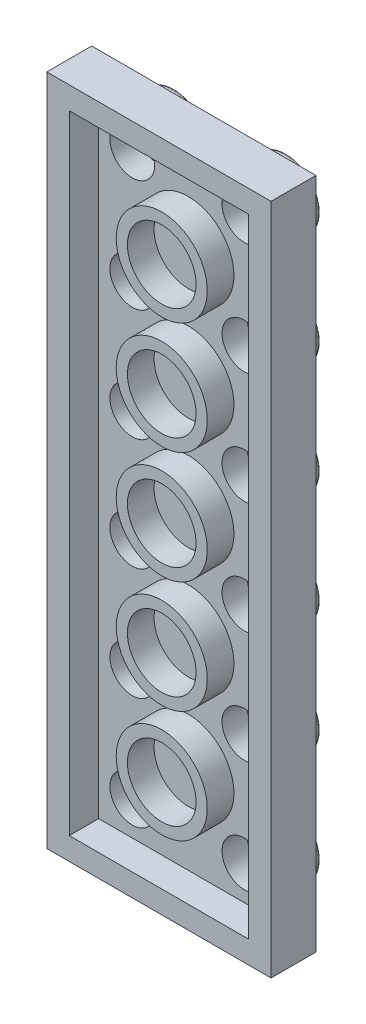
ISO-10303-21;
HEADER;
FILE_DESCRIPTION(('STEP AP214'),'2;1');
FILE_NAME('part.step','',(''),(''),'','','');
FILE_SCHEMA(('AUTOMOTIVE_DESIGN { 1 0 10303 214 1 1 1 1 }'));
ENDSEC;
DATA;
#1=APPLICATION_CONTEXT('core data for automotive mechanical design processes');
#2=APPLICATION_PROTOCOL_DEFINITION('international standard','automotive_design',2000,#1);
#3=PRODUCT_CONTEXT('',#1,'mechanical');
#4=PRODUCT('Part','Part','',(#3));
#5=PRODUCT_RELATED_PRODUCT_CATEGORY('part','',(#4));
#6=PRODUCT_DEFINITION_FORMATION('','',#4);
#7=PRODUCT_DEFINITION_CONTEXT('part definition',#1,'design');
#8=PRODUCT_DEFINITION('design','',#6,#7);
#9=PRODUCT_DEFINITION_SHAPE('','',#8);
#10=(LENGTH_UNIT() NAMED_UNIT(*) SI_UNIT(.MILLI.,.METRE.));
#11=(NAMED_UNIT(*) PLANE_ANGLE_UNIT() SI_UNIT($,.RADIAN.));
#12=(NAMED_UNIT(*) SI_UNIT($,.STERADIAN.) SOLID_ANGLE_UNIT());
#13=UNCERTAINTY_MEASURE_WITH_UNIT(LENGTH_MEASURE(1.E-05),#10,'distance_accuracy_value','');
#14=(GEOMETRIC_REPRESENTATION_CONTEXT(3) GLOBAL_UNCERTAINTY_ASSIGNED_CONTEXT((#13)) GLOBAL_UNIT_ASSIGNED_CONTEXT((#10,
#11,#12)) REPRESENTATION_CONTEXT('',''));
#15=CARTESIAN_POINT('',(0.,0.,0.));
#16=DIRECTION('',(0.,0.,1.));
#17=DIRECTION('',(1.,0.,0.));
#18=AXIS2_PLACEMENT_3D('',#15,#16,#17);
#19=CARTESIAN_POINT('',(0.,0.,0.));
#20=DIRECTION('',(0.,0.,-1.));
#21=DIRECTION('',(-1.,0.,0.));
#22=AXIS2_PLACEMENT_3D('',#19,#20,#21);
#23=PLANE('',#22);
#24=CARTESIAN_POINT('',(-12.,-36.,0.));
#25=DIRECTION('',(0.,0.,-1.));
#26=DIRECTION('',(-1.,0.,0.));
#27=AXIS2_PLACEMENT_3D('',#24,#25,#26);
#28=CIRCLE('',#27,2.45);
#29=CARTESIAN_POINT('',(-9.54999999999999,-36.,0.));
#30=VERTEX_POINT('',#29);
#31=EDGE_CURVE('E329',#30,#30,#28,.T.);
#32=ORIENTED_EDGE('',*,*,#31,.F.);
#33=EDGE_LOOP('',(#32));
#34=FACE_BOUND('',#33,.T.);
#35=CARTESIAN_POINT('',(-12.,-20.,0.));
#36=DIRECTION('',(0.,0.,-1.));
#37=DIRECTION('',(-1.,0.,0.));
#38=AXIS2_PLACEMENT_3D('',#35,#36,#37);
#39=CIRCLE('',#38,2.45);
#40=CARTESIAN_POINT('',(-9.54999999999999,-20.,0.));
#41=VERTEX_POINT('',#40);
#42=EDGE_CURVE('E340',#41,#41,#39,.T.);
#43=ORIENTED_EDGE('',*,*,#42,.F.);
#44=EDGE_LOOP('',(#43));
#45=FACE_BOUND('',#44,.T.);
#46=CARTESIAN_POINT('',(-12.,-4.,0.));
#47=DIRECTION('',(0.,0.,-1.));
#48=DIRECTION('',(-1.,0.,0.));
#49=AXIS2_PLACEMENT_3D('',#46,#47,#48);
#50=CIRCLE('',#49,2.45);
#51=CARTESIAN_POINT('',(-9.54999999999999,-4.,0.));
#52=VERTEX_POINT('',#51);
#53=EDGE_CURVE('E344',#52,#52,#50,.T.);
#54=ORIENTED_EDGE('',*,*,#53,.F.);
#55=EDGE_LOOP('',(#54));
#56=FACE_BOUND('',#55,.T.);
#57=CARTESIAN_POINT('',(-3.99999999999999,-36.,0.));
#58=DIRECTION('',(0.,0.,-1.));
#59=DIRECTION('',(-1.,0.,0.));
#60=AXIS2_PLACEMENT_3D('',#57,#58,#59);
#61=CIRCLE('',#60,2.45);
#62=CARTESIAN_POINT('',(-1.54999999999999,-36.,0.));
#63=VERTEX_POINT('',#62);
#64=EDGE_CURVE('E348',#63,#63,#61,.T.);
#65=ORIENTED_EDGE('',*,*,#64,.F.);
#66=EDGE_LOOP('',(#65));
#67=FACE_BOUND('',#66,.T.);
#68=CARTESIAN_POINT('',(-3.99999999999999,-20.,0.));
#69=DIRECTION('',(0.,0.,-1.));
#70=DIRECTION('',(-1.,0.,0.));
#71=AXIS2_PLACEMENT_3D('',#68,#69,#70);
#72=CIRCLE('',#71,2.45);
#73=CARTESIAN_POINT('',(-1.54999999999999,-20.,0.));
#74=VERTEX_POINT('',#73);
#75=EDGE_CURVE('E352',#74,#74,#72,.T.);
#76=ORIENTED_EDGE('',*,*,#75,.F.);
#77=EDGE_LOOP('',(#76));
#78=FACE_BOUND('',#77,.T.);
#79=CARTESIAN_POINT('',(-3.99999999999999,-4.,0.));
#80=DIRECTION('',(0.,0.,-1.));
#81=DIRECTION('',(-1.,0.,0.));
#82=AXIS2_PLACEMENT_3D('',#79,#80,#81);
#83=CIRCLE('',#82,2.45);
#84=CARTESIAN_POINT('',(-1.54999999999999,-4.,0.));
#85=VERTEX_POINT('',#84);
#86=EDGE_CURVE('E398',#85,#85,#83,.T.);
#87=ORIENTED_EDGE('',*,*,#86,.F.);
#88=EDGE_LOOP('',(#87));
#89=FACE_BOUND('',#88,.T.);
#90=DIRECTION('',(0.,1.,0.));
#91=VECTOR('',#90,1.);
#92=CARTESIAN_POINT('',(0.,0.,0.));
#93=LINE('',#92,#91);
#94=CARTESIAN_POINT('',(0.,-48.,0.));
#95=VERTEX_POINT('',#94);
#96=CARTESIAN_POINT('',(0.,0.,0.));
#97=VERTEX_POINT('',#96);
#98=EDGE_CURVE('E129',#95,#97,#93,.T.);
#99=ORIENTED_EDGE('',*,*,#98,.F.);
#100=DIRECTION('',(1.,0.,0.));
#101=VECTOR('',#100,1.);
#102=CARTESIAN_POINT('',(0.,-48.,0.));
#103=LINE('',#102,#101);
#104=CARTESIAN_POINT('',(-16.,-48.,0.));
#105=VERTEX_POINT('',#104);
#106=EDGE_CURVE('E138',#105,#95,#103,.T.);
#107=ORIENTED_EDGE('',*,*,#106,.F.);
#108=DIRECTION('',(0.,-1.,0.));
#109=VECTOR('',#108,1.);
#110=CARTESIAN_POINT('',(-16.,0.,0.));
#111=LINE('',#110,#109);
#112=CARTESIAN_POINT('',(-16.,0.,0.));
#113=VERTEX_POINT('',#112);
#114=EDGE_CURVE('E136',#113,#105,#111,.T.);
#115=ORIENTED_EDGE('',*,*,#114,.F.);
#116=DIRECTION('',(-1.,0.,0.));
#117=VECTOR('',#116,1.);
#118=CARTESIAN_POINT('',(0.,0.,0.));
#119=LINE('',#118,#117);
#120=EDGE_CURVE('E134',#97,#113,#119,.T.);
#121=ORIENTED_EDGE('',*,*,#120,.F.);
#122=EDGE_LOOP('',(#99,#107,#115,#121));
#123=FACE_BOUND('',#122,.T.);
#124=CARTESIAN_POINT('',(-3.99999999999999,-12.,0.));
#125=DIRECTION('',(0.,0.,-1.));
#126=DIRECTION('',(-1.,0.,0.));
#127=AXIS2_PLACEMENT_3D('',#124,#125,#126);
#128=CIRCLE('',#127,2.45);
#129=CARTESIAN_POINT('',(-1.54999999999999,-12.,0.));
#130=VERTEX_POINT('',#129);
#131=EDGE_CURVE('E308',#130,#130,#128,.T.);
#132=ORIENTED_EDGE('',*,*,#131,.F.);
#133=EDGE_LOOP('',(#132));
#134=FACE_BOUND('',#133,.T.);
#135=CARTESIAN_POINT('',(-3.99999999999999,-28.,0.));
#136=DIRECTION('',(0.,0.,-1.));
#137=DIRECTION('',(-1.,0.,0.));
#138=AXIS2_PLACEMENT_3D('',#135,#136,#137);
#139=CIRCLE('',#138,2.45);
#140=CARTESIAN_POINT('',(-1.54999999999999,-28.,0.));
#141=VERTEX_POINT('',#140);
#142=EDGE_CURVE('E312',#141,#141,#139,.T.);
#143=ORIENTED_EDGE('',*,*,#142,.F.);
#144=EDGE_LOOP('',(#143));
#145=FACE_BOUND('',#144,.T.);
#146=CARTESIAN_POINT('',(-3.99999999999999,-44.,0.));
#147=DIRECTION('',(0.,0.,-1.));
#148=DIRECTION('',(-1.,0.,0.));
#149=AXIS2_PLACEMENT_3D('',#146,#147,#148);
#150=CIRCLE('',#149,2.45);
#151=CARTESIAN_POINT('',(-1.54999999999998,-44.,0.));
#152=VERTEX_POINT('',#151);
#153=EDGE_CURVE('E316',#152,#152,#150,.T.);
#154=ORIENTED_EDGE('',*,*,#153,.F.);
#155=EDGE_LOOP('',(#154));
#156=FACE_BOUND('',#155,.T.);
#157=CARTESIAN_POINT('',(-12.,-12.,0.));
#158=DIRECTION('',(0.,0.,-1.));
#159=DIRECTION('',(-1.,0.,0.));
#160=AXIS2_PLACEMENT_3D('',#157,#158,#159);
#161=CIRCLE('',#160,2.45);
#162=CARTESIAN_POINT('',(-9.54999999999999,-12.,0.));
#163=VERTEX_POINT('',#162);
#164=EDGE_CURVE('E320',#163,#163,#161,.T.);
#165=ORIENTED_EDGE('',*,*,#164,.F.);
#166=EDGE_LOOP('',(#165));
#167=FACE_BOUND('',#166,.T.);
#168=CARTESIAN_POINT('',(-12.,-28.,0.));
#169=DIRECTION('',(0.,0.,-1.));
#170=DIRECTION('',(-1.,0.,0.));
#171=AXIS2_PLACEMENT_3D('',#168,#169,#170);
#172=CIRCLE('',#171,2.45);
#173=CARTESIAN_POINT('',(-9.54999999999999,-28.,0.));
#174=VERTEX_POINT('',#173);
#175=EDGE_CURVE('E324',#174,#174,#172,.T.);
#176=ORIENTED_EDGE('',*,*,#175,.F.);
#177=EDGE_LOOP('',(#176));
#178=FACE_BOUND('',#177,.T.);
#179=CARTESIAN_POINT('',(-12.,-44.,0.));
#180=DIRECTION('',(0.,0.,-1.));
#181=DIRECTION('',(-1.,0.,0.));
#182=AXIS2_PLACEMENT_3D('',#179,#180,#181);
#183=CIRCLE('',#182,2.45);
#184=CARTESIAN_POINT('',(-9.54999999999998,-44.,0.));
#185=VERTEX_POINT('',#184);
#186=EDGE_CURVE('E327',#185,#185,#183,.T.);
#187=ORIENTED_EDGE('',*,*,#186,.F.);
#188=EDGE_LOOP('',(#187));
#189=FACE_BOUND('',#188,.T.);
#190=ADVANCED_FACE('F26',(#34,#45,#56,#67,#78,#89,#123,#134,#145,#156,#167,#178,#189),#23,.T.);
#191=CARTESIAN_POINT('',(-1.59999999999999,-46.4,1.1));
#192=DIRECTION('',(0.,0.,1.));
#193=DIRECTION('',(1.,0.,0.));
#194=AXIS2_PLACEMENT_3D('',#191,#192,#193);
#195=PLANE('',#194);
#196=CARTESIAN_POINT('',(-12.,-44.,1.1));
#197=DIRECTION('',(0.,0.,1.));
#198=DIRECTION('',(1.,0.,0.));
#199=AXIS2_PLACEMENT_3D('',#196,#197,#198);
#200=CIRCLE('',#199,1.6);
#201=CARTESIAN_POINT('',(-10.4,-44.,1.1));
#202=VERTEX_POINT('',#201);
#203=EDGE_CURVE('E1054',#202,#202,#200,.T.);
#204=ORIENTED_EDGE('',*,*,#203,.F.);
#205=EDGE_LOOP('',(#204));
#206=FACE_BOUND('',#205,.T.);
#207=CARTESIAN_POINT('',(-12.,-36.,1.1));
#208=DIRECTION('',(0.,0.,1.));
#209=DIRECTION('',(1.,0.,0.));
#210=AXIS2_PLACEMENT_3D('',#207,#208,#209);
#211=CIRCLE('',#210,1.6);
#212=CARTESIAN_POINT('',(-10.4,-36.,1.1));
#213=VERTEX_POINT('',#212);
#214=EDGE_CURVE('E1053',#213,#213,#211,.T.);
#215=ORIENTED_EDGE('',*,*,#214,.F.);
#216=EDGE_LOOP('',(#215));
#217=FACE_BOUND('',#216,.T.);
#218=CARTESIAN_POINT('',(-12.,-28.,1.1));
#219=DIRECTION('',(0.,0.,1.));
#220=DIRECTION('',(1.,0.,0.));
#221=AXIS2_PLACEMENT_3D('',#218,#219,#220);
#222=CIRCLE('',#221,1.6);
#223=CARTESIAN_POINT('',(-10.4,-28.,1.1));
#224=VERTEX_POINT('',#223);
#225=EDGE_CURVE('E1064',#224,#224,#222,.T.);
#226=ORIENTED_EDGE('',*,*,#225,.F.);
#227=EDGE_LOOP('',(#226));
#228=FACE_BOUND('',#227,.T.);
#229=CARTESIAN_POINT('',(-12.,-20.,1.1));
#230=DIRECTION('',(0.,0.,1.));
#231=DIRECTION('',(1.,0.,0.));
#232=AXIS2_PLACEMENT_3D('',#229,#230,#231);
#233=CIRCLE('',#232,1.6);
#234=CARTESIAN_POINT('',(-10.4,-20.,1.1));
#235=VERTEX_POINT('',#234);
#236=EDGE_CURVE('E1070',#235,#235,#233,.T.);
#237=ORIENTED_EDGE('',*,*,#236,.F.);
#238=EDGE_LOOP('',(#237));
#239=FACE_BOUND('',#238,.T.);
#240=CARTESIAN_POINT('',(-12.,-12.,1.1));
#241=DIRECTION('',(0.,0.,1.));
#242=DIRECTION('',(1.,0.,0.));
#243=AXIS2_PLACEMENT_3D('',#240,#241,#242);
#244=CIRCLE('',#243,1.6);
#245=CARTESIAN_POINT('',(-10.4,-12.,1.1));
#246=VERTEX_POINT('',#245);
#247=EDGE_CURVE('E1076',#246,#246,#244,.T.);
#248=ORIENTED_EDGE('',*,*,#247,.F.);
#249=EDGE_LOOP('',(#248));
#250=FACE_BOUND('',#249,.T.);
#251=CARTESIAN_POINT('',(-12.,-4.,1.1));
#252=DIRECTION('',(0.,0.,1.));
#253=DIRECTION('',(1.,0.,0.));
#254=AXIS2_PLACEMENT_3D('',#251,#252,#253);
#255=CIRCLE('',#254,1.6);
#256=CARTESIAN_POINT('',(-10.4,-4.,1.1));
#257=VERTEX_POINT('',#256);
#258=EDGE_CURVE('E1082',#257,#257,#255,.T.);
#259=ORIENTED_EDGE('',*,*,#258,.F.);
#260=EDGE_LOOP('',(#259));
#261=FACE_BOUND('',#260,.T.);
#262=CARTESIAN_POINT('',(-3.99999999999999,-44.,1.1));
#263=DIRECTION('',(0.,0.,1.));
#264=DIRECTION('',(1.,0.,0.));
#265=AXIS2_PLACEMENT_3D('',#262,#263,#264);
#266=CIRCLE('',#265,1.6);
#267=CARTESIAN_POINT('',(-2.4,-44.,1.1));
#268=VERTEX_POINT('',#267);
#269=EDGE_CURVE('E1088',#268,#268,#266,.T.);
#270=ORIENTED_EDGE('',*,*,#269,.F.);
#271=EDGE_LOOP('',(#270));
#272=FACE_BOUND('',#271,.T.);
#273=CARTESIAN_POINT('',(-4.,-36.,1.1));
#274=DIRECTION('',(0.,0.,1.));
#275=DIRECTION('',(1.,0.,0.));
#276=AXIS2_PLACEMENT_3D('',#273,#274,#275);
#277=CIRCLE('',#276,1.6);
#278=CARTESIAN_POINT('',(-2.4,-36.,1.1));
#279=VERTEX_POINT('',#278);
#280=EDGE_CURVE('E1094',#279,#279,#277,.T.);
#281=ORIENTED_EDGE('',*,*,#280,.F.);
#282=EDGE_LOOP('',(#281));
#283=FACE_BOUND('',#282,.T.);
#284=CARTESIAN_POINT('',(-4.,-28.,1.1));
#285=DIRECTION('',(0.,0.,1.));
#286=DIRECTION('',(1.,0.,0.));
#287=AXIS2_PLACEMENT_3D('',#284,#285,#286);
#288=CIRCLE('',#287,1.6);
#289=CARTESIAN_POINT('',(-2.4,-28.,1.1));
#290=VERTEX_POINT('',#289);
#291=EDGE_CURVE('E1100',#290,#290,#288,.T.);
#292=ORIENTED_EDGE('',*,*,#291,.F.);
#293=EDGE_LOOP('',(#292));
#294=FACE_BOUND('',#293,.T.);
#295=CARTESIAN_POINT('',(-4.,-20.,1.1));
#296=DIRECTION('',(0.,0.,1.));
#297=DIRECTION('',(1.,0.,0.));
#298=AXIS2_PLACEMENT_3D('',#295,#296,#297);
#299=CIRCLE('',#298,1.6);
#300=CARTESIAN_POINT('',(-2.4,-20.,1.1));
#301=VERTEX_POINT('',#300);
#302=EDGE_CURVE('E1106',#301,#301,#299,.T.);
#303=ORIENTED_EDGE('',*,*,#302,.F.);
#304=EDGE_LOOP('',(#303));
#305=FACE_BOUND('',#304,.T.);
#306=CARTESIAN_POINT('',(-4.,-12.,1.1));
#307=DIRECTION('',(0.,0.,1.));
#308=DIRECTION('',(1.,0.,0.));
#309=AXIS2_PLACEMENT_3D('',#306,#307,#308);
#310=CIRCLE('',#309,1.6);
#311=CARTESIAN_POINT('',(-2.4,-12.,1.1));
#312=VERTEX_POINT('',#311);
#313=EDGE_CURVE('E335',#312,#312,#310,.T.);
#314=ORIENTED_EDGE('',*,*,#313,.F.);
#315=EDGE_LOOP('',(#314));
#316=FACE_BOUND('',#315,.T.);
#317=CARTESIAN_POINT('',(-4.,-4.,1.1));
#318=DIRECTION('',(0.,0.,1.));
#319=DIRECTION('',(1.,0.,0.));
#320=AXIS2_PLACEMENT_3D('',#317,#318,#319);
#321=CIRCLE('',#320,1.6);
#322=CARTESIAN_POINT('',(-2.4,-4.,1.1));
#323=VERTEX_POINT('',#322);
#324=EDGE_CURVE('E356',#323,#323,#321,.T.);
#325=ORIENTED_EDGE('',*,*,#324,.F.);
#326=EDGE_LOOP('',(#325));
#327=FACE_BOUND('',#326,.T.);
#328=DIRECTION('',(0.,1.,0.));
#329=VECTOR('',#328,1.);
#330=CARTESIAN_POINT('',(-1.59999999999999,-46.4,1.1));
#331=LINE('',#330,#329);
#332=CARTESIAN_POINT('',(-1.59999999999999,-46.4,1.1));
#333=VERTEX_POINT('',#332);
#334=CARTESIAN_POINT('',(-1.59999999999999,-1.6,1.1));
#335=VERTEX_POINT('',#334);
#336=EDGE_CURVE('E115',#333,#335,#331,.T.);
#337=ORIENTED_EDGE('',*,*,#336,.T.);
#338=DIRECTION('',(-1.,0.,0.));
#339=VECTOR('',#338,1.);
#340=CARTESIAN_POINT('',(-1.59999999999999,-1.6,1.1));
#341=LINE('',#340,#339);
#342=CARTESIAN_POINT('',(-14.4,-1.6,1.1));
#343=VERTEX_POINT('',#342);
#344=EDGE_CURVE('E121',#335,#343,#341,.T.);
#345=ORIENTED_EDGE('',*,*,#344,.T.);
#346=DIRECTION('',(0.,-1.,0.));
#347=VECTOR('',#346,1.);
#348=CARTESIAN_POINT('',(-14.4,-46.4,1.1));
#349=LINE('',#348,#347);
#350=CARTESIAN_POINT('',(-14.4,-46.4,1.1));
#351=VERTEX_POINT('',#350);
#352=EDGE_CURVE('E99',#343,#351,#349,.T.);
#353=ORIENTED_EDGE('',*,*,#352,.T.);
#354=DIRECTION('',(1.,0.,0.));
#355=VECTOR('',#354,1.);
#356=CARTESIAN_POINT('',(-1.59999999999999,-46.4,1.1));
#357=LINE('',#356,#355);
#358=EDGE_CURVE('E124',#351,#333,#357,.T.);
#359=ORIENTED_EDGE('',*,*,#358,.T.);
#360=EDGE_LOOP('',(#337,#345,#353,#359));
#361=FACE_BOUND('',#360,.T.);
#362=CARTESIAN_POINT('',(-7.99999999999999,-8.,1.1));
#363=DIRECTION('',(0.,0.,1.));
#364=DIRECTION('',(1.,0.,0.));
#365=AXIS2_PLACEMENT_3D('',#362,#363,#364);
#366=CIRCLE('',#365,3.25);
#367=CARTESIAN_POINT('',(-11.25,-8.,1.1));
#368=VERTEX_POINT('',#367);
#369=EDGE_CURVE('E404',#368,#368,#366,.T.);
#370=ORIENTED_EDGE('',*,*,#369,.F.);
#371=EDGE_LOOP('',(#370));
#372=FACE_BOUND('',#371,.T.);
#373=CARTESIAN_POINT('',(-7.99999999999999,-16.,1.1));
#374=DIRECTION('',(0.,0.,1.));
#375=DIRECTION('',(1.,0.,0.));
#376=AXIS2_PLACEMENT_3D('',#373,#374,#375);
#377=CIRCLE('',#376,3.25);
#378=CARTESIAN_POINT('',(-11.25,-16.,1.1));
#379=VERTEX_POINT('',#378);
#380=EDGE_CURVE('E392',#379,#379,#377,.T.);
#381=ORIENTED_EDGE('',*,*,#380,.F.);
#382=EDGE_LOOP('',(#381));
#383=FACE_BOUND('',#382,.T.);
#384=CARTESIAN_POINT('',(-7.99999999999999,-24.,1.1));
#385=DIRECTION('',(0.,0.,1.));
#386=DIRECTION('',(1.,0.,0.));
#387=AXIS2_PLACEMENT_3D('',#384,#385,#386);
#388=CIRCLE('',#387,3.25);
#389=CARTESIAN_POINT('',(-11.25,-24.,1.1));
#390=VERTEX_POINT('',#389);
#391=EDGE_CURVE('E383',#390,#390,#388,.T.);
#392=ORIENTED_EDGE('',*,*,#391,.F.);
#393=EDGE_LOOP('',(#392));
#394=FACE_BOUND('',#393,.T.);
#395=CARTESIAN_POINT('',(-7.99999999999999,-32.,1.1));
#396=DIRECTION('',(0.,0.,1.));
#397=DIRECTION('',(1.,0.,0.));
#398=AXIS2_PLACEMENT_3D('',#395,#396,#397);
#399=CIRCLE('',#398,3.25);
#400=CARTESIAN_POINT('',(-11.25,-32.,1.1));
#401=VERTEX_POINT('',#400);
#402=EDGE_CURVE('E374',#401,#401,#399,.T.);
#403=ORIENTED_EDGE('',*,*,#402,.F.);
#404=EDGE_LOOP('',(#403));
#405=FACE_BOUND('',#404,.T.);
#406=CARTESIAN_POINT('',(-7.99999999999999,-40.,1.1));
#407=DIRECTION('',(0.,0.,1.));
#408=DIRECTION('',(1.,0.,0.));
#409=AXIS2_PLACEMENT_3D('',#406,#407,#408);
#410=CIRCLE('',#409,3.25);
#411=CARTESIAN_POINT('',(-11.25,-40.,1.1));
#412=VERTEX_POINT('',#411);
#413=EDGE_CURVE('E365',#412,#412,#410,.T.);
#414=ORIENTED_EDGE('',*,*,#413,.F.);
#415=EDGE_LOOP('',(#414));
#416=FACE_BOUND('',#415,.T.);
#417=ADVANCED_FACE('F262',(#206,#217,#228,#239,#250,#261,#272,#283,#294,#305,#316,#327,#361,
#372,#383,#394,#405,#416),#195,.T.);
#418=CARTESIAN_POINT('',(0.,0.,3.2));
#419=DIRECTION('',(-1.,0.,0.));
#420=DIRECTION('',(0.,-1.,0.));
#421=AXIS2_PLACEMENT_3D('',#418,#419,#420);
#422=PLANE('',#421);
#423=ORIENTED_EDGE('',*,*,#98,.T.);
#424=DIRECTION('',(0.,0.,-1.));
#425=VECTOR('',#424,1.);
#426=CARTESIAN_POINT('',(0.,0.,3.2));
#427=LINE('',#426,#425);
#428=CARTESIAN_POINT('',(0.,0.,3.2));
#429=VERTEX_POINT('',#428);
#430=EDGE_CURVE('E156',#429,#97,#427,.T.);
#431=ORIENTED_EDGE('',*,*,#430,.F.);
#432=DIRECTION('',(0.,1.,0.));
#433=VECTOR('',#432,1.);
#434=CARTESIAN_POINT('',(0.,0.,3.2));
#435=LINE('',#434,#433);
#436=CARTESIAN_POINT('',(0.,-48.,3.2));
#437=VERTEX_POINT('',#436);
#438=EDGE_CURVE('E140',#437,#429,#435,.T.);
#439=ORIENTED_EDGE('',*,*,#438,.F.);
#440=DIRECTION('',(0.,0.,-1.));
#441=VECTOR('',#440,1.);
#442=CARTESIAN_POINT('',(0.,-48.,3.2));
#443=LINE('',#442,#441);
#444=EDGE_CURVE('E147',#437,#95,#443,.T.);
#445=ORIENTED_EDGE('',*,*,#444,.T.);
#446=EDGE_LOOP('',(#423,#431,#439,#445));
#447=FACE_BOUND('',#446,.T.);
#448=ADVANCED_FACE('F28',(#447),#422,.F.);
#449=CARTESIAN_POINT('',(0.,0.,3.2));
#450=DIRECTION('',(0.,-1.,0.));
#451=DIRECTION('',(1.,0.,0.));
#452=AXIS2_PLACEMENT_3D('',#449,#450,#451);
#453=PLANE('',#452);
#454=ORIENTED_EDGE('',*,*,#120,.T.);
#455=DIRECTION('',(0.,0.,-1.));
#456=VECTOR('',#455,1.);
#457=CARTESIAN_POINT('',(-16.,0.,3.2));
#458=LINE('',#457,#456);
#459=CARTESIAN_POINT('',(-16.,0.,3.2));
#460=VERTEX_POINT('',#459);
#461=EDGE_CURVE('E153',#460,#113,#458,.T.);
#462=ORIENTED_EDGE('',*,*,#461,.F.);
#463=DIRECTION('',(-1.,0.,0.));
#464=VECTOR('',#463,1.);
#465=CARTESIAN_POINT('',(0.,0.,3.2));
#466=LINE('',#465,#464);
#467=EDGE_CURVE('E142',#429,#460,#466,.T.);
#468=ORIENTED_EDGE('',*,*,#467,.F.);
#469=ORIENTED_EDGE('',*,*,#430,.T.);
#470=EDGE_LOOP('',(#454,#462,#468,#469));
#471=FACE_BOUND('',#470,.T.);
#472=ADVANCED_FACE('F287',(#471),#453,.F.);
#473=CARTESIAN_POINT('',(-16.,0.,3.2));
#474=DIRECTION('',(1.,0.,0.));
#475=DIRECTION('',(0.,1.,0.));
#476=AXIS2_PLACEMENT_3D('',#473,#474,#475);
#477=PLANE('',#476);
#478=ORIENTED_EDGE('',*,*,#114,.T.);
#479=DIRECTION('',(0.,0.,-1.));
#480=VECTOR('',#479,1.);
#481=CARTESIAN_POINT('',(-16.,-48.,3.2));
#482=LINE('',#481,#480);
#483=CARTESIAN_POINT('',(-16.,-48.,3.2));
#484=VERTEX_POINT('',#483);
#485=EDGE_CURVE('E150',#484,#105,#482,.T.);
#486=ORIENTED_EDGE('',*,*,#485,.F.);
#487=DIRECTION('',(0.,-1.,0.));
#488=VECTOR('',#487,1.);
#489=CARTESIAN_POINT('',(-16.,0.,3.2));
#490=LINE('',#489,#488);
#491=EDGE_CURVE('E144',#460,#484,#490,.T.);
#492=ORIENTED_EDGE('',*,*,#491,.F.);
#493=ORIENTED_EDGE('',*,*,#461,.T.);
#494=EDGE_LOOP('',(#478,#486,#492,#493));
#495=FACE_BOUND('',#494,.T.);
#496=ADVANCED_FACE('F284',(#495),#477,.F.);
#497=CARTESIAN_POINT('',(0.,-48.,3.2));
#498=DIRECTION('',(0.,1.,0.));
#499=DIRECTION('',(0.,0.,1.));
#500=AXIS2_PLACEMENT_3D('',#497,#498,#499);
#501=PLANE('',#500);
#502=ORIENTED_EDGE('',*,*,#106,.T.);
#503=ORIENTED_EDGE('',*,*,#444,.F.);
#504=DIRECTION('',(1.,0.,0.));
#505=VECTOR('',#504,1.);
#506=CARTESIAN_POINT('',(0.,-48.,3.2));
#507=LINE('',#506,#505);
#508=EDGE_CURVE('E49',#484,#437,#507,.T.);
#509=ORIENTED_EDGE('',*,*,#508,.F.);
#510=ORIENTED_EDGE('',*,*,#485,.T.);
#511=EDGE_LOOP('',(#502,#503,#509,#510));
#512=FACE_BOUND('',#511,.T.);
#513=ADVANCED_FACE('F281',(#512),#501,.F.);
#514=CARTESIAN_POINT('',(0.,0.,3.2));
#515=DIRECTION('',(0.,0.,-1.));
#516=DIRECTION('',(-1.,0.,0.));
#517=AXIS2_PLACEMENT_3D('',#514,#515,#516);
#518=PLANE('',#517);
#519=DIRECTION('',(-1.,0.,0.));
#520=VECTOR('',#519,1.);
#521=CARTESIAN_POINT('',(-1.59999999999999,-1.6,3.2));
#522=LINE('',#521,#520);
#523=CARTESIAN_POINT('',(-1.59999999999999,-1.6,3.2));
#524=VERTEX_POINT('',#523);
#525=CARTESIAN_POINT('',(-14.4,-1.6,3.2));
#526=VERTEX_POINT('',#525);
#527=EDGE_CURVE('E107',#524,#526,#522,.T.);
#528=ORIENTED_EDGE('',*,*,#527,.F.);
#529=DIRECTION('',(0.,1.,0.));
#530=VECTOR('',#529,1.);
#531=CARTESIAN_POINT('',(-1.59999999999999,-46.4,3.2));
#532=LINE('',#531,#530);
#533=CARTESIAN_POINT('',(-1.59999999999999,-46.4,3.2));
#534=VERTEX_POINT('',#533);
#535=EDGE_CURVE('E41',#534,#524,#532,.T.);
#536=ORIENTED_EDGE('',*,*,#535,.F.);
#537=DIRECTION('',(1.,0.,0.));
#538=VECTOR('',#537,1.);
#539=CARTESIAN_POINT('',(-1.59999999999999,-46.4,3.2));
#540=LINE('',#539,#538);
#541=CARTESIAN_POINT('',(-14.4,-46.4,3.2));
#542=VERTEX_POINT('',#541);
#543=EDGE_CURVE('E113',#542,#534,#540,.T.);
#544=ORIENTED_EDGE('',*,*,#543,.F.);
#545=DIRECTION('',(0.,-1.,0.));
#546=VECTOR('',#545,1.);
#547=CARTESIAN_POINT('',(-14.4,-46.4,3.2));
#548=LINE('',#547,#546);
#549=EDGE_CURVE('E96',#526,#542,#548,.T.);
#550=ORIENTED_EDGE('',*,*,#549,.F.);
#551=EDGE_LOOP('',(#528,#536,#544,#550));
#552=FACE_BOUND('',#551,.T.);
#553=ORIENTED_EDGE('',*,*,#438,.T.);
#554=ORIENTED_EDGE('',*,*,#467,.T.);
#555=ORIENTED_EDGE('',*,*,#491,.T.);
#556=ORIENTED_EDGE('',*,*,#508,.T.);
#557=EDGE_LOOP('',(#553,#554,#555,#556));
#558=FACE_BOUND('',#557,.T.);
#559=ADVANCED_FACE('F111',(#552,#558),#518,.F.);
#560=CARTESIAN_POINT('',(-1.59999999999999,-46.4,1.1));
#561=DIRECTION('',(1.,0.,0.));
#562=DIRECTION('',(0.,1.,0.));
#563=AXIS2_PLACEMENT_3D('',#560,#561,#562);
#564=PLANE('',#563);
#565=ORIENTED_EDGE('',*,*,#535,.T.);
#566=DIRECTION('',(0.,0.,1.));
#567=VECTOR('',#566,1.);
#568=CARTESIAN_POINT('',(-1.59999999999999,-1.6,1.1));
#569=LINE('',#568,#567);
#570=EDGE_CURVE('E104',#335,#524,#569,.T.);
#571=ORIENTED_EDGE('',*,*,#570,.F.);
#572=ORIENTED_EDGE('',*,*,#336,.F.);
#573=DIRECTION('',(0.,0.,1.));
#574=VECTOR('',#573,1.);
#575=CARTESIAN_POINT('',(-1.59999999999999,-46.4,1.1));
#576=LINE('',#575,#574);
#577=EDGE_CURVE('E127',#333,#534,#576,.T.);
#578=ORIENTED_EDGE('',*,*,#577,.T.);
#579=EDGE_LOOP('',(#565,#571,#572,#578));
#580=FACE_BOUND('',#579,.T.);
#581=ADVANCED_FACE('F277',(#580),#564,.F.);
#582=CARTESIAN_POINT('',(-1.59999999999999,-46.4,1.1));
#583=DIRECTION('',(0.,-1.,0.));
#584=DIRECTION('',(0.,0.,-1.));
#585=AXIS2_PLACEMENT_3D('',#582,#583,#584);
#586=PLANE('',#585);
#587=ORIENTED_EDGE('',*,*,#543,.T.);
#588=ORIENTED_EDGE('',*,*,#577,.F.);
#589=ORIENTED_EDGE('',*,*,#358,.F.);
#590=DIRECTION('',(0.,0.,1.));
#591=VECTOR('',#590,1.);
#592=CARTESIAN_POINT('',(-14.4,-46.4,1.1));
#593=LINE('',#592,#591);
#594=EDGE_CURVE('E103',#351,#542,#593,.T.);
#595=ORIENTED_EDGE('',*,*,#594,.T.);
#596=EDGE_LOOP('',(#587,#588,#589,#595));
#597=FACE_BOUND('',#596,.T.);
#598=ADVANCED_FACE('F504',(#597),#586,.F.);
#599=CARTESIAN_POINT('',(-14.4,-46.4,1.1));
#600=DIRECTION('',(-1.,0.,0.));
#601=DIRECTION('',(0.,-1.,0.));
#602=AXIS2_PLACEMENT_3D('',#599,#600,#601);
#603=PLANE('',#602);
#604=ORIENTED_EDGE('',*,*,#549,.T.);
#605=ORIENTED_EDGE('',*,*,#594,.F.);
#606=ORIENTED_EDGE('',*,*,#352,.F.);
#607=DIRECTION('',(0.,0.,1.));
#608=VECTOR('',#607,1.);
#609=CARTESIAN_POINT('',(-14.4,-1.6,1.1));
#610=LINE('',#609,#608);
#611=EDGE_CURVE('E92',#343,#526,#610,.T.);
#612=ORIENTED_EDGE('',*,*,#611,.T.);
#613=EDGE_LOOP('',(#604,#605,#606,#612));
#614=FACE_BOUND('',#613,.T.);
#615=ADVANCED_FACE('F94',(#614),#603,.F.);
#616=CARTESIAN_POINT('',(-1.59999999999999,-1.6,1.1));
#617=DIRECTION('',(0.,1.,0.));
#618=DIRECTION('',(-1.,0.,0.));
#619=AXIS2_PLACEMENT_3D('',#616,#617,#618);
#620=PLANE('',#619);
#621=ORIENTED_EDGE('',*,*,#527,.T.);
#622=ORIENTED_EDGE('',*,*,#611,.F.);
#623=ORIENTED_EDGE('',*,*,#344,.F.);
#624=ORIENTED_EDGE('',*,*,#570,.T.);
#625=EDGE_LOOP('',(#621,#622,#623,#624));
#626=FACE_BOUND('',#625,.T.);
#627=ADVANCED_FACE('F108',(#626),#620,.F.);
#628=CARTESIAN_POINT('',(-7.99999999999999,-8.,3.));
#629=DIRECTION('',(0.,0.,1.));
#630=DIRECTION('',(1.,0.,0.));
#631=AXIS2_PLACEMENT_3D('',#628,#629,#630);
#632=PLANE('',#631);
#633=CARTESIAN_POINT('',(-7.99999999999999,-8.,3.));
#634=DIRECTION('',(0.,0.,1.));
#635=DIRECTION('',(1.,0.,0.));
#636=AXIS2_PLACEMENT_3D('',#633,#634,#635);
#637=CIRCLE('',#636,3.25);
#638=CARTESIAN_POINT('',(-11.25,-8.,3.));
#639=VERTEX_POINT('',#638);
#640=EDGE_CURVE('E407',#639,#639,#637,.T.);
#641=ORIENTED_EDGE('',*,*,#640,.T.);
#642=EDGE_LOOP('',(#641));
#643=FACE_BOUND('',#642,.T.);
#644=CARTESIAN_POINT('',(-7.99999999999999,-8.,3.));
#645=DIRECTION('',(0.,0.,1.));
#646=DIRECTION('',(1.,0.,0.));
#647=AXIS2_PLACEMENT_3D('',#644,#645,#646);
#648=CIRCLE('',#647,2.45);
#649=CARTESIAN_POINT('',(-10.45,-8.,3.));
#650=VERTEX_POINT('',#649);
#651=EDGE_CURVE('E401',#650,#650,#648,.T.);
#652=ORIENTED_EDGE('',*,*,#651,.F.);
#653=EDGE_LOOP('',(#652));
#654=FACE_BOUND('',#653,.T.);
#655=ADVANCED_FACE('F411',(#643,#654),#632,.T.);
#656=CARTESIAN_POINT('',(-7.99999999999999,-8.,3.));
#657=DIRECTION('',(0.,0.,-1.));
#658=DIRECTION('',(-1.,0.,0.));
#659=AXIS2_PLACEMENT_3D('',#656,#657,#658);
#660=CYLINDRICAL_SURFACE('',#659,3.25);
#661=CARTESIAN_POINT('',(-11.25,-8.,3.));
#662=CARTESIAN_POINT('',(-11.25,-8.,2.98020833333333));
#663=CARTESIAN_POINT('',(-11.25,-8.,2.96041666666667));
#664=CARTESIAN_POINT('',(-11.25,-8.,2.92083333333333));
#665=CARTESIAN_POINT('',(-11.25,-8.,2.90104166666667));
#666=CARTESIAN_POINT('',(-11.25,-8.,2.86145833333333));
#667=CARTESIAN_POINT('',(-11.25,-8.,2.84166666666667));
#668=CARTESIAN_POINT('',(-11.25,-8.,2.80208333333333));
#669=CARTESIAN_POINT('',(-11.25,-8.,2.78229166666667));
#670=CARTESIAN_POINT('',(-11.25,-8.,2.74270833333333));
#671=CARTESIAN_POINT('',(-11.25,-8.,2.72291666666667));
#672=CARTESIAN_POINT('',(-11.25,-8.,2.68333333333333));
#673=CARTESIAN_POINT('',(-11.25,-8.,2.66354166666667));
#674=CARTESIAN_POINT('',(-11.25,-8.,2.62395833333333));
#675=CARTESIAN_POINT('',(-11.25,-8.,2.60416666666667));
#676=CARTESIAN_POINT('',(-11.25,-8.,2.56458333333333));
#677=CARTESIAN_POINT('',(-11.25,-8.,2.54479166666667));
#678=CARTESIAN_POINT('',(-11.25,-8.,2.50520833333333));
#679=CARTESIAN_POINT('',(-11.25,-8.,2.48541666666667));
#680=CARTESIAN_POINT('',(-11.25,-8.,2.44583333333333));
#681=CARTESIAN_POINT('',(-11.25,-8.,2.42604166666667));
#682=CARTESIAN_POINT('',(-11.25,-8.,2.38645833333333));
#683=CARTESIAN_POINT('',(-11.25,-8.,2.36666666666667));
#684=CARTESIAN_POINT('',(-11.25,-8.,2.32708333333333));
#685=CARTESIAN_POINT('',(-11.25,-8.,2.30729166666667));
#686=CARTESIAN_POINT('',(-11.25,-8.,2.26770833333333));
#687=CARTESIAN_POINT('',(-11.25,-8.,2.24791666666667));
#688=CARTESIAN_POINT('',(-11.25,-8.,2.20833333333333));
#689=CARTESIAN_POINT('',(-11.25,-8.,2.18854166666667));
#690=CARTESIAN_POINT('',(-11.25,-8.,2.14895833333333));
#691=CARTESIAN_POINT('',(-11.25,-8.,2.12916666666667));
#692=CARTESIAN_POINT('',(-11.25,-8.,2.08958333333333));
#693=CARTESIAN_POINT('',(-11.25,-8.,2.06979166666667));
#694=CARTESIAN_POINT('',(-11.25,-8.,2.03020833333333));
#695=CARTESIAN_POINT('',(-11.25,-8.,2.01041666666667));
#696=CARTESIAN_POINT('',(-11.25,-8.,1.97083333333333));
#697=CARTESIAN_POINT('',(-11.25,-8.,1.95104166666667));
#698=CARTESIAN_POINT('',(-11.25,-8.,1.91145833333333));
#699=CARTESIAN_POINT('',(-11.25,-8.,1.89166666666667));
#700=CARTESIAN_POINT('',(-11.25,-8.,1.85208333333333));
#701=CARTESIAN_POINT('',(-11.25,-8.,1.83229166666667));
#702=CARTESIAN_POINT('',(-11.25,-8.,1.79270833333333));
#703=CARTESIAN_POINT('',(-11.25,-8.,1.77291666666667));
#704=CARTESIAN_POINT('',(-11.25,-8.,1.73333333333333));
#705=CARTESIAN_POINT('',(-11.25,-8.,1.71354166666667));
#706=CARTESIAN_POINT('',(-11.25,-8.,1.67395833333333));
#707=CARTESIAN_POINT('',(-11.25,-8.,1.65416666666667));
#708=CARTESIAN_POINT('',(-11.25,-8.,1.61458333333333));
#709=CARTESIAN_POINT('',(-11.25,-8.,1.59479166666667));
#710=CARTESIAN_POINT('',(-11.25,-8.,1.55520833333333));
#711=CARTESIAN_POINT('',(-11.25,-8.,1.53541666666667));
#712=CARTESIAN_POINT('',(-11.25,-8.,1.49583333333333));
#713=CARTESIAN_POINT('',(-11.25,-8.,1.47604166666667));
#714=CARTESIAN_POINT('',(-11.25,-8.,1.43645833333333));
#715=CARTESIAN_POINT('',(-11.25,-8.,1.41666666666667));
#716=CARTESIAN_POINT('',(-11.25,-8.,1.37708333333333));
#717=CARTESIAN_POINT('',(-11.25,-8.,1.35729166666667));
#718=CARTESIAN_POINT('',(-11.25,-8.,1.31770833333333));
#719=CARTESIAN_POINT('',(-11.25,-8.,1.29791666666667));
#720=CARTESIAN_POINT('',(-11.25,-8.,1.25833333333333));
#721=CARTESIAN_POINT('',(-11.25,-8.,1.23854166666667));
#722=CARTESIAN_POINT('',(-11.25,-8.,1.19895833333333));
#723=CARTESIAN_POINT('',(-11.25,-8.,1.17916666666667));
#724=CARTESIAN_POINT('',(-11.25,-8.,1.13958333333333));
#725=CARTESIAN_POINT('',(-11.25,-8.,1.11979166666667));
#726=CARTESIAN_POINT('',(-11.25,-8.,1.1));
#727=B_SPLINE_CURVE_WITH_KNOTS('',3,(#661,#662,#663,#664,#665,#666,#667,#668,#669,#670,#671,
#672,#673,#674,#675,#676,#677,#678,#679,#680,#681,#682,#683,#684,#685,#686,#687,#688,#689,#690,
#691,#692,#693,#694,#695,#696,#697,#698,#699,#700,#701,#702,#703,#704,#705,#706,#707,#708,#709,
#710,#711,#712,#713,#714,#715,#716,#717,#718,#719,#720,#721,#722,#723,#724,#725,#726),
.UNSPECIFIED.,.F.,.F.,(4,2,2,2,2,2,2,2,2,2,2,2,2,2,2,2,2,2,2,2,2,2,2,2,2,2,2,2,2,2,2,2,4),(0.,
0.059375,0.11875,0.178125,0.2375,0.296875,0.35625,0.415625,0.475,0.534375,0.59375,0.653125,
0.7125,0.771875,0.83125,0.890625,0.95,1.009375,1.06875,1.128125,1.1875,1.246875,1.30625,
1.365625,1.425,1.484375,1.54375,1.603125,1.6625,1.721875,1.78125,1.840625,1.9),.UNSPECIFIED.);
#728=EDGE_CURVE('BSEAM414',#639,#368,#727,.T.);
#729=ORIENTED_EDGE('',*,*,#640,.F.);
#730=ORIENTED_EDGE('',*,*,#369,.T.);
#731=ORIENTED_EDGE('',*,*,#728,.T.);
#732=ORIENTED_EDGE('',*,*,#728,.F.);
#733=EDGE_LOOP('',(#729,#731,#730,#732));
#734=FACE_BOUND('',#733,.T.);
#735=ADVANCED_FACE('F414',(#734),#660,.T.);
#736=CARTESIAN_POINT('',(-7.99999999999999,-8.,3.));
#737=DIRECTION('',(0.,0.,-1.));
#738=DIRECTION('',(-1.,0.,0.));
#739=AXIS2_PLACEMENT_3D('',#736,#737,#738);
#740=CYLINDRICAL_SURFACE('',#739,2.45);
#741=CARTESIAN_POINT('',(-7.99999999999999,-8.,1.1));
#742=DIRECTION('',(0.,0.,1.));
#743=DIRECTION('',(1.,0.,0.));
#744=AXIS2_PLACEMENT_3D('',#741,#742,#743);
#745=CIRCLE('',#744,2.45);
#746=CARTESIAN_POINT('',(-10.45,-8.,1.1));
#747=VERTEX_POINT('',#746);
#748=EDGE_CURVE('E159',#747,#747,#745,.F.);
#749=CARTESIAN_POINT('',(-10.45,-8.,3.));
#750=CARTESIAN_POINT('',(-10.45,-8.,2.98020833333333));
#751=CARTESIAN_POINT('',(-10.45,-8.,2.96041666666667));
#752=CARTESIAN_POINT('',(-10.45,-8.,2.92083333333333));
#753=CARTESIAN_POINT('',(-10.45,-8.,2.90104166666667));
#754=CARTESIAN_POINT('',(-10.45,-8.,2.86145833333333));
#755=CARTESIAN_POINT('',(-10.45,-8.,2.84166666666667));
#756=CARTESIAN_POINT('',(-10.45,-8.,2.80208333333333));
#757=CARTESIAN_POINT('',(-10.45,-8.,2.78229166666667));
#758=CARTESIAN_POINT('',(-10.45,-8.,2.74270833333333));
#759=CARTESIAN_POINT('',(-10.45,-8.,2.72291666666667));
#760=CARTESIAN_POINT('',(-10.45,-8.,2.68333333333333));
#761=CARTESIAN_POINT('',(-10.45,-8.,2.66354166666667));
#762=CARTESIAN_POINT('',(-10.45,-8.,2.62395833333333));
#763=CARTESIAN_POINT('',(-10.45,-8.,2.60416666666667));
#764=CARTESIAN_POINT('',(-10.45,-8.,2.56458333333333));
#765=CARTESIAN_POINT('',(-10.45,-8.,2.54479166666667));
#766=CARTESIAN_POINT('',(-10.45,-8.,2.50520833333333));
#767=CARTESIAN_POINT('',(-10.45,-8.,2.48541666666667));
#768=CARTESIAN_POINT('',(-10.45,-8.,2.44583333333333));
#769=CARTESIAN_POINT('',(-10.45,-8.,2.42604166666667));
#770=CARTESIAN_POINT('',(-10.45,-8.,2.38645833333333));
#771=CARTESIAN_POINT('',(-10.45,-8.,2.36666666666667));
#772=CARTESIAN_POINT('',(-10.45,-8.,2.32708333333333));
#773=CARTESIAN_POINT('',(-10.45,-8.,2.30729166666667));
#774=CARTESIAN_POINT('',(-10.45,-8.,2.26770833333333));
#775=CARTESIAN_POINT('',(-10.45,-8.,2.24791666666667));
#776=CARTESIAN_POINT('',(-10.45,-8.,2.20833333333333));
#777=CARTESIAN_POINT('',(-10.45,-8.,2.18854166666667));
#778=CARTESIAN_POINT('',(-10.45,-8.,2.14895833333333));
#779=CARTESIAN_POINT('',(-10.45,-8.,2.12916666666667));
#780=CARTESIAN_POINT('',(-10.45,-8.,2.08958333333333));
#781=CARTESIAN_POINT('',(-10.45,-8.,2.06979166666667));
#782=CARTESIAN_POINT('',(-10.45,-8.,2.03020833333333));
#783=CARTESIAN_POINT('',(-10.45,-8.,2.01041666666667));
#784=CARTESIAN_POINT('',(-10.45,-8.,1.97083333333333));
#785=CARTESIAN_POINT('',(-10.45,-8.,1.95104166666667));
#786=CARTESIAN_POINT('',(-10.45,-8.,1.91145833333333));
#787=CARTESIAN_POINT('',(-10.45,-8.,1.89166666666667));
#788=CARTESIAN_POINT('',(-10.45,-8.,1.85208333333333));
#789=CARTESIAN_POINT('',(-10.45,-8.,1.83229166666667));
#790=CARTESIAN_POINT('',(-10.45,-8.,1.79270833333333));
#791=CARTESIAN_POINT('',(-10.45,-8.,1.77291666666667));
#792=CARTESIAN_POINT('',(-10.45,-8.,1.73333333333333));
#793=CARTESIAN_POINT('',(-10.45,-8.,1.71354166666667));
#794=CARTESIAN_POINT('',(-10.45,-8.,1.67395833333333));
#795=CARTESIAN_POINT('',(-10.45,-8.,1.65416666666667));
#796=CARTESIAN_POINT('',(-10.45,-8.,1.61458333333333));
#797=CARTESIAN_POINT('',(-10.45,-8.,1.59479166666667));
#798=CARTESIAN_POINT('',(-10.45,-8.,1.55520833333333));
#799=CARTESIAN_POINT('',(-10.45,-8.,1.53541666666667));
#800=CARTESIAN_POINT('',(-10.45,-8.,1.49583333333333));
#801=CARTESIAN_POINT('',(-10.45,-8.,1.47604166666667));
#802=CARTESIAN_POINT('',(-10.45,-8.,1.43645833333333));
#803=CARTESIAN_POINT('',(-10.45,-8.,1.41666666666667));
#804=CARTESIAN_POINT('',(-10.45,-8.,1.37708333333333));
#805=CARTESIAN_POINT('',(-10.45,-8.,1.35729166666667));
#806=CARTESIAN_POINT('',(-10.45,-8.,1.31770833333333));
#807=CARTESIAN_POINT('',(-10.45,-8.,1.29791666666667));
#808=CARTESIAN_POINT('',(-10.45,-8.,1.25833333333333));
#809=CARTESIAN_POINT('',(-10.45,-8.,1.23854166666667));
#810=CARTESIAN_POINT('',(-10.45,-8.,1.19895833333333));
#811=CARTESIAN_POINT('',(-10.45,-8.,1.17916666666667));
#812=CARTESIAN_POINT('',(-10.45,-8.,1.13958333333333));
#813=CARTESIAN_POINT('',(-10.45,-8.,1.11979166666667));
#814=CARTESIAN_POINT('',(-10.45,-8.,1.1));
#815=B_SPLINE_CURVE_WITH_KNOTS('',3,(#749,#750,#751,#752,#753,#754,#755,#756,#757,#758,#759,
#760,#761,#762,#763,#764,#765,#766,#767,#768,#769,#770,#771,#772,#773,#774,#775,#776,#777,#778,
#779,#780,#781,#782,#783,#784,#785,#786,#787,#788,#789,#790,#791,#792,#793,#794,#795,#796,#797,
#798,#799,#800,#801,#802,#803,#804,#805,#806,#807,#808,#809,#810,#811,#812,#813,#814),
.UNSPECIFIED.,.F.,.F.,(4,2,2,2,2,2,2,2,2,2,2,2,2,2,2,2,2,2,2,2,2,2,2,2,2,2,2,2,2,2,2,2,4),(0.,
0.0593750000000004,0.11875,0.178125,0.2375,0.296875,0.35625,0.415625,0.475,0.534375,0.59375,
0.653125,0.7125,0.771875,0.83125,0.890625,0.95,1.009375,1.06875,1.128125,1.1875,1.246875,
1.30625,1.365625,1.425,1.484375,1.54375,1.603125,1.6625,1.721875,1.78125,1.840625,1.9),.UNSPECIFIED.);
#816=EDGE_CURVE('BSEAM417',#650,#747,#815,.T.);
#817=ORIENTED_EDGE('',*,*,#651,.T.);
#818=ORIENTED_EDGE('',*,*,#748,.T.);
#819=ORIENTED_EDGE('',*,*,#816,.T.);
#820=ORIENTED_EDGE('',*,*,#816,.F.);
#821=EDGE_LOOP('',(#817,#819,#818,#820));
#822=FACE_BOUND('',#821,.T.);
#823=ADVANCED_FACE('F417',(#822),#740,.F.);
#824=ORIENTED_EDGE('',*,*,#748,.F.);
#825=EDGE_LOOP('',(#824));
#826=FACE_BOUND('',#825,.T.);
#827=ADVANCED_FACE('F272',(#826),#195,.T.);
#828=CARTESIAN_POINT('',(-3.99999999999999,-4.,-1.9));
#829=DIRECTION('',(0.,0.,1.));
#830=DIRECTION('',(1.,0.,0.));
#831=AXIS2_PLACEMENT_3D('',#828,#829,#830);
#832=CYLINDRICAL_SURFACE('',#831,2.45);
#833=CARTESIAN_POINT('',(-3.99999999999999,-4.,-1.7));
#834=DIRECTION('',(0.,0.,-1.));
#835=DIRECTION('',(-1.,0.,0.));
#836=AXIS2_PLACEMENT_3D('',#833,#834,#835);
#837=CIRCLE('',#836,2.45);
#838=CARTESIAN_POINT('',(-1.54999999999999,-4.,-1.7));
#839=VERTEX_POINT('',#838);
#840=EDGE_CURVE('E165',#839,#839,#837,.F.);
#841=CARTESIAN_POINT('',(-1.54999999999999,-4.,-1.7));
#842=CARTESIAN_POINT('',(-1.54999999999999,-4.,-1.68229166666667));
#843=CARTESIAN_POINT('',(-1.54999999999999,-4.,-1.66458333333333));
#844=CARTESIAN_POINT('',(-1.54999999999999,-4.,-1.62916666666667));
#845=CARTESIAN_POINT('',(-1.54999999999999,-4.,-1.61145833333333));
#846=CARTESIAN_POINT('',(-1.54999999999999,-4.,-1.57604166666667));
#847=CARTESIAN_POINT('',(-1.54999999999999,-4.,-1.55833333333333));
#848=CARTESIAN_POINT('',(-1.54999999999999,-4.,-1.52291666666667));
#849=CARTESIAN_POINT('',(-1.54999999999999,-4.,-1.50520833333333));
#850=CARTESIAN_POINT('',(-1.54999999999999,-4.,-1.46979166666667));
#851=CARTESIAN_POINT('',(-1.54999999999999,-4.,-1.45208333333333));
#852=CARTESIAN_POINT('',(-1.54999999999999,-4.,-1.41666666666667));
#853=CARTESIAN_POINT('',(-1.54999999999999,-4.,-1.39895833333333));
#854=CARTESIAN_POINT('',(-1.54999999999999,-4.,-1.36354166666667));
#855=CARTESIAN_POINT('',(-1.54999999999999,-4.,-1.34583333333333));
#856=CARTESIAN_POINT('',(-1.54999999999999,-4.,-1.31041666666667));
#857=CARTESIAN_POINT('',(-1.54999999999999,-4.,-1.29270833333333));
#858=CARTESIAN_POINT('',(-1.54999999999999,-4.,-1.25729166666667));
#859=CARTESIAN_POINT('',(-1.54999999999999,-4.,-1.23958333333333));
#860=CARTESIAN_POINT('',(-1.54999999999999,-4.,-1.20416666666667));
#861=CARTESIAN_POINT('',(-1.54999999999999,-4.,-1.18645833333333));
#862=CARTESIAN_POINT('',(-1.54999999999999,-4.,-1.15104166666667));
#863=CARTESIAN_POINT('',(-1.54999999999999,-4.,-1.13333333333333));
#864=CARTESIAN_POINT('',(-1.54999999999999,-4.,-1.09791666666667));
#865=CARTESIAN_POINT('',(-1.54999999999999,-4.,-1.08020833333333));
#866=CARTESIAN_POINT('',(-1.54999999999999,-4.,-1.04479166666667));
#867=CARTESIAN_POINT('',(-1.54999999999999,-4.,-1.02708333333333));
#868=CARTESIAN_POINT('',(-1.54999999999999,-4.,-0.991666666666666));
#869=CARTESIAN_POINT('',(-1.54999999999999,-4.,-0.973958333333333));
#870=CARTESIAN_POINT('',(-1.54999999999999,-4.,-0.938541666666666));
#871=CARTESIAN_POINT('',(-1.54999999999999,-4.,-0.920833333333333));
#872=CARTESIAN_POINT('',(-1.54999999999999,-4.,-0.885416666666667));
#873=CARTESIAN_POINT('',(-1.54999999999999,-4.,-0.867708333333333));
#874=CARTESIAN_POINT('',(-1.54999999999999,-4.,-0.832291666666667));
#875=CARTESIAN_POINT('',(-1.54999999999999,-4.,-0.814583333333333));
#876=CARTESIAN_POINT('',(-1.54999999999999,-4.,-0.779166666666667));
#877=CARTESIAN_POINT('',(-1.54999999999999,-4.,-0.761458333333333));
#878=CARTESIAN_POINT('',(-1.54999999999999,-4.,-0.726041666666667));
#879=CARTESIAN_POINT('',(-1.54999999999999,-4.,-0.708333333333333));
#880=CARTESIAN_POINT('',(-1.54999999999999,-4.,-0.672916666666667));
#881=CARTESIAN_POINT('',(-1.54999999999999,-4.,-0.655208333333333));
#882=CARTESIAN_POINT('',(-1.54999999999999,-4.,-0.619791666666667));
#883=CARTESIAN_POINT('',(-1.54999999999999,-4.,-0.602083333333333));
#884=CARTESIAN_POINT('',(-1.54999999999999,-4.,-0.566666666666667));
#885=CARTESIAN_POINT('',(-1.54999999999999,-4.,-0.548958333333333));
#886=CARTESIAN_POINT('',(-1.54999999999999,-4.,-0.513541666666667));
#887=CARTESIAN_POINT('',(-1.54999999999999,-4.,-0.495833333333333));
#888=CARTESIAN_POINT('',(-1.54999999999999,-4.,-0.460416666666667));
#889=CARTESIAN_POINT('',(-1.54999999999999,-4.,-0.442708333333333));
#890=CARTESIAN_POINT('',(-1.54999999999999,-4.,-0.407291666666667));
#891=CARTESIAN_POINT('',(-1.54999999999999,-4.,-0.389583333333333));
#892=CARTESIAN_POINT('',(-1.54999999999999,-4.,-0.354166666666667));
#893=CARTESIAN_POINT('',(-1.54999999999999,-4.,-0.336458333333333));
#894=CARTESIAN_POINT('',(-1.54999999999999,-4.,-0.301041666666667));
#895=CARTESIAN_POINT('',(-1.54999999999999,-4.,-0.283333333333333));
#896=CARTESIAN_POINT('',(-1.54999999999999,-4.,-0.247916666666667));
#897=CARTESIAN_POINT('',(-1.54999999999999,-4.,-0.230208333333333));
#898=CARTESIAN_POINT('',(-1.54999999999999,-4.,-0.194791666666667));
#899=CARTESIAN_POINT('',(-1.54999999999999,-4.,-0.177083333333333));
#900=CARTESIAN_POINT('',(-1.54999999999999,-4.,-0.141666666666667));
#901=CARTESIAN_POINT('',(-1.54999999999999,-4.,-0.123958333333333));
#902=CARTESIAN_POINT('',(-1.54999999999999,-4.,-0.0885416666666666));
#903=CARTESIAN_POINT('',(-1.54999999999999,-4.,-0.0708333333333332));
#904=CARTESIAN_POINT('',(-1.54999999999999,-4.,-0.0354166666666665));
#905=CARTESIAN_POINT('',(-1.54999999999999,-4.,-0.0177083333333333));
#906=CARTESIAN_POINT('',(-1.54999999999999,-4.,0.));
#907=B_SPLINE_CURVE_WITH_KNOTS('',3,(#841,#842,#843,#844,#845,#846,#847,#848,#849,#850,#851,
#852,#853,#854,#855,#856,#857,#858,#859,#860,#861,#862,#863,#864,#865,#866,#867,#868,#869,#870,
#871,#872,#873,#874,#875,#876,#877,#878,#879,#880,#881,#882,#883,#884,#885,#886,#887,#888,#889,
#890,#891,#892,#893,#894,#895,#896,#897,#898,#899,#900,#901,#902,#903,#904,#905,#906),
.UNSPECIFIED.,.F.,.F.,(4,2,2,2,2,2,2,2,2,2,2,2,2,2,2,2,2,2,2,2,2,2,2,2,2,2,2,2,2,2,2,2,4),(0.,
0.053125,0.10625,0.159375,0.2125,0.265625,0.31875,0.371875,0.425,0.478125,0.53125,0.584375,
0.6375,0.690625,0.74375,0.796875,0.85,0.903125,0.95625,1.009375,1.0625,1.115625,1.16875,
1.221875,1.275,1.328125,1.38125,1.434375,1.4875,1.540625,1.59375,1.646875,1.7),.UNSPECIFIED.);
#908=EDGE_CURVE('BSEAM492',#839,#85,#907,.T.);
#909=ORIENTED_EDGE('',*,*,#840,.T.);
#910=ORIENTED_EDGE('',*,*,#86,.T.);
#911=ORIENTED_EDGE('',*,*,#908,.T.);
#912=ORIENTED_EDGE('',*,*,#908,.F.);
#913=EDGE_LOOP('',(#909,#911,#910,#912));
#914=FACE_BOUND('',#913,.T.);
#915=ADVANCED_FACE('F492',(#914),#832,.T.);
#916=CARTESIAN_POINT('',(-3.99999999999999,-4.,-1.9));
#917=DIRECTION('',(0.,0.,-1.));
#918=DIRECTION('',(-1.,0.,0.));
#919=AXIS2_PLACEMENT_3D('',#916,#917,#918);
#920=PLANE('',#919);
#921=CARTESIAN_POINT('',(-3.99999999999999,-4.,-1.9));
#922=DIRECTION('',(0.,0.,-1.));
#923=DIRECTION('',(-1.,0.,0.));
#924=AXIS2_PLACEMENT_3D('',#921,#922,#923);
#925=CIRCLE('',#924,2.25);
#926=CARTESIAN_POINT('',(-6.25,-4.,-1.9));
#927=VERTEX_POINT('',#926);
#928=EDGE_CURVE('E162',#927,#927,#925,.T.);
#929=ORIENTED_EDGE('',*,*,#928,.T.);
#930=EDGE_LOOP('',(#929));
#931=FACE_BOUND('',#930,.T.);
#932=ADVANCED_FACE('F488',(#931),#920,.T.);
#933=CARTESIAN_POINT('',(-3.99999999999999,-4.,-1.7));
#934=DIRECTION('',(0.,0.,-1.));
#935=DIRECTION('',(-1.,0.,0.));
#936=AXIS2_PLACEMENT_3D('',#933,#934,#935);
#937=TOROIDAL_SURFACE('',#936,2.25,0.2);
#938=ORIENTED_EDGE('',*,*,#840,.F.);
#939=EDGE_LOOP('',(#938));
#940=FACE_BOUND('',#939,.T.);
#941=ORIENTED_EDGE('',*,*,#928,.F.);
#942=EDGE_LOOP('',(#941));
#943=FACE_BOUND('',#942,.T.);
#944=ADVANCED_FACE('F481',(#940,#943),#937,.T.);
#945=CARTESIAN_POINT('',(-7.99999999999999,-16.,3.));
#946=DIRECTION('',(0.,0.,1.));
#947=DIRECTION('',(1.,0.,0.));
#948=AXIS2_PLACEMENT_3D('',#945,#946,#947);
#949=PLANE('',#948);
#950=CARTESIAN_POINT('',(-7.99999999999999,-16.,3.));
#951=DIRECTION('',(0.,0.,1.));
#952=DIRECTION('',(1.,0.,0.));
#953=AXIS2_PLACEMENT_3D('',#950,#951,#952);
#954=CIRCLE('',#953,3.25);
#955=CARTESIAN_POINT('',(-11.25,-16.,3.));
#956=VERTEX_POINT('',#955);
#957=EDGE_CURVE('E395',#956,#956,#954,.T.);
#958=ORIENTED_EDGE('',*,*,#957,.T.);
#959=EDGE_LOOP('',(#958));
#960=FACE_BOUND('',#959,.T.);
#961=CARTESIAN_POINT('',(-7.99999999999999,-16.,3.));
#962=DIRECTION('',(0.,0.,1.));
#963=DIRECTION('',(1.,0.,0.));
#964=AXIS2_PLACEMENT_3D('',#961,#962,#963);
#965=CIRCLE('',#964,2.45);
#966=CARTESIAN_POINT('',(-10.45,-16.,3.));
#967=VERTEX_POINT('',#966);
#968=EDGE_CURVE('E389',#967,#967,#965,.T.);
#969=ORIENTED_EDGE('',*,*,#968,.F.);
#970=EDGE_LOOP('',(#969));
#971=FACE_BOUND('',#970,.T.);
#972=ADVANCED_FACE('F478',(#960,#971),#949,.T.);
#973=CARTESIAN_POINT('',(-7.99999999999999,-16.,3.));
#974=DIRECTION('',(0.,0.,-1.));
#975=DIRECTION('',(-1.,0.,0.));
#976=AXIS2_PLACEMENT_3D('',#973,#974,#975);
#977=CYLINDRICAL_SURFACE('',#976,3.25);
#978=CARTESIAN_POINT('',(-11.25,-16.,3.));
#979=CARTESIAN_POINT('',(-11.25,-16.,2.98020833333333));
#980=CARTESIAN_POINT('',(-11.25,-16.,2.96041666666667));
#981=CARTESIAN_POINT('',(-11.25,-16.,2.92083333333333));
#982=CARTESIAN_POINT('',(-11.25,-16.,2.90104166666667));
#983=CARTESIAN_POINT('',(-11.25,-16.,2.86145833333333));
#984=CARTESIAN_POINT('',(-11.25,-16.,2.84166666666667));
#985=CARTESIAN_POINT('',(-11.25,-16.,2.80208333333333));
#986=CARTESIAN_POINT('',(-11.25,-16.,2.78229166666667));
#987=CARTESIAN_POINT('',(-11.25,-16.,2.74270833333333));
#988=CARTESIAN_POINT('',(-11.25,-16.,2.72291666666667));
#989=CARTESIAN_POINT('',(-11.25,-16.,2.68333333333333));
#990=CARTESIAN_POINT('',(-11.25,-16.,2.66354166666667));
#991=CARTESIAN_POINT('',(-11.25,-16.,2.62395833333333));
#992=CARTESIAN_POINT('',(-11.25,-16.,2.60416666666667));
#993=CARTESIAN_POINT('',(-11.25,-16.,2.56458333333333));
#994=CARTESIAN_POINT('',(-11.25,-16.,2.54479166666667));
#995=CARTESIAN_POINT('',(-11.25,-16.,2.50520833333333));
#996=CARTESIAN_POINT('',(-11.25,-16.,2.48541666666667));
#997=CARTESIAN_POINT('',(-11.25,-16.,2.44583333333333));
#998=CARTESIAN_POINT('',(-11.25,-16.,2.42604166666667));
#999=CARTESIAN_POINT('',(-11.25,-16.,2.38645833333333));
#1000=CARTESIAN_POINT('',(-11.25,-16.,2.36666666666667));
#1001=CARTESIAN_POINT('',(-11.25,-16.,2.32708333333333));
#1002=CARTESIAN_POINT('',(-11.25,-16.,2.30729166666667));
#1003=CARTESIAN_POINT('',(-11.25,-16.,2.26770833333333));
#1004=CARTESIAN_POINT('',(-11.25,-16.,2.24791666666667));
#1005=CARTESIAN_POINT('',(-11.25,-16.,2.20833333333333));
#1006=CARTESIAN_POINT('',(-11.25,-16.,2.18854166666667));
#1007=CARTESIAN_POINT('',(-11.25,-16.,2.14895833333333));
#1008=CARTESIAN_POINT('',(-11.25,-16.,2.12916666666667));
#1009=CARTESIAN_POINT('',(-11.25,-16.,2.08958333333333));
#1010=CARTESIAN_POINT('',(-11.25,-16.,2.06979166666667));
#1011=CARTESIAN_POINT('',(-11.25,-16.,2.03020833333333));
#1012=CARTESIAN_POINT('',(-11.25,-16.,2.01041666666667));
#1013=CARTESIAN_POINT('',(-11.25,-16.,1.97083333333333));
#1014=CARTESIAN_POINT('',(-11.25,-16.,1.95104166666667));
#1015=CARTESIAN_POINT('',(-11.25,-16.,1.91145833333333));
#1016=CARTESIAN_POINT('',(-11.25,-16.,1.89166666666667));
#1017=CARTESIAN_POINT('',(-11.25,-16.,1.85208333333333));
#1018=CARTESIAN_POINT('',(-11.25,-16.,1.83229166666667));
#1019=CARTESIAN_POINT('',(-11.25,-16.,1.79270833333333));
#1020=CARTESIAN_POINT('',(-11.25,-16.,1.77291666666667));
#1021=CARTESIAN_POINT('',(-11.25,-16.,1.73333333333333));
#1022=CARTESIAN_POINT('',(-11.25,-16.,1.71354166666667));
#1023=CARTESIAN_POINT('',(-11.25,-16.,1.67395833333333));
#1024=CARTESIAN_POINT('',(-11.25,-16.,1.65416666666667));
#1025=CARTESIAN_POINT('',(-11.25,-16.,1.61458333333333));
#1026=CARTESIAN_POINT('',(-11.25,-16.,1.59479166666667));
#1027=CARTESIAN_POINT('',(-11.25,-16.,1.55520833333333));
#1028=CARTESIAN_POINT('',(-11.25,-16.,1.53541666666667));
#1029=CARTESIAN_POINT('',(-11.25,-16.,1.49583333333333));
#1030=CARTESIAN_POINT('',(-11.25,-16.,1.47604166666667));
#1031=CARTESIAN_POINT('',(-11.25,-16.,1.43645833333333));
#1032=CARTESIAN_POINT('',(-11.25,-16.,1.41666666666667));
#1033=CARTESIAN_POINT('',(-11.25,-16.,1.37708333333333));
#1034=CARTESIAN_POINT('',(-11.25,-16.,1.35729166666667));
#1035=CARTESIAN_POINT('',(-11.25,-16.,1.31770833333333));
#1036=CARTESIAN_POINT('',(-11.25,-16.,1.29791666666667));
#1037=CARTESIAN_POINT('',(-11.25,-16.,1.25833333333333));
#1038=CARTESIAN_POINT('',(-11.25,-16.,1.23854166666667));
#1039=CARTESIAN_POINT('',(-11.25,-16.,1.19895833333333));
#1040=CARTESIAN_POINT('',(-11.25,-16.,1.17916666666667));
#1041=CARTESIAN_POINT('',(-11.25,-16.,1.13958333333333));
#1042=CARTESIAN_POINT('',(-11.25,-16.,1.11979166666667));
#1043=CARTESIAN_POINT('',(-11.25,-16.,1.1));
#1044=B_SPLINE_CURVE_WITH_KNOTS('',3,(#978,#979,#980,#981,#982,#983,#984,#985,#986,#987,#988,
#989,#990,#991,#992,#993,#994,#995,#996,#997,#998,#999,#1000,#1001,#1002,#1003,#1004,#1005,
#1006,#1007,#1008,#1009,#1010,#1011,#1012,#1013,#1014,#1015,#1016,#1017,#1018,#1019,#1020,#1021,
#1022,#1023,#1024,#1025,#1026,#1027,#1028,#1029,#1030,#1031,#1032,#1033,#1034,#1035,#1036,#1037,
#1038,#1039,#1040,#1041,#1042,#1043),.UNSPECIFIED.,.F.,.F.,(4,2,2,2,2,2,2,2,2,2,2,2,2,2,2,2,2,2,
2,2,2,2,2,2,2,2,2,2,2,2,2,2,4),(0.,0.059375,0.11875,0.178125,0.2375,0.296875,0.35625,0.415625,
0.475,0.534375,0.59375,0.653125,0.7125,0.771875,0.83125,0.890625,0.95,1.009375,1.06875,1.128125,
1.1875,1.246875,1.30625,1.365625,1.425,1.484375,1.54375,1.603125,1.6625,1.721875,1.78125,
1.840625,1.9),.UNSPECIFIED.);
#1045=EDGE_CURVE('BSEAM476',#956,#379,#1044,.T.);
#1046=ORIENTED_EDGE('',*,*,#957,.F.);
#1047=ORIENTED_EDGE('',*,*,#380,.T.);
#1048=ORIENTED_EDGE('',*,*,#1045,.T.);
#1049=ORIENTED_EDGE('',*,*,#1045,.F.);
#1050=EDGE_LOOP('',(#1046,#1048,#1047,#1049));
#1051=FACE_BOUND('',#1050,.T.);
#1052=ADVANCED_FACE('F476',(#1051),#977,.T.);
#1053=CARTESIAN_POINT('',(-7.99999999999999,-16.,3.));
#1054=DIRECTION('',(0.,0.,-1.));
#1055=DIRECTION('',(-1.,0.,0.));
#1056=AXIS2_PLACEMENT_3D('',#1053,#1054,#1055);
#1057=CYLINDRICAL_SURFACE('',#1056,2.45);
#1058=CARTESIAN_POINT('',(-7.99999999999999,-16.,1.1));
#1059=DIRECTION('',(0.,0.,1.));
#1060=DIRECTION('',(1.,0.,0.));
#1061=AXIS2_PLACEMENT_3D('',#1058,#1059,#1060);
#1062=CIRCLE('',#1061,2.45);
#1063=CARTESIAN_POINT('',(-10.45,-16.,1.1));
#1064=VERTEX_POINT('',#1063);
#1065=EDGE_CURVE('E168',#1064,#1064,#1062,.F.);
#1066=CARTESIAN_POINT('',(-10.45,-16.,3.));
#1067=CARTESIAN_POINT('',(-10.45,-16.,2.98020833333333));
#1068=CARTESIAN_POINT('',(-10.45,-16.,2.96041666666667));
#1069=CARTESIAN_POINT('',(-10.45,-16.,2.92083333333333));
#1070=CARTESIAN_POINT('',(-10.45,-16.,2.90104166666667));
#1071=CARTESIAN_POINT('',(-10.45,-16.,2.86145833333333));
#1072=CARTESIAN_POINT('',(-10.45,-16.,2.84166666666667));
#1073=CARTESIAN_POINT('',(-10.45,-16.,2.80208333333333));
#1074=CARTESIAN_POINT('',(-10.45,-16.,2.78229166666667));
#1075=CARTESIAN_POINT('',(-10.45,-16.,2.74270833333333));
#1076=CARTESIAN_POINT('',(-10.45,-16.,2.72291666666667));
#1077=CARTESIAN_POINT('',(-10.45,-16.,2.68333333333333));
#1078=CARTESIAN_POINT('',(-10.45,-16.,2.66354166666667));
#1079=CARTESIAN_POINT('',(-10.45,-16.,2.62395833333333));
#1080=CARTESIAN_POINT('',(-10.45,-16.,2.60416666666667));
#1081=CARTESIAN_POINT('',(-10.45,-16.,2.56458333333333));
#1082=CARTESIAN_POINT('',(-10.45,-16.,2.54479166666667));
#1083=CARTESIAN_POINT('',(-10.45,-16.,2.50520833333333));
#1084=CARTESIAN_POINT('',(-10.45,-16.,2.48541666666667));
#1085=CARTESIAN_POINT('',(-10.45,-16.,2.44583333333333));
#1086=CARTESIAN_POINT('',(-10.45,-16.,2.42604166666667));
#1087=CARTESIAN_POINT('',(-10.45,-16.,2.38645833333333));
#1088=CARTESIAN_POINT('',(-10.45,-16.,2.36666666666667));
#1089=CARTESIAN_POINT('',(-10.45,-16.,2.32708333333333));
#1090=CARTESIAN_POINT('',(-10.45,-16.,2.30729166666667));
#1091=CARTESIAN_POINT('',(-10.45,-16.,2.26770833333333));
#1092=CARTESIAN_POINT('',(-10.45,-16.,2.24791666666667));
#1093=CARTESIAN_POINT('',(-10.45,-16.,2.20833333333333));
#1094=CARTESIAN_POINT('',(-10.45,-16.,2.18854166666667));
#1095=CARTESIAN_POINT('',(-10.45,-16.,2.14895833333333));
#1096=CARTESIAN_POINT('',(-10.45,-16.,2.12916666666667));
#1097=CARTESIAN_POINT('',(-10.45,-16.,2.08958333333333));
#1098=CARTESIAN_POINT('',(-10.45,-16.,2.06979166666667));
#1099=CARTESIAN_POINT('',(-10.45,-16.,2.03020833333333));
#1100=CARTESIAN_POINT('',(-10.45,-16.,2.01041666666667));
#1101=CARTESIAN_POINT('',(-10.45,-16.,1.97083333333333));
#1102=CARTESIAN_POINT('',(-10.45,-16.,1.95104166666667));
#1103=CARTESIAN_POINT('',(-10.45,-16.,1.91145833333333));
#1104=CARTESIAN_POINT('',(-10.45,-16.,1.89166666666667));
#1105=CARTESIAN_POINT('',(-10.45,-16.,1.85208333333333));
#1106=CARTESIAN_POINT('',(-10.45,-16.,1.83229166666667));
#1107=CARTESIAN_POINT('',(-10.45,-16.,1.79270833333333));
#1108=CARTESIAN_POINT('',(-10.45,-16.,1.77291666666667));
#1109=CARTESIAN_POINT('',(-10.45,-16.,1.73333333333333));
#1110=CARTESIAN_POINT('',(-10.45,-16.,1.71354166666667));
#1111=CARTESIAN_POINT('',(-10.45,-16.,1.67395833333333));
#1112=CARTESIAN_POINT('',(-10.45,-16.,1.65416666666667));
#1113=CARTESIAN_POINT('',(-10.45,-16.,1.61458333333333));
#1114=CARTESIAN_POINT('',(-10.45,-16.,1.59479166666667));
#1115=CARTESIAN_POINT('',(-10.45,-16.,1.55520833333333));
#1116=CARTESIAN_POINT('',(-10.45,-16.,1.53541666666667));
#1117=CARTESIAN_POINT('',(-10.45,-16.,1.49583333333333));
#1118=CARTESIAN_POINT('',(-10.45,-16.,1.47604166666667));
#1119=CARTESIAN_POINT('',(-10.45,-16.,1.43645833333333));
#1120=CARTESIAN_POINT('',(-10.45,-16.,1.41666666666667));
#1121=CARTESIAN_POINT('',(-10.45,-16.,1.37708333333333));
#1122=CARTESIAN_POINT('',(-10.45,-16.,1.35729166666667));
#1123=CARTESIAN_POINT('',(-10.45,-16.,1.31770833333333));
#1124=CARTESIAN_POINT('',(-10.45,-16.,1.29791666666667));
#1125=CARTESIAN_POINT('',(-10.45,-16.,1.25833333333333));
#1126=CARTESIAN_POINT('',(-10.45,-16.,1.23854166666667));
#1127=CARTESIAN_POINT('',(-10.45,-16.,1.19895833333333));
#1128=CARTESIAN_POINT('',(-10.45,-16.,1.17916666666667));
#1129=CARTESIAN_POINT('',(-10.45,-16.,1.13958333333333));
#1130=CARTESIAN_POINT('',(-10.45,-16.,1.11979166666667));
#1131=CARTESIAN_POINT('',(-10.45,-16.,1.1));
#1132=B_SPLINE_CURVE_WITH_KNOTS('',3,(#1066,#1067,#1068,#1069,#1070,#1071,#1072,#1073,#1074,
#1075,#1076,#1077,#1078,#1079,#1080,#1081,#1082,#1083,#1084,#1085,#1086,#1087,#1088,#1089,#1090,
#1091,#1092,#1093,#1094,#1095,#1096,#1097,#1098,#1099,#1100,#1101,#1102,#1103,#1104,#1105,#1106,
#1107,#1108,#1109,#1110,#1111,#1112,#1113,#1114,#1115,#1116,#1117,#1118,#1119,#1120,#1121,#1122,
#1123,#1124,#1125,#1126,#1127,#1128,#1129,#1130,#1131),.UNSPECIFIED.,.F.,.F.,(4,2,2,2,2,2,2,2,2,
2,2,2,2,2,2,2,2,2,2,2,2,2,2,2,2,2,2,2,2,2,2,2,4),(0.,0.0593750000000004,0.11875,0.178125,0.2375,
0.296875,0.35625,0.415625,0.475,0.534375,0.59375,0.653125,0.7125,0.771875,0.83125,0.890625,0.95,
1.009375,1.06875,1.128125,1.1875,1.246875,1.30625,1.365625,1.425,1.484375,1.54375,1.603125,
1.6625,1.721875,1.78125,1.840625,1.9),.UNSPECIFIED.);
#1133=EDGE_CURVE('BSEAM473',#967,#1064,#1132,.T.);
#1134=ORIENTED_EDGE('',*,*,#968,.T.);
#1135=ORIENTED_EDGE('',*,*,#1065,.T.);
#1136=ORIENTED_EDGE('',*,*,#1133,.T.);
#1137=ORIENTED_EDGE('',*,*,#1133,.F.);
#1138=EDGE_LOOP('',(#1134,#1136,#1135,#1137));
#1139=FACE_BOUND('',#1138,.T.);
#1140=ADVANCED_FACE('F473',(#1139),#1057,.F.);
#1141=ORIENTED_EDGE('',*,*,#1065,.F.);
#1142=EDGE_LOOP('',(#1141));
#1143=FACE_BOUND('',#1142,.T.);
#1144=ADVANCED_FACE('F468',(#1143),#195,.T.);
#1145=CARTESIAN_POINT('',(-7.99999999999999,-24.,3.));
#1146=DIRECTION('',(0.,0.,1.));
#1147=DIRECTION('',(1.,0.,0.));
#1148=AXIS2_PLACEMENT_3D('',#1145,#1146,#1147);
#1149=PLANE('',#1148);
#1150=CARTESIAN_POINT('',(-7.99999999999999,-24.,3.));
#1151=DIRECTION('',(0.,0.,1.));
#1152=DIRECTION('',(1.,0.,0.));
#1153=AXIS2_PLACEMENT_3D('',#1150,#1151,#1152);
#1154=CIRCLE('',#1153,3.25);
#1155=CARTESIAN_POINT('',(-11.25,-24.,3.));
#1156=VERTEX_POINT('',#1155);
#1157=EDGE_CURVE('E386',#1156,#1156,#1154,.T.);
#1158=ORIENTED_EDGE('',*,*,#1157,.T.);
#1159=EDGE_LOOP('',(#1158));
#1160=FACE_BOUND('',#1159,.T.);
#1161=CARTESIAN_POINT('',(-7.99999999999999,-24.,3.));
#1162=DIRECTION('',(0.,0.,1.));
#1163=DIRECTION('',(1.,0.,0.));
#1164=AXIS2_PLACEMENT_3D('',#1161,#1162,#1163);
#1165=CIRCLE('',#1164,2.45);
#1166=CARTESIAN_POINT('',(-10.45,-24.,3.));
#1167=VERTEX_POINT('',#1166);
#1168=EDGE_CURVE('E380',#1167,#1167,#1165,.T.);
#1169=ORIENTED_EDGE('',*,*,#1168,.F.);
#1170=EDGE_LOOP('',(#1169));
#1171=FACE_BOUND('',#1170,.T.);
#1172=ADVANCED_FACE('F465',(#1160,#1171),#1149,.T.);
#1173=CARTESIAN_POINT('',(-7.99999999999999,-24.,3.));
#1174=DIRECTION('',(0.,0.,-1.));
#1175=DIRECTION('',(-1.,0.,0.));
#1176=AXIS2_PLACEMENT_3D('',#1173,#1174,#1175);
#1177=CYLINDRICAL_SURFACE('',#1176,3.25);
#1178=CARTESIAN_POINT('',(-11.25,-24.,3.));
#1179=CARTESIAN_POINT('',(-11.25,-24.,2.98020833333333));
#1180=CARTESIAN_POINT('',(-11.25,-24.,2.96041666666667));
#1181=CARTESIAN_POINT('',(-11.25,-24.,2.92083333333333));
#1182=CARTESIAN_POINT('',(-11.25,-24.,2.90104166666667));
#1183=CARTESIAN_POINT('',(-11.25,-24.,2.86145833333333));
#1184=CARTESIAN_POINT('',(-11.25,-24.,2.84166666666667));
#1185=CARTESIAN_POINT('',(-11.25,-24.,2.80208333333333));
#1186=CARTESIAN_POINT('',(-11.25,-24.,2.78229166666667));
#1187=CARTESIAN_POINT('',(-11.25,-24.,2.74270833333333));
#1188=CARTESIAN_POINT('',(-11.25,-24.,2.72291666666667));
#1189=CARTESIAN_POINT('',(-11.25,-24.,2.68333333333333));
#1190=CARTESIAN_POINT('',(-11.25,-24.,2.66354166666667));
#1191=CARTESIAN_POINT('',(-11.25,-24.,2.62395833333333));
#1192=CARTESIAN_POINT('',(-11.25,-24.,2.60416666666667));
#1193=CARTESIAN_POINT('',(-11.25,-24.,2.56458333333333));
#1194=CARTESIAN_POINT('',(-11.25,-24.,2.54479166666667));
#1195=CARTESIAN_POINT('',(-11.25,-24.,2.50520833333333));
#1196=CARTESIAN_POINT('',(-11.25,-24.,2.48541666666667));
#1197=CARTESIAN_POINT('',(-11.25,-24.,2.44583333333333));
#1198=CARTESIAN_POINT('',(-11.25,-24.,2.42604166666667));
#1199=CARTESIAN_POINT('',(-11.25,-24.,2.38645833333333));
#1200=CARTESIAN_POINT('',(-11.25,-24.,2.36666666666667));
#1201=CARTESIAN_POINT('',(-11.25,-24.,2.32708333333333));
#1202=CARTESIAN_POINT('',(-11.25,-24.,2.30729166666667));
#1203=CARTESIAN_POINT('',(-11.25,-24.,2.26770833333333));
#1204=CARTESIAN_POINT('',(-11.25,-24.,2.24791666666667));
#1205=CARTESIAN_POINT('',(-11.25,-24.,2.20833333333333));
#1206=CARTESIAN_POINT('',(-11.25,-24.,2.18854166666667));
#1207=CARTESIAN_POINT('',(-11.25,-24.,2.14895833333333));
#1208=CARTESIAN_POINT('',(-11.25,-24.,2.12916666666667));
#1209=CARTESIAN_POINT('',(-11.25,-24.,2.08958333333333));
#1210=CARTESIAN_POINT('',(-11.25,-24.,2.06979166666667));
#1211=CARTESIAN_POINT('',(-11.25,-24.,2.03020833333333));
#1212=CARTESIAN_POINT('',(-11.25,-24.,2.01041666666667));
#1213=CARTESIAN_POINT('',(-11.25,-24.,1.97083333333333));
#1214=CARTESIAN_POINT('',(-11.25,-24.,1.95104166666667));
#1215=CARTESIAN_POINT('',(-11.25,-24.,1.91145833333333));
#1216=CARTESIAN_POINT('',(-11.25,-24.,1.89166666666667));
#1217=CARTESIAN_POINT('',(-11.25,-24.,1.85208333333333));
#1218=CARTESIAN_POINT('',(-11.25,-24.,1.83229166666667));
#1219=CARTESIAN_POINT('',(-11.25,-24.,1.79270833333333));
#1220=CARTESIAN_POINT('',(-11.25,-24.,1.77291666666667));
#1221=CARTESIAN_POINT('',(-11.25,-24.,1.73333333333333));
#1222=CARTESIAN_POINT('',(-11.25,-24.,1.71354166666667));
#1223=CARTESIAN_POINT('',(-11.25,-24.,1.67395833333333));
#1224=CARTESIAN_POINT('',(-11.25,-24.,1.65416666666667));
#1225=CARTESIAN_POINT('',(-11.25,-24.,1.61458333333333));
#1226=CARTESIAN_POINT('',(-11.25,-24.,1.59479166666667));
#1227=CARTESIAN_POINT('',(-11.25,-24.,1.55520833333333));
#1228=CARTESIAN_POINT('',(-11.25,-24.,1.53541666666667));
#1229=CARTESIAN_POINT('',(-11.25,-24.,1.49583333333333));
#1230=CARTESIAN_POINT('',(-11.25,-24.,1.47604166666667));
#1231=CARTESIAN_POINT('',(-11.25,-24.,1.43645833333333));
#1232=CARTESIAN_POINT('',(-11.25,-24.,1.41666666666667));
#1233=CARTESIAN_POINT('',(-11.25,-24.,1.37708333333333));
#1234=CARTESIAN_POINT('',(-11.25,-24.,1.35729166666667));
#1235=CARTESIAN_POINT('',(-11.25,-24.,1.31770833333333));
#1236=CARTESIAN_POINT('',(-11.25,-24.,1.29791666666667));
#1237=CARTESIAN_POINT('',(-11.25,-24.,1.25833333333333));
#1238=CARTESIAN_POINT('',(-11.25,-24.,1.23854166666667));
#1239=CARTESIAN_POINT('',(-11.25,-24.,1.19895833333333));
#1240=CARTESIAN_POINT('',(-11.25,-24.,1.17916666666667));
#1241=CARTESIAN_POINT('',(-11.25,-24.,1.13958333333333));
#1242=CARTESIAN_POINT('',(-11.25,-24.,1.11979166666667));
#1243=CARTESIAN_POINT('',(-11.25,-24.,1.1));
#1244=B_SPLINE_CURVE_WITH_KNOTS('',3,(#1178,#1179,#1180,#1181,#1182,#1183,#1184,#1185,#1186,
#1187,#1188,#1189,#1190,#1191,#1192,#1193,#1194,#1195,#1196,#1197,#1198,#1199,#1200,#1201,#1202,
#1203,#1204,#1205,#1206,#1207,#1208,#1209,#1210,#1211,#1212,#1213,#1214,#1215,#1216,#1217,#1218,
#1219,#1220,#1221,#1222,#1223,#1224,#1225,#1226,#1227,#1228,#1229,#1230,#1231,#1232,#1233,#1234,
#1235,#1236,#1237,#1238,#1239,#1240,#1241,#1242,#1243),.UNSPECIFIED.,.F.,.F.,(4,2,2,2,2,2,2,2,2,
2,2,2,2,2,2,2,2,2,2,2,2,2,2,2,2,2,2,2,2,2,2,2,4),(0.,0.059375,0.11875,0.178125,0.2375,0.296875,
0.35625,0.415625,0.475,0.534375,0.59375,0.653125,0.7125,0.771875,0.83125,0.890625,0.95,1.009375,
1.06875,1.128125,1.1875,1.246875,1.30625,1.365625,1.425,1.484375,1.54375,1.603125,1.6625,
1.721875,1.78125,1.840625,1.9),.UNSPECIFIED.);
#1245=EDGE_CURVE('BSEAM463',#1156,#390,#1244,.T.);
#1246=ORIENTED_EDGE('',*,*,#1157,.F.);
#1247=ORIENTED_EDGE('',*,*,#391,.T.);
#1248=ORIENTED_EDGE('',*,*,#1245,.T.);
#1249=ORIENTED_EDGE('',*,*,#1245,.F.);
#1250=EDGE_LOOP('',(#1246,#1248,#1247,#1249));
#1251=FACE_BOUND('',#1250,.T.);
#1252=ADVANCED_FACE('F463',(#1251),#1177,.T.);
#1253=CARTESIAN_POINT('',(-7.99999999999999,-24.,3.));
#1254=DIRECTION('',(0.,0.,-1.));
#1255=DIRECTION('',(-1.,0.,0.));
#1256=AXIS2_PLACEMENT_3D('',#1253,#1254,#1255);
#1257=CYLINDRICAL_SURFACE('',#1256,2.45);
#1258=CARTESIAN_POINT('',(-7.99999999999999,-24.,1.1));
#1259=DIRECTION('',(0.,0.,1.));
#1260=DIRECTION('',(1.,0.,0.));
#1261=AXIS2_PLACEMENT_3D('',#1258,#1259,#1260);
#1262=CIRCLE('',#1261,2.45);
#1263=CARTESIAN_POINT('',(-10.45,-24.,1.1));
#1264=VERTEX_POINT('',#1263);
#1265=EDGE_CURVE('E171',#1264,#1264,#1262,.F.);
#1266=CARTESIAN_POINT('',(-10.45,-24.,3.));
#1267=CARTESIAN_POINT('',(-10.45,-24.,2.98020833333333));
#1268=CARTESIAN_POINT('',(-10.45,-24.,2.96041666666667));
#1269=CARTESIAN_POINT('',(-10.45,-24.,2.92083333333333));
#1270=CARTESIAN_POINT('',(-10.45,-24.,2.90104166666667));
#1271=CARTESIAN_POINT('',(-10.45,-24.,2.86145833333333));
#1272=CARTESIAN_POINT('',(-10.45,-24.,2.84166666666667));
#1273=CARTESIAN_POINT('',(-10.45,-24.,2.80208333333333));
#1274=CARTESIAN_POINT('',(-10.45,-24.,2.78229166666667));
#1275=CARTESIAN_POINT('',(-10.45,-24.,2.74270833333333));
#1276=CARTESIAN_POINT('',(-10.45,-24.,2.72291666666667));
#1277=CARTESIAN_POINT('',(-10.45,-24.,2.68333333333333));
#1278=CARTESIAN_POINT('',(-10.45,-24.,2.66354166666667));
#1279=CARTESIAN_POINT('',(-10.45,-24.,2.62395833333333));
#1280=CARTESIAN_POINT('',(-10.45,-24.,2.60416666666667));
#1281=CARTESIAN_POINT('',(-10.45,-24.,2.56458333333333));
#1282=CARTESIAN_POINT('',(-10.45,-24.,2.54479166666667));
#1283=CARTESIAN_POINT('',(-10.45,-24.,2.50520833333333));
#1284=CARTESIAN_POINT('',(-10.45,-24.,2.48541666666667));
#1285=CARTESIAN_POINT('',(-10.45,-24.,2.44583333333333));
#1286=CARTESIAN_POINT('',(-10.45,-24.,2.42604166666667));
#1287=CARTESIAN_POINT('',(-10.45,-24.,2.38645833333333));
#1288=CARTESIAN_POINT('',(-10.45,-24.,2.36666666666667));
#1289=CARTESIAN_POINT('',(-10.45,-24.,2.32708333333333));
#1290=CARTESIAN_POINT('',(-10.45,-24.,2.30729166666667));
#1291=CARTESIAN_POINT('',(-10.45,-24.,2.26770833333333));
#1292=CARTESIAN_POINT('',(-10.45,-24.,2.24791666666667));
#1293=CARTESIAN_POINT('',(-10.45,-24.,2.20833333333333));
#1294=CARTESIAN_POINT('',(-10.45,-24.,2.18854166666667));
#1295=CARTESIAN_POINT('',(-10.45,-24.,2.14895833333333));
#1296=CARTESIAN_POINT('',(-10.45,-24.,2.12916666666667));
#1297=CARTESIAN_POINT('',(-10.45,-24.,2.08958333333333));
#1298=CARTESIAN_POINT('',(-10.45,-24.,2.06979166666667));
#1299=CARTESIAN_POINT('',(-10.45,-24.,2.03020833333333));
#1300=CARTESIAN_POINT('',(-10.45,-24.,2.01041666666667));
#1301=CARTESIAN_POINT('',(-10.45,-24.,1.97083333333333));
#1302=CARTESIAN_POINT('',(-10.45,-24.,1.95104166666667));
#1303=CARTESIAN_POINT('',(-10.45,-24.,1.91145833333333));
#1304=CARTESIAN_POINT('',(-10.45,-24.,1.89166666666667));
#1305=CARTESIAN_POINT('',(-10.45,-24.,1.85208333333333));
#1306=CARTESIAN_POINT('',(-10.45,-24.,1.83229166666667));
#1307=CARTESIAN_POINT('',(-10.45,-24.,1.79270833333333));
#1308=CARTESIAN_POINT('',(-10.45,-24.,1.77291666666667));
#1309=CARTESIAN_POINT('',(-10.45,-24.,1.73333333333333));
#1310=CARTESIAN_POINT('',(-10.45,-24.,1.71354166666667));
#1311=CARTESIAN_POINT('',(-10.45,-24.,1.67395833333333));
#1312=CARTESIAN_POINT('',(-10.45,-24.,1.65416666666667));
#1313=CARTESIAN_POINT('',(-10.45,-24.,1.61458333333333));
#1314=CARTESIAN_POINT('',(-10.45,-24.,1.59479166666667));
#1315=CARTESIAN_POINT('',(-10.45,-24.,1.55520833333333));
#1316=CARTESIAN_POINT('',(-10.45,-24.,1.53541666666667));
#1317=CARTESIAN_POINT('',(-10.45,-24.,1.49583333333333));
#1318=CARTESIAN_POINT('',(-10.45,-24.,1.47604166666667));
#1319=CARTESIAN_POINT('',(-10.45,-24.,1.43645833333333));
#1320=CARTESIAN_POINT('',(-10.45,-24.,1.41666666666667));
#1321=CARTESIAN_POINT('',(-10.45,-24.,1.37708333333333));
#1322=CARTESIAN_POINT('',(-10.45,-24.,1.35729166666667));
#1323=CARTESIAN_POINT('',(-10.45,-24.,1.31770833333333));
#1324=CARTESIAN_POINT('',(-10.45,-24.,1.29791666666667));
#1325=CARTESIAN_POINT('',(-10.45,-24.,1.25833333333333));
#1326=CARTESIAN_POINT('',(-10.45,-24.,1.23854166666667));
#1327=CARTESIAN_POINT('',(-10.45,-24.,1.19895833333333));
#1328=CARTESIAN_POINT('',(-10.45,-24.,1.17916666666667));
#1329=CARTESIAN_POINT('',(-10.45,-24.,1.13958333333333));
#1330=CARTESIAN_POINT('',(-10.45,-24.,1.11979166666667));
#1331=CARTESIAN_POINT('',(-10.45,-24.,1.1));
#1332=B_SPLINE_CURVE_WITH_KNOTS('',3,(#1266,#1267,#1268,#1269,#1270,#1271,#1272,#1273,#1274,
#1275,#1276,#1277,#1278,#1279,#1280,#1281,#1282,#1283,#1284,#1285,#1286,#1287,#1288,#1289,#1290,
#1291,#1292,#1293,#1294,#1295,#1296,#1297,#1298,#1299,#1300,#1301,#1302,#1303,#1304,#1305,#1306,
#1307,#1308,#1309,#1310,#1311,#1312,#1313,#1314,#1315,#1316,#1317,#1318,#1319,#1320,#1321,#1322,
#1323,#1324,#1325,#1326,#1327,#1328,#1329,#1330,#1331),.UNSPECIFIED.,.F.,.F.,(4,2,2,2,2,2,2,2,2,
2,2,2,2,2,2,2,2,2,2,2,2,2,2,2,2,2,2,2,2,2,2,2,4),(0.,0.0593750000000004,0.11875,0.178125,0.2375,
0.296875,0.35625,0.415625,0.475,0.534375,0.59375,0.653125,0.7125,0.771875,0.83125,0.890625,0.95,
1.009375,1.06875,1.128125,1.1875,1.246875,1.30625,1.365625,1.425,1.484375,1.54375,1.603125,
1.6625,1.721875,1.78125,1.840625,1.9),.UNSPECIFIED.);
#1333=EDGE_CURVE('BSEAM460',#1167,#1264,#1332,.T.);
#1334=ORIENTED_EDGE('',*,*,#1168,.T.);
#1335=ORIENTED_EDGE('',*,*,#1265,.T.);
#1336=ORIENTED_EDGE('',*,*,#1333,.T.);
#1337=ORIENTED_EDGE('',*,*,#1333,.F.);
#1338=EDGE_LOOP('',(#1334,#1336,#1335,#1337));
#1339=FACE_BOUND('',#1338,.T.);
#1340=ADVANCED_FACE('F460',(#1339),#1257,.F.);
#1341=ORIENTED_EDGE('',*,*,#1265,.F.);
#1342=EDGE_LOOP('',(#1341));
#1343=FACE_BOUND('',#1342,.T.);
#1344=ADVANCED_FACE('F455',(#1343),#195,.T.);
#1345=CARTESIAN_POINT('',(-7.99999999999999,-32.,3.));
#1346=DIRECTION('',(0.,0.,1.));
#1347=DIRECTION('',(1.,0.,0.));
#1348=AXIS2_PLACEMENT_3D('',#1345,#1346,#1347);
#1349=PLANE('',#1348);
#1350=CARTESIAN_POINT('',(-7.99999999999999,-32.,3.));
#1351=DIRECTION('',(0.,0.,1.));
#1352=DIRECTION('',(1.,0.,0.));
#1353=AXIS2_PLACEMENT_3D('',#1350,#1351,#1352);
#1354=CIRCLE('',#1353,3.25);
#1355=CARTESIAN_POINT('',(-11.25,-32.,3.));
#1356=VERTEX_POINT('',#1355);
#1357=EDGE_CURVE('E377',#1356,#1356,#1354,.T.);
#1358=ORIENTED_EDGE('',*,*,#1357,.T.);
#1359=EDGE_LOOP('',(#1358));
#1360=FACE_BOUND('',#1359,.T.);
#1361=CARTESIAN_POINT('',(-7.99999999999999,-32.,3.));
#1362=DIRECTION('',(0.,0.,1.));
#1363=DIRECTION('',(1.,0.,0.));
#1364=AXIS2_PLACEMENT_3D('',#1361,#1362,#1363);
#1365=CIRCLE('',#1364,2.45);
#1366=CARTESIAN_POINT('',(-10.45,-32.,3.));
#1367=VERTEX_POINT('',#1366);
#1368=EDGE_CURVE('E371',#1367,#1367,#1365,.T.);
#1369=ORIENTED_EDGE('',*,*,#1368,.F.);
#1370=EDGE_LOOP('',(#1369));
#1371=FACE_BOUND('',#1370,.T.);
#1372=ADVANCED_FACE('F452',(#1360,#1371),#1349,.T.);
#1373=CARTESIAN_POINT('',(-7.99999999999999,-32.,3.));
#1374=DIRECTION('',(0.,0.,-1.));
#1375=DIRECTION('',(-1.,0.,0.));
#1376=AXIS2_PLACEMENT_3D('',#1373,#1374,#1375);
#1377=CYLINDRICAL_SURFACE('',#1376,3.25);
#1378=CARTESIAN_POINT('',(-11.25,-32.,3.));
#1379=CARTESIAN_POINT('',(-11.25,-32.,2.98020833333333));
#1380=CARTESIAN_POINT('',(-11.25,-32.,2.96041666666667));
#1381=CARTESIAN_POINT('',(-11.25,-32.,2.92083333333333));
#1382=CARTESIAN_POINT('',(-11.25,-32.,2.90104166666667));
#1383=CARTESIAN_POINT('',(-11.25,-32.,2.86145833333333));
#1384=CARTESIAN_POINT('',(-11.25,-32.,2.84166666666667));
#1385=CARTESIAN_POINT('',(-11.25,-32.,2.80208333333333));
#1386=CARTESIAN_POINT('',(-11.25,-32.,2.78229166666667));
#1387=CARTESIAN_POINT('',(-11.25,-32.,2.74270833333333));
#1388=CARTESIAN_POINT('',(-11.25,-32.,2.72291666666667));
#1389=CARTESIAN_POINT('',(-11.25,-32.,2.68333333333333));
#1390=CARTESIAN_POINT('',(-11.25,-32.,2.66354166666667));
#1391=CARTESIAN_POINT('',(-11.25,-32.,2.62395833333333));
#1392=CARTESIAN_POINT('',(-11.25,-32.,2.60416666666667));
#1393=CARTESIAN_POINT('',(-11.25,-32.,2.56458333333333));
#1394=CARTESIAN_POINT('',(-11.25,-32.,2.54479166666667));
#1395=CARTESIAN_POINT('',(-11.25,-32.,2.50520833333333));
#1396=CARTESIAN_POINT('',(-11.25,-32.,2.48541666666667));
#1397=CARTESIAN_POINT('',(-11.25,-32.,2.44583333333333));
#1398=CARTESIAN_POINT('',(-11.25,-32.,2.42604166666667));
#1399=CARTESIAN_POINT('',(-11.25,-32.,2.38645833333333));
#1400=CARTESIAN_POINT('',(-11.25,-32.,2.36666666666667));
#1401=CARTESIAN_POINT('',(-11.25,-32.,2.32708333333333));
#1402=CARTESIAN_POINT('',(-11.25,-32.,2.30729166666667));
#1403=CARTESIAN_POINT('',(-11.25,-32.,2.26770833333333));
#1404=CARTESIAN_POINT('',(-11.25,-32.,2.24791666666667));
#1405=CARTESIAN_POINT('',(-11.25,-32.,2.20833333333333));
#1406=CARTESIAN_POINT('',(-11.25,-32.,2.18854166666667));
#1407=CARTESIAN_POINT('',(-11.25,-32.,2.14895833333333));
#1408=CARTESIAN_POINT('',(-11.25,-32.,2.12916666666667));
#1409=CARTESIAN_POINT('',(-11.25,-32.,2.08958333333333));
#1410=CARTESIAN_POINT('',(-11.25,-32.,2.06979166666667));
#1411=CARTESIAN_POINT('',(-11.25,-32.,2.03020833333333));
#1412=CARTESIAN_POINT('',(-11.25,-32.,2.01041666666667));
#1413=CARTESIAN_POINT('',(-11.25,-32.,1.97083333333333));
#1414=CARTESIAN_POINT('',(-11.25,-32.,1.95104166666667));
#1415=CARTESIAN_POINT('',(-11.25,-32.,1.91145833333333));
#1416=CARTESIAN_POINT('',(-11.25,-32.,1.89166666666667));
#1417=CARTESIAN_POINT('',(-11.25,-32.,1.85208333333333));
#1418=CARTESIAN_POINT('',(-11.25,-32.,1.83229166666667));
#1419=CARTESIAN_POINT('',(-11.25,-32.,1.79270833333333));
#1420=CARTESIAN_POINT('',(-11.25,-32.,1.77291666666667));
#1421=CARTESIAN_POINT('',(-11.25,-32.,1.73333333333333));
#1422=CARTESIAN_POINT('',(-11.25,-32.,1.71354166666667));
#1423=CARTESIAN_POINT('',(-11.25,-32.,1.67395833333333));
#1424=CARTESIAN_POINT('',(-11.25,-32.,1.65416666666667));
#1425=CARTESIAN_POINT('',(-11.25,-32.,1.61458333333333));
#1426=CARTESIAN_POINT('',(-11.25,-32.,1.59479166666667));
#1427=CARTESIAN_POINT('',(-11.25,-32.,1.55520833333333));
#1428=CARTESIAN_POINT('',(-11.25,-32.,1.53541666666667));
#1429=CARTESIAN_POINT('',(-11.25,-32.,1.49583333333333));
#1430=CARTESIAN_POINT('',(-11.25,-32.,1.47604166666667));
#1431=CARTESIAN_POINT('',(-11.25,-32.,1.43645833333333));
#1432=CARTESIAN_POINT('',(-11.25,-32.,1.41666666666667));
#1433=CARTESIAN_POINT('',(-11.25,-32.,1.37708333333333));
#1434=CARTESIAN_POINT('',(-11.25,-32.,1.35729166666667));
#1435=CARTESIAN_POINT('',(-11.25,-32.,1.31770833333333));
#1436=CARTESIAN_POINT('',(-11.25,-32.,1.29791666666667));
#1437=CARTESIAN_POINT('',(-11.25,-32.,1.25833333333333));
#1438=CARTESIAN_POINT('',(-11.25,-32.,1.23854166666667));
#1439=CARTESIAN_POINT('',(-11.25,-32.,1.19895833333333));
#1440=CARTESIAN_POINT('',(-11.25,-32.,1.17916666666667));
#1441=CARTESIAN_POINT('',(-11.25,-32.,1.13958333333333));
#1442=CARTESIAN_POINT('',(-11.25,-32.,1.11979166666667));
#1443=CARTESIAN_POINT('',(-11.25,-32.,1.1));
#1444=B_SPLINE_CURVE_WITH_KNOTS('',3,(#1378,#1379,#1380,#1381,#1382,#1383,#1384,#1385,#1386,
#1387,#1388,#1389,#1390,#1391,#1392,#1393,#1394,#1395,#1396,#1397,#1398,#1399,#1400,#1401,#1402,
#1403,#1404,#1405,#1406,#1407,#1408,#1409,#1410,#1411,#1412,#1413,#1414,#1415,#1416,#1417,#1418,
#1419,#1420,#1421,#1422,#1423,#1424,#1425,#1426,#1427,#1428,#1429,#1430,#1431,#1432,#1433,#1434,
#1435,#1436,#1437,#1438,#1439,#1440,#1441,#1442,#1443),.UNSPECIFIED.,.F.,.F.,(4,2,2,2,2,2,2,2,2,
2,2,2,2,2,2,2,2,2,2,2,2,2,2,2,2,2,2,2,2,2,2,2,4),(0.,0.059375,0.11875,0.178125,0.2375,0.296875,
0.35625,0.415625,0.475,0.534375,0.59375,0.653125,0.7125,0.771875,0.83125,0.890625,0.95,1.009375,
1.06875,1.128125,1.1875,1.246875,1.30625,1.365625,1.425,1.484375,1.54375,1.603125,1.6625,
1.721875,1.78125,1.840625,1.9),.UNSPECIFIED.);
#1445=EDGE_CURVE('BSEAM450',#1356,#401,#1444,.T.);
#1446=ORIENTED_EDGE('',*,*,#1357,.F.);
#1447=ORIENTED_EDGE('',*,*,#402,.T.);
#1448=ORIENTED_EDGE('',*,*,#1445,.T.);
#1449=ORIENTED_EDGE('',*,*,#1445,.F.);
#1450=EDGE_LOOP('',(#1446,#1448,#1447,#1449));
#1451=FACE_BOUND('',#1450,.T.);
#1452=ADVANCED_FACE('F450',(#1451),#1377,.T.);
#1453=CARTESIAN_POINT('',(-7.99999999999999,-32.,3.));
#1454=DIRECTION('',(0.,0.,-1.));
#1455=DIRECTION('',(-1.,0.,0.));
#1456=AXIS2_PLACEMENT_3D('',#1453,#1454,#1455);
#1457=CYLINDRICAL_SURFACE('',#1456,2.45);
#1458=CARTESIAN_POINT('',(-7.99999999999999,-32.,1.1));
#1459=DIRECTION('',(0.,0.,1.));
#1460=DIRECTION('',(1.,0.,0.));
#1461=AXIS2_PLACEMENT_3D('',#1458,#1459,#1460);
#1462=CIRCLE('',#1461,2.45);
#1463=CARTESIAN_POINT('',(-10.45,-32.,1.1));
#1464=VERTEX_POINT('',#1463);
#1465=EDGE_CURVE('E174',#1464,#1464,#1462,.F.);
#1466=CARTESIAN_POINT('',(-10.45,-32.,3.));
#1467=CARTESIAN_POINT('',(-10.45,-32.,2.98020833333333));
#1468=CARTESIAN_POINT('',(-10.45,-32.,2.96041666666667));
#1469=CARTESIAN_POINT('',(-10.45,-32.,2.92083333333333));
#1470=CARTESIAN_POINT('',(-10.45,-32.,2.90104166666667));
#1471=CARTESIAN_POINT('',(-10.45,-32.,2.86145833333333));
#1472=CARTESIAN_POINT('',(-10.45,-32.,2.84166666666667));
#1473=CARTESIAN_POINT('',(-10.45,-32.,2.80208333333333));
#1474=CARTESIAN_POINT('',(-10.45,-32.,2.78229166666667));
#1475=CARTESIAN_POINT('',(-10.45,-32.,2.74270833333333));
#1476=CARTESIAN_POINT('',(-10.45,-32.,2.72291666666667));
#1477=CARTESIAN_POINT('',(-10.45,-32.,2.68333333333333));
#1478=CARTESIAN_POINT('',(-10.45,-32.,2.66354166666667));
#1479=CARTESIAN_POINT('',(-10.45,-32.,2.62395833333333));
#1480=CARTESIAN_POINT('',(-10.45,-32.,2.60416666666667));
#1481=CARTESIAN_POINT('',(-10.45,-32.,2.56458333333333));
#1482=CARTESIAN_POINT('',(-10.45,-32.,2.54479166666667));
#1483=CARTESIAN_POINT('',(-10.45,-32.,2.50520833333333));
#1484=CARTESIAN_POINT('',(-10.45,-32.,2.48541666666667));
#1485=CARTESIAN_POINT('',(-10.45,-32.,2.44583333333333));
#1486=CARTESIAN_POINT('',(-10.45,-32.,2.42604166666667));
#1487=CARTESIAN_POINT('',(-10.45,-32.,2.38645833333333));
#1488=CARTESIAN_POINT('',(-10.45,-32.,2.36666666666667));
#1489=CARTESIAN_POINT('',(-10.45,-32.,2.32708333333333));
#1490=CARTESIAN_POINT('',(-10.45,-32.,2.30729166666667));
#1491=CARTESIAN_POINT('',(-10.45,-32.,2.26770833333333));
#1492=CARTESIAN_POINT('',(-10.45,-32.,2.24791666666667));
#1493=CARTESIAN_POINT('',(-10.45,-32.,2.20833333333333));
#1494=CARTESIAN_POINT('',(-10.45,-32.,2.18854166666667));
#1495=CARTESIAN_POINT('',(-10.45,-32.,2.14895833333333));
#1496=CARTESIAN_POINT('',(-10.45,-32.,2.12916666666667));
#1497=CARTESIAN_POINT('',(-10.45,-32.,2.08958333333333));
#1498=CARTESIAN_POINT('',(-10.45,-32.,2.06979166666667));
#1499=CARTESIAN_POINT('',(-10.45,-32.,2.03020833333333));
#1500=CARTESIAN_POINT('',(-10.45,-32.,2.01041666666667));
#1501=CARTESIAN_POINT('',(-10.45,-32.,1.97083333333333));
#1502=CARTESIAN_POINT('',(-10.45,-32.,1.95104166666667));
#1503=CARTESIAN_POINT('',(-10.45,-32.,1.91145833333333));
#1504=CARTESIAN_POINT('',(-10.45,-32.,1.89166666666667));
#1505=CARTESIAN_POINT('',(-10.45,-32.,1.85208333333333));
#1506=CARTESIAN_POINT('',(-10.45,-32.,1.83229166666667));
#1507=CARTESIAN_POINT('',(-10.45,-32.,1.79270833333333));
#1508=CARTESIAN_POINT('',(-10.45,-32.,1.77291666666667));
#1509=CARTESIAN_POINT('',(-10.45,-32.,1.73333333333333));
#1510=CARTESIAN_POINT('',(-10.45,-32.,1.71354166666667));
#1511=CARTESIAN_POINT('',(-10.45,-32.,1.67395833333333));
#1512=CARTESIAN_POINT('',(-10.45,-32.,1.65416666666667));
#1513=CARTESIAN_POINT('',(-10.45,-32.,1.61458333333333));
#1514=CARTESIAN_POINT('',(-10.45,-32.,1.59479166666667));
#1515=CARTESIAN_POINT('',(-10.45,-32.,1.55520833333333));
#1516=CARTESIAN_POINT('',(-10.45,-32.,1.53541666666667));
#1517=CARTESIAN_POINT('',(-10.45,-32.,1.49583333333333));
#1518=CARTESIAN_POINT('',(-10.45,-32.,1.47604166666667));
#1519=CARTESIAN_POINT('',(-10.45,-32.,1.43645833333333));
#1520=CARTESIAN_POINT('',(-10.45,-32.,1.41666666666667));
#1521=CARTESIAN_POINT('',(-10.45,-32.,1.37708333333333));
#1522=CARTESIAN_POINT('',(-10.45,-32.,1.35729166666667));
#1523=CARTESIAN_POINT('',(-10.45,-32.,1.31770833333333));
#1524=CARTESIAN_POINT('',(-10.45,-32.,1.29791666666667));
#1525=CARTESIAN_POINT('',(-10.45,-32.,1.25833333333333));
#1526=CARTESIAN_POINT('',(-10.45,-32.,1.23854166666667));
#1527=CARTESIAN_POINT('',(-10.45,-32.,1.19895833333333));
#1528=CARTESIAN_POINT('',(-10.45,-32.,1.17916666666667));
#1529=CARTESIAN_POINT('',(-10.45,-32.,1.13958333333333));
#1530=CARTESIAN_POINT('',(-10.45,-32.,1.11979166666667));
#1531=CARTESIAN_POINT('',(-10.45,-32.,1.1));
#1532=B_SPLINE_CURVE_WITH_KNOTS('',3,(#1466,#1467,#1468,#1469,#1470,#1471,#1472,#1473,#1474,
#1475,#1476,#1477,#1478,#1479,#1480,#1481,#1482,#1483,#1484,#1485,#1486,#1487,#1488,#1489,#1490,
#1491,#1492,#1493,#1494,#1495,#1496,#1497,#1498,#1499,#1500,#1501,#1502,#1503,#1504,#1505,#1506,
#1507,#1508,#1509,#1510,#1511,#1512,#1513,#1514,#1515,#1516,#1517,#1518,#1519,#1520,#1521,#1522,
#1523,#1524,#1525,#1526,#1527,#1528,#1529,#1530,#1531),.UNSPECIFIED.,.F.,.F.,(4,2,2,2,2,2,2,2,2,
2,2,2,2,2,2,2,2,2,2,2,2,2,2,2,2,2,2,2,2,2,2,2,4),(0.,0.0593750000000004,0.11875,0.178125,0.2375,
0.296875,0.35625,0.415625,0.475,0.534375,0.59375,0.653125,0.7125,0.771875,0.83125,0.890625,0.95,
1.009375,1.06875,1.128125,1.1875,1.246875,1.30625,1.365625,1.425,1.484375,1.54375,1.603125,
1.6625,1.721875,1.78125,1.840625,1.9),.UNSPECIFIED.);
#1533=EDGE_CURVE('BSEAM447',#1367,#1464,#1532,.T.);
#1534=ORIENTED_EDGE('',*,*,#1368,.T.);
#1535=ORIENTED_EDGE('',*,*,#1465,.T.);
#1536=ORIENTED_EDGE('',*,*,#1533,.T.);
#1537=ORIENTED_EDGE('',*,*,#1533,.F.);
#1538=EDGE_LOOP('',(#1534,#1536,#1535,#1537));
#1539=FACE_BOUND('',#1538,.T.);
#1540=ADVANCED_FACE('F447',(#1539),#1457,.F.);
#1541=ORIENTED_EDGE('',*,*,#1465,.F.);
#1542=EDGE_LOOP('',(#1541));
#1543=FACE_BOUND('',#1542,.T.);
#1544=ADVANCED_FACE('F442',(#1543),#195,.T.);
#1545=CARTESIAN_POINT('',(-7.99999999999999,-40.,3.));
#1546=DIRECTION('',(0.,0.,1.));
#1547=DIRECTION('',(1.,0.,0.));
#1548=AXIS2_PLACEMENT_3D('',#1545,#1546,#1547);
#1549=PLANE('',#1548);
#1550=CARTESIAN_POINT('',(-7.99999999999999,-40.,3.));
#1551=DIRECTION('',(0.,0.,1.));
#1552=DIRECTION('',(1.,0.,0.));
#1553=AXIS2_PLACEMENT_3D('',#1550,#1551,#1552);
#1554=CIRCLE('',#1553,3.25);
#1555=CARTESIAN_POINT('',(-11.25,-40.,3.));
#1556=VERTEX_POINT('',#1555);
#1557=EDGE_CURVE('E368',#1556,#1556,#1554,.T.);
#1558=ORIENTED_EDGE('',*,*,#1557,.T.);
#1559=EDGE_LOOP('',(#1558));
#1560=FACE_BOUND('',#1559,.T.);
#1561=CARTESIAN_POINT('',(-7.99999999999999,-40.,3.));
#1562=DIRECTION('',(0.,0.,1.));
#1563=DIRECTION('',(1.,0.,0.));
#1564=AXIS2_PLACEMENT_3D('',#1561,#1562,#1563);
#1565=CIRCLE('',#1564,2.45);
#1566=CARTESIAN_POINT('',(-10.45,-40.,3.));
#1567=VERTEX_POINT('',#1566);
#1568=EDGE_CURVE('E362',#1567,#1567,#1565,.T.);
#1569=ORIENTED_EDGE('',*,*,#1568,.F.);
#1570=EDGE_LOOP('',(#1569));
#1571=FACE_BOUND('',#1570,.T.);
#1572=ADVANCED_FACE('F433',(#1560,#1571),#1549,.T.);
#1573=CARTESIAN_POINT('',(-7.99999999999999,-40.,3.));
#1574=DIRECTION('',(0.,0.,-1.));
#1575=DIRECTION('',(-1.,0.,0.));
#1576=AXIS2_PLACEMENT_3D('',#1573,#1574,#1575);
#1577=CYLINDRICAL_SURFACE('',#1576,3.25);
#1578=CARTESIAN_POINT('',(-11.25,-40.,3.));
#1579=CARTESIAN_POINT('',(-11.25,-40.,2.98020833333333));
#1580=CARTESIAN_POINT('',(-11.25,-40.,2.96041666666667));
#1581=CARTESIAN_POINT('',(-11.25,-40.,2.92083333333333));
#1582=CARTESIAN_POINT('',(-11.25,-40.,2.90104166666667));
#1583=CARTESIAN_POINT('',(-11.25,-40.,2.86145833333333));
#1584=CARTESIAN_POINT('',(-11.25,-40.,2.84166666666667));
#1585=CARTESIAN_POINT('',(-11.25,-40.,2.80208333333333));
#1586=CARTESIAN_POINT('',(-11.25,-40.,2.78229166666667));
#1587=CARTESIAN_POINT('',(-11.25,-40.,2.74270833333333));
#1588=CARTESIAN_POINT('',(-11.25,-40.,2.72291666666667));
#1589=CARTESIAN_POINT('',(-11.25,-40.,2.68333333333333));
#1590=CARTESIAN_POINT('',(-11.25,-40.,2.66354166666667));
#1591=CARTESIAN_POINT('',(-11.25,-40.,2.62395833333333));
#1592=CARTESIAN_POINT('',(-11.25,-40.,2.60416666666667));
#1593=CARTESIAN_POINT('',(-11.25,-40.,2.56458333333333));
#1594=CARTESIAN_POINT('',(-11.25,-40.,2.54479166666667));
#1595=CARTESIAN_POINT('',(-11.25,-40.,2.50520833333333));
#1596=CARTESIAN_POINT('',(-11.25,-40.,2.48541666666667));
#1597=CARTESIAN_POINT('',(-11.25,-40.,2.44583333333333));
#1598=CARTESIAN_POINT('',(-11.25,-40.,2.42604166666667));
#1599=CARTESIAN_POINT('',(-11.25,-40.,2.38645833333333));
#1600=CARTESIAN_POINT('',(-11.25,-40.,2.36666666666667));
#1601=CARTESIAN_POINT('',(-11.25,-40.,2.32708333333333));
#1602=CARTESIAN_POINT('',(-11.25,-40.,2.30729166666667));
#1603=CARTESIAN_POINT('',(-11.25,-40.,2.26770833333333));
#1604=CARTESIAN_POINT('',(-11.25,-40.,2.24791666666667));
#1605=CARTESIAN_POINT('',(-11.25,-40.,2.20833333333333));
#1606=CARTESIAN_POINT('',(-11.25,-40.,2.18854166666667));
#1607=CARTESIAN_POINT('',(-11.25,-40.,2.14895833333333));
#1608=CARTESIAN_POINT('',(-11.25,-40.,2.12916666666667));
#1609=CARTESIAN_POINT('',(-11.25,-40.,2.08958333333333));
#1610=CARTESIAN_POINT('',(-11.25,-40.,2.06979166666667));
#1611=CARTESIAN_POINT('',(-11.25,-40.,2.03020833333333));
#1612=CARTESIAN_POINT('',(-11.25,-40.,2.01041666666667));
#1613=CARTESIAN_POINT('',(-11.25,-40.,1.97083333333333));
#1614=CARTESIAN_POINT('',(-11.25,-40.,1.95104166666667));
#1615=CARTESIAN_POINT('',(-11.25,-40.,1.91145833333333));
#1616=CARTESIAN_POINT('',(-11.25,-40.,1.89166666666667));
#1617=CARTESIAN_POINT('',(-11.25,-40.,1.85208333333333));
#1618=CARTESIAN_POINT('',(-11.25,-40.,1.83229166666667));
#1619=CARTESIAN_POINT('',(-11.25,-40.,1.79270833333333));
#1620=CARTESIAN_POINT('',(-11.25,-40.,1.77291666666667));
#1621=CARTESIAN_POINT('',(-11.25,-40.,1.73333333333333));
#1622=CARTESIAN_POINT('',(-11.25,-40.,1.71354166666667));
#1623=CARTESIAN_POINT('',(-11.25,-40.,1.67395833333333));
#1624=CARTESIAN_POINT('',(-11.25,-40.,1.65416666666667));
#1625=CARTESIAN_POINT('',(-11.25,-40.,1.61458333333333));
#1626=CARTESIAN_POINT('',(-11.25,-40.,1.59479166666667));
#1627=CARTESIAN_POINT('',(-11.25,-40.,1.55520833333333));
#1628=CARTESIAN_POINT('',(-11.25,-40.,1.53541666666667));
#1629=CARTESIAN_POINT('',(-11.25,-40.,1.49583333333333));
#1630=CARTESIAN_POINT('',(-11.25,-40.,1.47604166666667));
#1631=CARTESIAN_POINT('',(-11.25,-40.,1.43645833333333));
#1632=CARTESIAN_POINT('',(-11.25,-40.,1.41666666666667));
#1633=CARTESIAN_POINT('',(-11.25,-40.,1.37708333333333));
#1634=CARTESIAN_POINT('',(-11.25,-40.,1.35729166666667));
#1635=CARTESIAN_POINT('',(-11.25,-40.,1.31770833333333));
#1636=CARTESIAN_POINT('',(-11.25,-40.,1.29791666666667));
#1637=CARTESIAN_POINT('',(-11.25,-40.,1.25833333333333));
#1638=CARTESIAN_POINT('',(-11.25,-40.,1.23854166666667));
#1639=CARTESIAN_POINT('',(-11.25,-40.,1.19895833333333));
#1640=CARTESIAN_POINT('',(-11.25,-40.,1.17916666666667));
#1641=CARTESIAN_POINT('',(-11.25,-40.,1.13958333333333));
#1642=CARTESIAN_POINT('',(-11.25,-40.,1.11979166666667));
#1643=CARTESIAN_POINT('',(-11.25,-40.,1.1));
#1644=B_SPLINE_CURVE_WITH_KNOTS('',3,(#1578,#1579,#1580,#1581,#1582,#1583,#1584,#1585,#1586,
#1587,#1588,#1589,#1590,#1591,#1592,#1593,#1594,#1595,#1596,#1597,#1598,#1599,#1600,#1601,#1602,
#1603,#1604,#1605,#1606,#1607,#1608,#1609,#1610,#1611,#1612,#1613,#1614,#1615,#1616,#1617,#1618,
#1619,#1620,#1621,#1622,#1623,#1624,#1625,#1626,#1627,#1628,#1629,#1630,#1631,#1632,#1633,#1634,
#1635,#1636,#1637,#1638,#1639,#1640,#1641,#1642,#1643),.UNSPECIFIED.,.F.,.F.,(4,2,2,2,2,2,2,2,2,
2,2,2,2,2,2,2,2,2,2,2,2,2,2,2,2,2,2,2,2,2,2,2,4),(0.,0.059375,0.11875,0.178125,0.2375,0.296875,
0.35625,0.415625,0.475,0.534375,0.59375,0.653125,0.7125,0.771875,0.83125,0.890625,0.95,1.009375,
1.06875,1.128125,1.1875,1.246875,1.30625,1.365625,1.425,1.484375,1.54375,1.603125,1.6625,
1.721875,1.78125,1.840625,1.9),.UNSPECIFIED.);
#1645=EDGE_CURVE('BSEAM430',#1556,#412,#1644,.T.);
#1646=ORIENTED_EDGE('',*,*,#1557,.F.);
#1647=ORIENTED_EDGE('',*,*,#413,.T.);
#1648=ORIENTED_EDGE('',*,*,#1645,.T.);
#1649=ORIENTED_EDGE('',*,*,#1645,.F.);
#1650=EDGE_LOOP('',(#1646,#1648,#1647,#1649));
#1651=FACE_BOUND('',#1650,.T.);
#1652=ADVANCED_FACE('F430',(#1651),#1577,.T.);
#1653=CARTESIAN_POINT('',(-7.99999999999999,-40.,3.));
#1654=DIRECTION('',(0.,0.,-1.));
#1655=DIRECTION('',(-1.,0.,0.));
#1656=AXIS2_PLACEMENT_3D('',#1653,#1654,#1655);
#1657=CYLINDRICAL_SURFACE('',#1656,2.45);
#1658=CARTESIAN_POINT('',(-7.99999999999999,-40.,1.1));
#1659=DIRECTION('',(0.,0.,1.));
#1660=DIRECTION('',(1.,0.,0.));
#1661=AXIS2_PLACEMENT_3D('',#1658,#1659,#1660);
#1662=CIRCLE('',#1661,2.45);
#1663=CARTESIAN_POINT('',(-10.45,-40.,1.1));
#1664=VERTEX_POINT('',#1663);
#1665=EDGE_CURVE('E177',#1664,#1664,#1662,.F.);
#1666=CARTESIAN_POINT('',(-10.45,-40.,3.));
#1667=CARTESIAN_POINT('',(-10.45,-40.,2.98020833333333));
#1668=CARTESIAN_POINT('',(-10.45,-40.,2.96041666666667));
#1669=CARTESIAN_POINT('',(-10.45,-40.,2.92083333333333));
#1670=CARTESIAN_POINT('',(-10.45,-40.,2.90104166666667));
#1671=CARTESIAN_POINT('',(-10.45,-40.,2.86145833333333));
#1672=CARTESIAN_POINT('',(-10.45,-40.,2.84166666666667));
#1673=CARTESIAN_POINT('',(-10.45,-40.,2.80208333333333));
#1674=CARTESIAN_POINT('',(-10.45,-40.,2.78229166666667));
#1675=CARTESIAN_POINT('',(-10.45,-40.,2.74270833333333));
#1676=CARTESIAN_POINT('',(-10.45,-40.,2.72291666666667));
#1677=CARTESIAN_POINT('',(-10.45,-40.,2.68333333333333));
#1678=CARTESIAN_POINT('',(-10.45,-40.,2.66354166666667));
#1679=CARTESIAN_POINT('',(-10.45,-40.,2.62395833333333));
#1680=CARTESIAN_POINT('',(-10.45,-40.,2.60416666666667));
#1681=CARTESIAN_POINT('',(-10.45,-40.,2.56458333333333));
#1682=CARTESIAN_POINT('',(-10.45,-40.,2.54479166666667));
#1683=CARTESIAN_POINT('',(-10.45,-40.,2.50520833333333));
#1684=CARTESIAN_POINT('',(-10.45,-40.,2.48541666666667));
#1685=CARTESIAN_POINT('',(-10.45,-40.,2.44583333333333));
#1686=CARTESIAN_POINT('',(-10.45,-40.,2.42604166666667));
#1687=CARTESIAN_POINT('',(-10.45,-40.,2.38645833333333));
#1688=CARTESIAN_POINT('',(-10.45,-40.,2.36666666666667));
#1689=CARTESIAN_POINT('',(-10.45,-40.,2.32708333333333));
#1690=CARTESIAN_POINT('',(-10.45,-40.,2.30729166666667));
#1691=CARTESIAN_POINT('',(-10.45,-40.,2.26770833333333));
#1692=CARTESIAN_POINT('',(-10.45,-40.,2.24791666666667));
#1693=CARTESIAN_POINT('',(-10.45,-40.,2.20833333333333));
#1694=CARTESIAN_POINT('',(-10.45,-40.,2.18854166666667));
#1695=CARTESIAN_POINT('',(-10.45,-40.,2.14895833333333));
#1696=CARTESIAN_POINT('',(-10.45,-40.,2.12916666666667));
#1697=CARTESIAN_POINT('',(-10.45,-40.,2.08958333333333));
#1698=CARTESIAN_POINT('',(-10.45,-40.,2.06979166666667));
#1699=CARTESIAN_POINT('',(-10.45,-40.,2.03020833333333));
#1700=CARTESIAN_POINT('',(-10.45,-40.,2.01041666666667));
#1701=CARTESIAN_POINT('',(-10.45,-40.,1.97083333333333));
#1702=CARTESIAN_POINT('',(-10.45,-40.,1.95104166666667));
#1703=CARTESIAN_POINT('',(-10.45,-40.,1.91145833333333));
#1704=CARTESIAN_POINT('',(-10.45,-40.,1.89166666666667));
#1705=CARTESIAN_POINT('',(-10.45,-40.,1.85208333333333));
#1706=CARTESIAN_POINT('',(-10.45,-40.,1.83229166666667));
#1707=CARTESIAN_POINT('',(-10.45,-40.,1.79270833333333));
#1708=CARTESIAN_POINT('',(-10.45,-40.,1.77291666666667));
#1709=CARTESIAN_POINT('',(-10.45,-40.,1.73333333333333));
#1710=CARTESIAN_POINT('',(-10.45,-40.,1.71354166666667));
#1711=CARTESIAN_POINT('',(-10.45,-40.,1.67395833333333));
#1712=CARTESIAN_POINT('',(-10.45,-40.,1.65416666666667));
#1713=CARTESIAN_POINT('',(-10.45,-40.,1.61458333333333));
#1714=CARTESIAN_POINT('',(-10.45,-40.,1.59479166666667));
#1715=CARTESIAN_POINT('',(-10.45,-40.,1.55520833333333));
#1716=CARTESIAN_POINT('',(-10.45,-40.,1.53541666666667));
#1717=CARTESIAN_POINT('',(-10.45,-40.,1.49583333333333));
#1718=CARTESIAN_POINT('',(-10.45,-40.,1.47604166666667));
#1719=CARTESIAN_POINT('',(-10.45,-40.,1.43645833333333));
#1720=CARTESIAN_POINT('',(-10.45,-40.,1.41666666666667));
#1721=CARTESIAN_POINT('',(-10.45,-40.,1.37708333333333));
#1722=CARTESIAN_POINT('',(-10.45,-40.,1.35729166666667));
#1723=CARTESIAN_POINT('',(-10.45,-40.,1.31770833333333));
#1724=CARTESIAN_POINT('',(-10.45,-40.,1.29791666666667));
#1725=CARTESIAN_POINT('',(-10.45,-40.,1.25833333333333));
#1726=CARTESIAN_POINT('',(-10.45,-40.,1.23854166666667));
#1727=CARTESIAN_POINT('',(-10.45,-40.,1.19895833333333));
#1728=CARTESIAN_POINT('',(-10.45,-40.,1.17916666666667));
#1729=CARTESIAN_POINT('',(-10.45,-40.,1.13958333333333));
#1730=CARTESIAN_POINT('',(-10.45,-40.,1.11979166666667));
#1731=CARTESIAN_POINT('',(-10.45,-40.,1.1));
#1732=B_SPLINE_CURVE_WITH_KNOTS('',3,(#1666,#1667,#1668,#1669,#1670,#1671,#1672,#1673,#1674,
#1675,#1676,#1677,#1678,#1679,#1680,#1681,#1682,#1683,#1684,#1685,#1686,#1687,#1688,#1689,#1690,
#1691,#1692,#1693,#1694,#1695,#1696,#1697,#1698,#1699,#1700,#1701,#1702,#1703,#1704,#1705,#1706,
#1707,#1708,#1709,#1710,#1711,#1712,#1713,#1714,#1715,#1716,#1717,#1718,#1719,#1720,#1721,#1722,
#1723,#1724,#1725,#1726,#1727,#1728,#1729,#1730,#1731),.UNSPECIFIED.,.F.,.F.,(4,2,2,2,2,2,2,2,2,
2,2,2,2,2,2,2,2,2,2,2,2,2,2,2,2,2,2,2,2,2,2,2,4),(0.,0.0593750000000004,0.11875,0.178125,0.2375,
0.296875,0.35625,0.415625,0.475,0.534375,0.59375,0.653125,0.7125,0.771875,0.83125,0.890625,0.95,
1.009375,1.06875,1.128125,1.1875,1.246875,1.30625,1.365625,1.425,1.484375,1.54375,1.603125,
1.6625,1.721875,1.78125,1.840625,1.9),.UNSPECIFIED.);
#1733=EDGE_CURVE('BSEAM432',#1567,#1664,#1732,.T.);
#1734=ORIENTED_EDGE('',*,*,#1568,.T.);
#1735=ORIENTED_EDGE('',*,*,#1665,.T.);
#1736=ORIENTED_EDGE('',*,*,#1733,.T.);
#1737=ORIENTED_EDGE('',*,*,#1733,.F.);
#1738=EDGE_LOOP('',(#1734,#1736,#1735,#1737));
#1739=FACE_BOUND('',#1738,.T.);
#1740=ADVANCED_FACE('F432',(#1739),#1657,.F.);
#1741=ORIENTED_EDGE('',*,*,#1665,.F.);
#1742=EDGE_LOOP('',(#1741));
#1743=FACE_BOUND('',#1742,.T.);
#1744=ADVANCED_FACE('F271',(#1743),#195,.T.);
#1745=CARTESIAN_POINT('',(-4.,-4.,-0.7));
#1746=DIRECTION('',(0.,0.,1.));
#1747=DIRECTION('',(1.,0.,0.));
#1748=AXIS2_PLACEMENT_3D('',#1745,#1746,#1747);
#1749=CYLINDRICAL_SURFACE('',#1748,1.6);
#1750=CARTESIAN_POINT('',(-4.,-4.,-0.7));
#1751=DIRECTION('',(0.,0.,1.));
#1752=DIRECTION('',(1.,0.,0.));
#1753=AXIS2_PLACEMENT_3D('',#1750,#1751,#1752);
#1754=CIRCLE('',#1753,1.6);
#1755=CARTESIAN_POINT('',(-2.4,-4.,-0.7));
#1756=VERTEX_POINT('',#1755);
#1757=EDGE_CURVE('E359',#1756,#1756,#1754,.T.);
#1758=ORIENTED_EDGE('',*,*,#1757,.F.);
#1759=EDGE_LOOP('',(#1758));
#1760=FACE_BOUND('',#1759,.T.);
#1761=ORIENTED_EDGE('',*,*,#324,.T.);
#1762=EDGE_LOOP('',(#1761));
#1763=FACE_BOUND('',#1762,.T.);
#1764=ADVANCED_FACE('F612',(#1760,#1763),#1749,.F.);
#1765=CARTESIAN_POINT('',(-4.,-4.,-0.7));
#1766=DIRECTION('',(0.,0.,1.));
#1767=DIRECTION('',(1.,0.,0.));
#1768=AXIS2_PLACEMENT_3D('',#1765,#1766,#1767);
#1769=PLANE('',#1768);
#1770=ORIENTED_EDGE('',*,*,#1757,.T.);
#1771=EDGE_LOOP('',(#1770));
#1772=FACE_BOUND('',#1771,.T.);
#1773=ADVANCED_FACE('F617',(#1772),#1769,.T.);
#1774=CARTESIAN_POINT('',(-3.99999999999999,-12.,-1.9));
#1775=DIRECTION('',(0.,0.,1.));
#1776=DIRECTION('',(1.,0.,0.));
#1777=AXIS2_PLACEMENT_3D('',#1774,#1775,#1776);
#1778=CYLINDRICAL_SURFACE('',#1777,2.45);
#1779=CARTESIAN_POINT('',(-3.99999999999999,-12.,-1.7));
#1780=DIRECTION('',(0.,0.,-1.));
#1781=DIRECTION('',(-1.,0.,0.));
#1782=AXIS2_PLACEMENT_3D('',#1779,#1780,#1781);
#1783=CIRCLE('',#1782,2.45);
#1784=CARTESIAN_POINT('',(-1.54999999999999,-12.,-1.7));
#1785=VERTEX_POINT('',#1784);
#1786=EDGE_CURVE('E183',#1785,#1785,#1783,.F.);
#1787=CARTESIAN_POINT('',(-1.54999999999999,-12.,-1.7));
#1788=CARTESIAN_POINT('',(-1.54999999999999,-12.,-1.68229166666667));
#1789=CARTESIAN_POINT('',(-1.54999999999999,-12.,-1.66458333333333));
#1790=CARTESIAN_POINT('',(-1.54999999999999,-12.,-1.62916666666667));
#1791=CARTESIAN_POINT('',(-1.54999999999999,-12.,-1.61145833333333));
#1792=CARTESIAN_POINT('',(-1.54999999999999,-12.,-1.57604166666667));
#1793=CARTESIAN_POINT('',(-1.54999999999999,-12.,-1.55833333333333));
#1794=CARTESIAN_POINT('',(-1.54999999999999,-12.,-1.52291666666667));
#1795=CARTESIAN_POINT('',(-1.54999999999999,-12.,-1.50520833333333));
#1796=CARTESIAN_POINT('',(-1.54999999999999,-12.,-1.46979166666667));
#1797=CARTESIAN_POINT('',(-1.54999999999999,-12.,-1.45208333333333));
#1798=CARTESIAN_POINT('',(-1.54999999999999,-12.,-1.41666666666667));
#1799=CARTESIAN_POINT('',(-1.54999999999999,-12.,-1.39895833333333));
#1800=CARTESIAN_POINT('',(-1.54999999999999,-12.,-1.36354166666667));
#1801=CARTESIAN_POINT('',(-1.54999999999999,-12.,-1.34583333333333));
#1802=CARTESIAN_POINT('',(-1.54999999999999,-12.,-1.31041666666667));
#1803=CARTESIAN_POINT('',(-1.54999999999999,-12.,-1.29270833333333));
#1804=CARTESIAN_POINT('',(-1.54999999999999,-12.,-1.25729166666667));
#1805=CARTESIAN_POINT('',(-1.54999999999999,-12.,-1.23958333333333));
#1806=CARTESIAN_POINT('',(-1.54999999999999,-12.,-1.20416666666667));
#1807=CARTESIAN_POINT('',(-1.54999999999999,-12.,-1.18645833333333));
#1808=CARTESIAN_POINT('',(-1.54999999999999,-12.,-1.15104166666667));
#1809=CARTESIAN_POINT('',(-1.54999999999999,-12.,-1.13333333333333));
#1810=CARTESIAN_POINT('',(-1.54999999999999,-12.,-1.09791666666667));
#1811=CARTESIAN_POINT('',(-1.54999999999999,-12.,-1.08020833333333));
#1812=CARTESIAN_POINT('',(-1.54999999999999,-12.,-1.04479166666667));
#1813=CARTESIAN_POINT('',(-1.54999999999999,-12.,-1.02708333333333));
#1814=CARTESIAN_POINT('',(-1.54999999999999,-12.,-0.991666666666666));
#1815=CARTESIAN_POINT('',(-1.54999999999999,-12.,-0.973958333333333));
#1816=CARTESIAN_POINT('',(-1.54999999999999,-12.,-0.938541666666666));
#1817=CARTESIAN_POINT('',(-1.54999999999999,-12.,-0.920833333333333));
#1818=CARTESIAN_POINT('',(-1.54999999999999,-12.,-0.885416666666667));
#1819=CARTESIAN_POINT('',(-1.54999999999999,-12.,-0.867708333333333));
#1820=CARTESIAN_POINT('',(-1.54999999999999,-12.,-0.832291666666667));
#1821=CARTESIAN_POINT('',(-1.54999999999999,-12.,-0.814583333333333));
#1822=CARTESIAN_POINT('',(-1.54999999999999,-12.,-0.779166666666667));
#1823=CARTESIAN_POINT('',(-1.54999999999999,-12.,-0.761458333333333));
#1824=CARTESIAN_POINT('',(-1.54999999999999,-12.,-0.726041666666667));
#1825=CARTESIAN_POINT('',(-1.54999999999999,-12.,-0.708333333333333));
#1826=CARTESIAN_POINT('',(-1.54999999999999,-12.,-0.672916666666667));
#1827=CARTESIAN_POINT('',(-1.54999999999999,-12.,-0.655208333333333));
#1828=CARTESIAN_POINT('',(-1.54999999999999,-12.,-0.619791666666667));
#1829=CARTESIAN_POINT('',(-1.54999999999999,-12.,-0.602083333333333));
#1830=CARTESIAN_POINT('',(-1.54999999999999,-12.,-0.566666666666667));
#1831=CARTESIAN_POINT('',(-1.54999999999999,-12.,-0.548958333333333));
#1832=CARTESIAN_POINT('',(-1.54999999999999,-12.,-0.513541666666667));
#1833=CARTESIAN_POINT('',(-1.54999999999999,-12.,-0.495833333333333));
#1834=CARTESIAN_POINT('',(-1.54999999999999,-12.,-0.460416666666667));
#1835=CARTESIAN_POINT('',(-1.54999999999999,-12.,-0.442708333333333));
#1836=CARTESIAN_POINT('',(-1.54999999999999,-12.,-0.407291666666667));
#1837=CARTESIAN_POINT('',(-1.54999999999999,-12.,-0.389583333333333));
#1838=CARTESIAN_POINT('',(-1.54999999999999,-12.,-0.354166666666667));
#1839=CARTESIAN_POINT('',(-1.54999999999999,-12.,-0.336458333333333));
#1840=CARTESIAN_POINT('',(-1.54999999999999,-12.,-0.301041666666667));
#1841=CARTESIAN_POINT('',(-1.54999999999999,-12.,-0.283333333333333));
#1842=CARTESIAN_POINT('',(-1.54999999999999,-12.,-0.247916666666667));
#1843=CARTESIAN_POINT('',(-1.54999999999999,-12.,-0.230208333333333));
#1844=CARTESIAN_POINT('',(-1.54999999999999,-12.,-0.194791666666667));
#1845=CARTESIAN_POINT('',(-1.54999999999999,-12.,-0.177083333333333));
#1846=CARTESIAN_POINT('',(-1.54999999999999,-12.,-0.141666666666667));
#1847=CARTESIAN_POINT('',(-1.54999999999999,-12.,-0.123958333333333));
#1848=CARTESIAN_POINT('',(-1.54999999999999,-12.,-0.0885416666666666));
#1849=CARTESIAN_POINT('',(-1.54999999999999,-12.,-0.0708333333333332));
#1850=CARTESIAN_POINT('',(-1.54999999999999,-12.,-0.0354166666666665));
#1851=CARTESIAN_POINT('',(-1.54999999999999,-12.,-0.0177083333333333));
#1852=CARTESIAN_POINT('',(-1.54999999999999,-12.,0.));
#1853=B_SPLINE_CURVE_WITH_KNOTS('',3,(#1787,#1788,#1789,#1790,#1791,#1792,#1793,#1794,#1795,
#1796,#1797,#1798,#1799,#1800,#1801,#1802,#1803,#1804,#1805,#1806,#1807,#1808,#1809,#1810,#1811,
#1812,#1813,#1814,#1815,#1816,#1817,#1818,#1819,#1820,#1821,#1822,#1823,#1824,#1825,#1826,#1827,
#1828,#1829,#1830,#1831,#1832,#1833,#1834,#1835,#1836,#1837,#1838,#1839,#1840,#1841,#1842,#1843,
#1844,#1845,#1846,#1847,#1848,#1849,#1850,#1851,#1852),.UNSPECIFIED.,.F.,.F.,(4,2,2,2,2,2,2,2,2,
2,2,2,2,2,2,2,2,2,2,2,2,2,2,2,2,2,2,2,2,2,2,2,4),(0.,0.053125,0.10625,0.159375,0.2125,0.265625,
0.31875,0.371875,0.425,0.478125,0.53125,0.584375,0.6375,0.690625,0.74375,0.796875,0.85,0.903125,
0.95625,1.009375,1.0625,1.115625,1.16875,1.221875,1.275,1.328125,1.38125,1.434375,1.4875,
1.540625,1.59375,1.646875,1.7),.UNSPECIFIED.);
#1854=EDGE_CURVE('BSEAM623',#1785,#130,#1853,.T.);
#1855=ORIENTED_EDGE('',*,*,#1786,.T.);
#1856=ORIENTED_EDGE('',*,*,#131,.T.);
#1857=ORIENTED_EDGE('',*,*,#1854,.T.);
#1858=ORIENTED_EDGE('',*,*,#1854,.F.);
#1859=EDGE_LOOP('',(#1855,#1857,#1856,#1858));
#1860=FACE_BOUND('',#1859,.T.);
#1861=ADVANCED_FACE('F623',(#1860),#1778,.T.);
#1862=CARTESIAN_POINT('',(-3.99999999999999,-12.,-1.9));
#1863=DIRECTION('',(0.,0.,-1.));
#1864=DIRECTION('',(-1.,0.,0.));
#1865=AXIS2_PLACEMENT_3D('',#1862,#1863,#1864);
#1866=PLANE('',#1865);
#1867=CARTESIAN_POINT('',(-3.99999999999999,-12.,-1.9));
#1868=DIRECTION('',(0.,0.,-1.));
#1869=DIRECTION('',(-1.,0.,0.));
#1870=AXIS2_PLACEMENT_3D('',#1867,#1868,#1869);
#1871=CIRCLE('',#1870,2.25);
#1872=CARTESIAN_POINT('',(-6.24999999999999,-12.,-1.9));
#1873=VERTEX_POINT('',#1872);
#1874=EDGE_CURVE('E180',#1873,#1873,#1871,.T.);
#1875=ORIENTED_EDGE('',*,*,#1874,.T.);
#1876=EDGE_LOOP('',(#1875));
#1877=FACE_BOUND('',#1876,.T.);
#1878=ADVANCED_FACE('F634',(#1877),#1866,.T.);
#1879=CARTESIAN_POINT('',(-3.99999999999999,-20.,-1.9));
#1880=DIRECTION('',(0.,0.,1.));
#1881=DIRECTION('',(1.,0.,0.));
#1882=AXIS2_PLACEMENT_3D('',#1879,#1880,#1881);
#1883=CYLINDRICAL_SURFACE('',#1882,2.45);
#1884=CARTESIAN_POINT('',(-3.99999999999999,-20.,-1.7));
#1885=DIRECTION('',(0.,0.,-1.));
#1886=DIRECTION('',(-1.,0.,0.));
#1887=AXIS2_PLACEMENT_3D('',#1884,#1885,#1886);
#1888=CIRCLE('',#1887,2.45);
#1889=CARTESIAN_POINT('',(-1.54999999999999,-20.,-1.7));
#1890=VERTEX_POINT('',#1889);
#1891=EDGE_CURVE('E189',#1890,#1890,#1888,.F.);
#1892=CARTESIAN_POINT('',(-1.54999999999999,-20.,-1.7));
#1893=CARTESIAN_POINT('',(-1.54999999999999,-20.,-1.68229166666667));
#1894=CARTESIAN_POINT('',(-1.54999999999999,-20.,-1.66458333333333));
#1895=CARTESIAN_POINT('',(-1.54999999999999,-20.,-1.62916666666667));
#1896=CARTESIAN_POINT('',(-1.54999999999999,-20.,-1.61145833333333));
#1897=CARTESIAN_POINT('',(-1.54999999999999,-20.,-1.57604166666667));
#1898=CARTESIAN_POINT('',(-1.54999999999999,-20.,-1.55833333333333));
#1899=CARTESIAN_POINT('',(-1.54999999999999,-20.,-1.52291666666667));
#1900=CARTESIAN_POINT('',(-1.54999999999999,-20.,-1.50520833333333));
#1901=CARTESIAN_POINT('',(-1.54999999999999,-20.,-1.46979166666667));
#1902=CARTESIAN_POINT('',(-1.54999999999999,-20.,-1.45208333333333));
#1903=CARTESIAN_POINT('',(-1.54999999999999,-20.,-1.41666666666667));
#1904=CARTESIAN_POINT('',(-1.54999999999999,-20.,-1.39895833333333));
#1905=CARTESIAN_POINT('',(-1.54999999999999,-20.,-1.36354166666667));
#1906=CARTESIAN_POINT('',(-1.54999999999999,-20.,-1.34583333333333));
#1907=CARTESIAN_POINT('',(-1.54999999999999,-20.,-1.31041666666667));
#1908=CARTESIAN_POINT('',(-1.54999999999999,-20.,-1.29270833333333));
#1909=CARTESIAN_POINT('',(-1.54999999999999,-20.,-1.25729166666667));
#1910=CARTESIAN_POINT('',(-1.54999999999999,-20.,-1.23958333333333));
#1911=CARTESIAN_POINT('',(-1.54999999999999,-20.,-1.20416666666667));
#1912=CARTESIAN_POINT('',(-1.54999999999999,-20.,-1.18645833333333));
#1913=CARTESIAN_POINT('',(-1.54999999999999,-20.,-1.15104166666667));
#1914=CARTESIAN_POINT('',(-1.54999999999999,-20.,-1.13333333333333));
#1915=CARTESIAN_POINT('',(-1.54999999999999,-20.,-1.09791666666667));
#1916=CARTESIAN_POINT('',(-1.54999999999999,-20.,-1.08020833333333));
#1917=CARTESIAN_POINT('',(-1.54999999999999,-20.,-1.04479166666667));
#1918=CARTESIAN_POINT('',(-1.54999999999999,-20.,-1.02708333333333));
#1919=CARTESIAN_POINT('',(-1.54999999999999,-20.,-0.991666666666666));
#1920=CARTESIAN_POINT('',(-1.54999999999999,-20.,-0.973958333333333));
#1921=CARTESIAN_POINT('',(-1.54999999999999,-20.,-0.938541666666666));
#1922=CARTESIAN_POINT('',(-1.54999999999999,-20.,-0.920833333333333));
#1923=CARTESIAN_POINT('',(-1.54999999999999,-20.,-0.885416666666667));
#1924=CARTESIAN_POINT('',(-1.54999999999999,-20.,-0.867708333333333));
#1925=CARTESIAN_POINT('',(-1.54999999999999,-20.,-0.832291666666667));
#1926=CARTESIAN_POINT('',(-1.54999999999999,-20.,-0.814583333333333));
#1927=CARTESIAN_POINT('',(-1.54999999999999,-20.,-0.779166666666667));
#1928=CARTESIAN_POINT('',(-1.54999999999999,-20.,-0.761458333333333));
#1929=CARTESIAN_POINT('',(-1.54999999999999,-20.,-0.726041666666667));
#1930=CARTESIAN_POINT('',(-1.54999999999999,-20.,-0.708333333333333));
#1931=CARTESIAN_POINT('',(-1.54999999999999,-20.,-0.672916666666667));
#1932=CARTESIAN_POINT('',(-1.54999999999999,-20.,-0.655208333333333));
#1933=CARTESIAN_POINT('',(-1.54999999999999,-20.,-0.619791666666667));
#1934=CARTESIAN_POINT('',(-1.54999999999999,-20.,-0.602083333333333));
#1935=CARTESIAN_POINT('',(-1.54999999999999,-20.,-0.566666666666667));
#1936=CARTESIAN_POINT('',(-1.54999999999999,-20.,-0.548958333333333));
#1937=CARTESIAN_POINT('',(-1.54999999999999,-20.,-0.513541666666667));
#1938=CARTESIAN_POINT('',(-1.54999999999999,-20.,-0.495833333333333));
#1939=CARTESIAN_POINT('',(-1.54999999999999,-20.,-0.460416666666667));
#1940=CARTESIAN_POINT('',(-1.54999999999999,-20.,-0.442708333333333));
#1941=CARTESIAN_POINT('',(-1.54999999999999,-20.,-0.407291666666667));
#1942=CARTESIAN_POINT('',(-1.54999999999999,-20.,-0.389583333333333));
#1943=CARTESIAN_POINT('',(-1.54999999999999,-20.,-0.354166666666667));
#1944=CARTESIAN_POINT('',(-1.54999999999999,-20.,-0.336458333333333));
#1945=CARTESIAN_POINT('',(-1.54999999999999,-20.,-0.301041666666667));
#1946=CARTESIAN_POINT('',(-1.54999999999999,-20.,-0.283333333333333));
#1947=CARTESIAN_POINT('',(-1.54999999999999,-20.,-0.247916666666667));
#1948=CARTESIAN_POINT('',(-1.54999999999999,-20.,-0.230208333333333));
#1949=CARTESIAN_POINT('',(-1.54999999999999,-20.,-0.194791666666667));
#1950=CARTESIAN_POINT('',(-1.54999999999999,-20.,-0.177083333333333));
#1951=CARTESIAN_POINT('',(-1.54999999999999,-20.,-0.141666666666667));
#1952=CARTESIAN_POINT('',(-1.54999999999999,-20.,-0.123958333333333));
#1953=CARTESIAN_POINT('',(-1.54999999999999,-20.,-0.0885416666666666));
#1954=CARTESIAN_POINT('',(-1.54999999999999,-20.,-0.0708333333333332));
#1955=CARTESIAN_POINT('',(-1.54999999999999,-20.,-0.0354166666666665));
#1956=CARTESIAN_POINT('',(-1.54999999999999,-20.,-0.0177083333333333));
#1957=CARTESIAN_POINT('',(-1.54999999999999,-20.,0.));
#1958=B_SPLINE_CURVE_WITH_KNOTS('',3,(#1892,#1893,#1894,#1895,#1896,#1897,#1898,#1899,#1900,
#1901,#1902,#1903,#1904,#1905,#1906,#1907,#1908,#1909,#1910,#1911,#1912,#1913,#1914,#1915,#1916,
#1917,#1918,#1919,#1920,#1921,#1922,#1923,#1924,#1925,#1926,#1927,#1928,#1929,#1930,#1931,#1932,
#1933,#1934,#1935,#1936,#1937,#1938,#1939,#1940,#1941,#1942,#1943,#1944,#1945,#1946,#1947,#1948,
#1949,#1950,#1951,#1952,#1953,#1954,#1955,#1956,#1957),.UNSPECIFIED.,.F.,.F.,(4,2,2,2,2,2,2,2,2,
2,2,2,2,2,2,2,2,2,2,2,2,2,2,2,2,2,2,2,2,2,2,2,4),(0.,0.053125,0.10625,0.159375,0.2125,0.265625,
0.31875,0.371875,0.425,0.478125,0.53125,0.584375,0.6375,0.690625,0.74375,0.796875,0.85,0.903125,
0.95625,1.009375,1.0625,1.115625,1.16875,1.221875,1.275,1.328125,1.38125,1.434375,1.4875,
1.540625,1.59375,1.646875,1.7),.UNSPECIFIED.);
#1959=EDGE_CURVE('BSEAM642',#1890,#74,#1958,.T.);
#1960=ORIENTED_EDGE('',*,*,#1891,.T.);
#1961=ORIENTED_EDGE('',*,*,#75,.T.);
#1962=ORIENTED_EDGE('',*,*,#1959,.T.);
#1963=ORIENTED_EDGE('',*,*,#1959,.F.);
#1964=EDGE_LOOP('',(#1960,#1962,#1961,#1963));
#1965=FACE_BOUND('',#1964,.T.);
#1966=ADVANCED_FACE('F642',(#1965),#1883,.T.);
#1967=CARTESIAN_POINT('',(-3.99999999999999,-20.,-1.9));
#1968=DIRECTION('',(0.,0.,-1.));
#1969=DIRECTION('',(-1.,0.,0.));
#1970=AXIS2_PLACEMENT_3D('',#1967,#1968,#1969);
#1971=PLANE('',#1970);
#1972=CARTESIAN_POINT('',(-3.99999999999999,-20.,-1.9));
#1973=DIRECTION('',(0.,0.,-1.));
#1974=DIRECTION('',(-1.,0.,0.));
#1975=AXIS2_PLACEMENT_3D('',#1972,#1973,#1974);
#1976=CIRCLE('',#1975,2.25);
#1977=CARTESIAN_POINT('',(-6.24999999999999,-20.,-1.9));
#1978=VERTEX_POINT('',#1977);
#1979=EDGE_CURVE('E186',#1978,#1978,#1976,.T.);
#1980=ORIENTED_EDGE('',*,*,#1979,.T.);
#1981=EDGE_LOOP('',(#1980));
#1982=FACE_BOUND('',#1981,.T.);
#1983=ADVANCED_FACE('F650',(#1982),#1971,.T.);
#1984=CARTESIAN_POINT('',(-3.99999999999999,-28.,-1.9));
#1985=DIRECTION('',(0.,0.,1.));
#1986=DIRECTION('',(1.,0.,0.));
#1987=AXIS2_PLACEMENT_3D('',#1984,#1985,#1986);
#1988=CYLINDRICAL_SURFACE('',#1987,2.45);
#1989=CARTESIAN_POINT('',(-3.99999999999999,-28.,-1.7));
#1990=DIRECTION('',(0.,0.,-1.));
#1991=DIRECTION('',(-1.,0.,0.));
#1992=AXIS2_PLACEMENT_3D('',#1989,#1990,#1991);
#1993=CIRCLE('',#1992,2.45);
#1994=CARTESIAN_POINT('',(-1.54999999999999,-28.,-1.7));
#1995=VERTEX_POINT('',#1994);
#1996=EDGE_CURVE('E195',#1995,#1995,#1993,.F.);
#1997=CARTESIAN_POINT('',(-1.54999999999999,-28.,-1.7));
#1998=CARTESIAN_POINT('',(-1.54999999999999,-28.,-1.68229166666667));
#1999=CARTESIAN_POINT('',(-1.54999999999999,-28.,-1.66458333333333));
#2000=CARTESIAN_POINT('',(-1.54999999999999,-28.,-1.62916666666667));
#2001=CARTESIAN_POINT('',(-1.54999999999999,-28.,-1.61145833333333));
#2002=CARTESIAN_POINT('',(-1.54999999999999,-28.,-1.57604166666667));
#2003=CARTESIAN_POINT('',(-1.54999999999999,-28.,-1.55833333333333));
#2004=CARTESIAN_POINT('',(-1.54999999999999,-28.,-1.52291666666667));
#2005=CARTESIAN_POINT('',(-1.54999999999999,-28.,-1.50520833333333));
#2006=CARTESIAN_POINT('',(-1.54999999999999,-28.,-1.46979166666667));
#2007=CARTESIAN_POINT('',(-1.54999999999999,-28.,-1.45208333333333));
#2008=CARTESIAN_POINT('',(-1.54999999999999,-28.,-1.41666666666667));
#2009=CARTESIAN_POINT('',(-1.54999999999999,-28.,-1.39895833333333));
#2010=CARTESIAN_POINT('',(-1.54999999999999,-28.,-1.36354166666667));
#2011=CARTESIAN_POINT('',(-1.54999999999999,-28.,-1.34583333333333));
#2012=CARTESIAN_POINT('',(-1.54999999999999,-28.,-1.31041666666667));
#2013=CARTESIAN_POINT('',(-1.54999999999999,-28.,-1.29270833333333));
#2014=CARTESIAN_POINT('',(-1.54999999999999,-28.,-1.25729166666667));
#2015=CARTESIAN_POINT('',(-1.54999999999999,-28.,-1.23958333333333));
#2016=CARTESIAN_POINT('',(-1.54999999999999,-28.,-1.20416666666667));
#2017=CARTESIAN_POINT('',(-1.54999999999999,-28.,-1.18645833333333));
#2018=CARTESIAN_POINT('',(-1.54999999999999,-28.,-1.15104166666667));
#2019=CARTESIAN_POINT('',(-1.54999999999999,-28.,-1.13333333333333));
#2020=CARTESIAN_POINT('',(-1.54999999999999,-28.,-1.09791666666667));
#2021=CARTESIAN_POINT('',(-1.54999999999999,-28.,-1.08020833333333));
#2022=CARTESIAN_POINT('',(-1.54999999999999,-28.,-1.04479166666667));
#2023=CARTESIAN_POINT('',(-1.54999999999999,-28.,-1.02708333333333));
#2024=CARTESIAN_POINT('',(-1.54999999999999,-28.,-0.991666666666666));
#2025=CARTESIAN_POINT('',(-1.54999999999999,-28.,-0.973958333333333));
#2026=CARTESIAN_POINT('',(-1.54999999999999,-28.,-0.938541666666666));
#2027=CARTESIAN_POINT('',(-1.54999999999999,-28.,-0.920833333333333));
#2028=CARTESIAN_POINT('',(-1.54999999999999,-28.,-0.885416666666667));
#2029=CARTESIAN_POINT('',(-1.54999999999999,-28.,-0.867708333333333));
#2030=CARTESIAN_POINT('',(-1.54999999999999,-28.,-0.832291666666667));
#2031=CARTESIAN_POINT('',(-1.54999999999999,-28.,-0.814583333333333));
#2032=CARTESIAN_POINT('',(-1.54999999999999,-28.,-0.779166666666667));
#2033=CARTESIAN_POINT('',(-1.54999999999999,-28.,-0.761458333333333));
#2034=CARTESIAN_POINT('',(-1.54999999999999,-28.,-0.726041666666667));
#2035=CARTESIAN_POINT('',(-1.54999999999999,-28.,-0.708333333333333));
#2036=CARTESIAN_POINT('',(-1.54999999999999,-28.,-0.672916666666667));
#2037=CARTESIAN_POINT('',(-1.54999999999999,-28.,-0.655208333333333));
#2038=CARTESIAN_POINT('',(-1.54999999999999,-28.,-0.619791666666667));
#2039=CARTESIAN_POINT('',(-1.54999999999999,-28.,-0.602083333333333));
#2040=CARTESIAN_POINT('',(-1.54999999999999,-28.,-0.566666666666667));
#2041=CARTESIAN_POINT('',(-1.54999999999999,-28.,-0.548958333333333));
#2042=CARTESIAN_POINT('',(-1.54999999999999,-28.,-0.513541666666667));
#2043=CARTESIAN_POINT('',(-1.54999999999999,-28.,-0.495833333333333));
#2044=CARTESIAN_POINT('',(-1.54999999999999,-28.,-0.460416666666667));
#2045=CARTESIAN_POINT('',(-1.54999999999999,-28.,-0.442708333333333));
#2046=CARTESIAN_POINT('',(-1.54999999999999,-28.,-0.407291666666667));
#2047=CARTESIAN_POINT('',(-1.54999999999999,-28.,-0.389583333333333));
#2048=CARTESIAN_POINT('',(-1.54999999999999,-28.,-0.354166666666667));
#2049=CARTESIAN_POINT('',(-1.54999999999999,-28.,-0.336458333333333));
#2050=CARTESIAN_POINT('',(-1.54999999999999,-28.,-0.301041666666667));
#2051=CARTESIAN_POINT('',(-1.54999999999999,-28.,-0.283333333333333));
#2052=CARTESIAN_POINT('',(-1.54999999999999,-28.,-0.247916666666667));
#2053=CARTESIAN_POINT('',(-1.54999999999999,-28.,-0.230208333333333));
#2054=CARTESIAN_POINT('',(-1.54999999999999,-28.,-0.194791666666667));
#2055=CARTESIAN_POINT('',(-1.54999999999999,-28.,-0.177083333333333));
#2056=CARTESIAN_POINT('',(-1.54999999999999,-28.,-0.141666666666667));
#2057=CARTESIAN_POINT('',(-1.54999999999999,-28.,-0.123958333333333));
#2058=CARTESIAN_POINT('',(-1.54999999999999,-28.,-0.0885416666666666));
#2059=CARTESIAN_POINT('',(-1.54999999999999,-28.,-0.0708333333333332));
#2060=CARTESIAN_POINT('',(-1.54999999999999,-28.,-0.0354166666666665));
#2061=CARTESIAN_POINT('',(-1.54999999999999,-28.,-0.0177083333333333));
#2062=CARTESIAN_POINT('',(-1.54999999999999,-28.,0.));
#2063=B_SPLINE_CURVE_WITH_KNOTS('',3,(#1997,#1998,#1999,#2000,#2001,#2002,#2003,#2004,#2005,
#2006,#2007,#2008,#2009,#2010,#2011,#2012,#2013,#2014,#2015,#2016,#2017,#2018,#2019,#2020,#2021,
#2022,#2023,#2024,#2025,#2026,#2027,#2028,#2029,#2030,#2031,#2032,#2033,#2034,#2035,#2036,#2037,
#2038,#2039,#2040,#2041,#2042,#2043,#2044,#2045,#2046,#2047,#2048,#2049,#2050,#2051,#2052,#2053,
#2054,#2055,#2056,#2057,#2058,#2059,#2060,#2061,#2062),.UNSPECIFIED.,.F.,.F.,(4,2,2,2,2,2,2,2,2,
2,2,2,2,2,2,2,2,2,2,2,2,2,2,2,2,2,2,2,2,2,2,2,4),(0.,0.053125,0.10625,0.159375,0.2125,0.265625,
0.31875,0.371875,0.425,0.478125,0.53125,0.584375,0.6375,0.690625,0.74375,0.796875,0.85,0.903125,
0.95625,1.009375,1.0625,1.115625,1.16875,1.221875,1.275,1.328125,1.38125,1.434375,1.4875,
1.540625,1.59375,1.646875,1.7),.UNSPECIFIED.);
#2064=EDGE_CURVE('BSEAM658',#1995,#141,#2063,.T.);
#2065=ORIENTED_EDGE('',*,*,#1996,.T.);
#2066=ORIENTED_EDGE('',*,*,#142,.T.);
#2067=ORIENTED_EDGE('',*,*,#2064,.T.);
#2068=ORIENTED_EDGE('',*,*,#2064,.F.);
#2069=EDGE_LOOP('',(#2065,#2067,#2066,#2068));
#2070=FACE_BOUND('',#2069,.T.);
#2071=ADVANCED_FACE('F658',(#2070),#1988,.T.);
#2072=CARTESIAN_POINT('',(-3.99999999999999,-28.,-1.9));
#2073=DIRECTION('',(0.,0.,-1.));
#2074=DIRECTION('',(-1.,0.,0.));
#2075=AXIS2_PLACEMENT_3D('',#2072,#2073,#2074);
#2076=PLANE('',#2075);
#2077=CARTESIAN_POINT('',(-3.99999999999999,-28.,-1.9));
#2078=DIRECTION('',(0.,0.,-1.));
#2079=DIRECTION('',(-1.,0.,0.));
#2080=AXIS2_PLACEMENT_3D('',#2077,#2078,#2079);
#2081=CIRCLE('',#2080,2.25);
#2082=CARTESIAN_POINT('',(-6.24999999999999,-28.,-1.9));
#2083=VERTEX_POINT('',#2082);
#2084=EDGE_CURVE('E192',#2083,#2083,#2081,.T.);
#2085=ORIENTED_EDGE('',*,*,#2084,.T.);
#2086=EDGE_LOOP('',(#2085));
#2087=FACE_BOUND('',#2086,.T.);
#2088=ADVANCED_FACE('F666',(#2087),#2076,.T.);
#2089=CARTESIAN_POINT('',(-3.99999999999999,-36.,-1.9));
#2090=DIRECTION('',(0.,0.,1.));
#2091=DIRECTION('',(1.,0.,0.));
#2092=AXIS2_PLACEMENT_3D('',#2089,#2090,#2091);
#2093=CYLINDRICAL_SURFACE('',#2092,2.45);
#2094=CARTESIAN_POINT('',(-3.99999999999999,-36.,-1.7));
#2095=DIRECTION('',(0.,0.,-1.));
#2096=DIRECTION('',(-1.,0.,0.));
#2097=AXIS2_PLACEMENT_3D('',#2094,#2095,#2096);
#2098=CIRCLE('',#2097,2.45);
#2099=CARTESIAN_POINT('',(-1.54999999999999,-36.,-1.7));
#2100=VERTEX_POINT('',#2099);
#2101=EDGE_CURVE('E201',#2100,#2100,#2098,.F.);
#2102=CARTESIAN_POINT('',(-1.54999999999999,-36.,-1.7));
#2103=CARTESIAN_POINT('',(-1.54999999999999,-36.,-1.68229166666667));
#2104=CARTESIAN_POINT('',(-1.54999999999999,-36.,-1.66458333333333));
#2105=CARTESIAN_POINT('',(-1.54999999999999,-36.,-1.62916666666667));
#2106=CARTESIAN_POINT('',(-1.54999999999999,-36.,-1.61145833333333));
#2107=CARTESIAN_POINT('',(-1.54999999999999,-36.,-1.57604166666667));
#2108=CARTESIAN_POINT('',(-1.54999999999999,-36.,-1.55833333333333));
#2109=CARTESIAN_POINT('',(-1.54999999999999,-36.,-1.52291666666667));
#2110=CARTESIAN_POINT('',(-1.54999999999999,-36.,-1.50520833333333));
#2111=CARTESIAN_POINT('',(-1.54999999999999,-36.,-1.46979166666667));
#2112=CARTESIAN_POINT('',(-1.54999999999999,-36.,-1.45208333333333));
#2113=CARTESIAN_POINT('',(-1.54999999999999,-36.,-1.41666666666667));
#2114=CARTESIAN_POINT('',(-1.54999999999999,-36.,-1.39895833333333));
#2115=CARTESIAN_POINT('',(-1.54999999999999,-36.,-1.36354166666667));
#2116=CARTESIAN_POINT('',(-1.54999999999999,-36.,-1.34583333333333));
#2117=CARTESIAN_POINT('',(-1.54999999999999,-36.,-1.31041666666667));
#2118=CARTESIAN_POINT('',(-1.54999999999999,-36.,-1.29270833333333));
#2119=CARTESIAN_POINT('',(-1.54999999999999,-36.,-1.25729166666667));
#2120=CARTESIAN_POINT('',(-1.54999999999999,-36.,-1.23958333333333));
#2121=CARTESIAN_POINT('',(-1.54999999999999,-36.,-1.20416666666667));
#2122=CARTESIAN_POINT('',(-1.54999999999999,-36.,-1.18645833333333));
#2123=CARTESIAN_POINT('',(-1.54999999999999,-36.,-1.15104166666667));
#2124=CARTESIAN_POINT('',(-1.54999999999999,-36.,-1.13333333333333));
#2125=CARTESIAN_POINT('',(-1.54999999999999,-36.,-1.09791666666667));
#2126=CARTESIAN_POINT('',(-1.54999999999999,-36.,-1.08020833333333));
#2127=CARTESIAN_POINT('',(-1.54999999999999,-36.,-1.04479166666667));
#2128=CARTESIAN_POINT('',(-1.54999999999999,-36.,-1.02708333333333));
#2129=CARTESIAN_POINT('',(-1.54999999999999,-36.,-0.991666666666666));
#2130=CARTESIAN_POINT('',(-1.54999999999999,-36.,-0.973958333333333));
#2131=CARTESIAN_POINT('',(-1.54999999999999,-36.,-0.938541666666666));
#2132=CARTESIAN_POINT('',(-1.54999999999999,-36.,-0.920833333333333));
#2133=CARTESIAN_POINT('',(-1.54999999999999,-36.,-0.885416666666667));
#2134=CARTESIAN_POINT('',(-1.54999999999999,-36.,-0.867708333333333));
#2135=CARTESIAN_POINT('',(-1.54999999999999,-36.,-0.832291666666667));
#2136=CARTESIAN_POINT('',(-1.54999999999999,-36.,-0.814583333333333));
#2137=CARTESIAN_POINT('',(-1.54999999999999,-36.,-0.779166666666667));
#2138=CARTESIAN_POINT('',(-1.54999999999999,-36.,-0.761458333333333));
#2139=CARTESIAN_POINT('',(-1.54999999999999,-36.,-0.726041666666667));
#2140=CARTESIAN_POINT('',(-1.54999999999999,-36.,-0.708333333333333));
#2141=CARTESIAN_POINT('',(-1.54999999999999,-36.,-0.672916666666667));
#2142=CARTESIAN_POINT('',(-1.54999999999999,-36.,-0.655208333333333));
#2143=CARTESIAN_POINT('',(-1.54999999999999,-36.,-0.619791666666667));
#2144=CARTESIAN_POINT('',(-1.54999999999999,-36.,-0.602083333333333));
#2145=CARTESIAN_POINT('',(-1.54999999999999,-36.,-0.566666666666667));
#2146=CARTESIAN_POINT('',(-1.54999999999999,-36.,-0.548958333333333));
#2147=CARTESIAN_POINT('',(-1.54999999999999,-36.,-0.513541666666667));
#2148=CARTESIAN_POINT('',(-1.54999999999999,-36.,-0.495833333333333));
#2149=CARTESIAN_POINT('',(-1.54999999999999,-36.,-0.460416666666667));
#2150=CARTESIAN_POINT('',(-1.54999999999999,-36.,-0.442708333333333));
#2151=CARTESIAN_POINT('',(-1.54999999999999,-36.,-0.407291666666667));
#2152=CARTESIAN_POINT('',(-1.54999999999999,-36.,-0.389583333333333));
#2153=CARTESIAN_POINT('',(-1.54999999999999,-36.,-0.354166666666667));
#2154=CARTESIAN_POINT('',(-1.54999999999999,-36.,-0.336458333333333));
#2155=CARTESIAN_POINT('',(-1.54999999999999,-36.,-0.301041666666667));
#2156=CARTESIAN_POINT('',(-1.54999999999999,-36.,-0.283333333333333));
#2157=CARTESIAN_POINT('',(-1.54999999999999,-36.,-0.247916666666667));
#2158=CARTESIAN_POINT('',(-1.54999999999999,-36.,-0.230208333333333));
#2159=CARTESIAN_POINT('',(-1.54999999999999,-36.,-0.194791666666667));
#2160=CARTESIAN_POINT('',(-1.54999999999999,-36.,-0.177083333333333));
#2161=CARTESIAN_POINT('',(-1.54999999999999,-36.,-0.141666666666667));
#2162=CARTESIAN_POINT('',(-1.54999999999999,-36.,-0.123958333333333));
#2163=CARTESIAN_POINT('',(-1.54999999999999,-36.,-0.0885416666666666));
#2164=CARTESIAN_POINT('',(-1.54999999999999,-36.,-0.0708333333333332));
#2165=CARTESIAN_POINT('',(-1.54999999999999,-36.,-0.0354166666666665));
#2166=CARTESIAN_POINT('',(-1.54999999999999,-36.,-0.0177083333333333));
#2167=CARTESIAN_POINT('',(-1.54999999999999,-36.,0.));
#2168=B_SPLINE_CURVE_WITH_KNOTS('',3,(#2102,#2103,#2104,#2105,#2106,#2107,#2108,#2109,#2110,
#2111,#2112,#2113,#2114,#2115,#2116,#2117,#2118,#2119,#2120,#2121,#2122,#2123,#2124,#2125,#2126,
#2127,#2128,#2129,#2130,#2131,#2132,#2133,#2134,#2135,#2136,#2137,#2138,#2139,#2140,#2141,#2142,
#2143,#2144,#2145,#2146,#2147,#2148,#2149,#2150,#2151,#2152,#2153,#2154,#2155,#2156,#2157,#2158,
#2159,#2160,#2161,#2162,#2163,#2164,#2165,#2166,#2167),.UNSPECIFIED.,.F.,.F.,(4,2,2,2,2,2,2,2,2,
2,2,2,2,2,2,2,2,2,2,2,2,2,2,2,2,2,2,2,2,2,2,2,4),(0.,0.053125,0.10625,0.159375,0.2125,0.265625,
0.31875,0.371875,0.425,0.478125,0.53125,0.584375,0.6375,0.690625,0.74375,0.796875,0.85,0.903125,
0.95625,1.009375,1.0625,1.115625,1.16875,1.221875,1.275,1.328125,1.38125,1.434375,1.4875,
1.540625,1.59375,1.646875,1.7),.UNSPECIFIED.);
#2169=EDGE_CURVE('BSEAM674',#2100,#63,#2168,.T.);
#2170=ORIENTED_EDGE('',*,*,#2101,.T.);
#2171=ORIENTED_EDGE('',*,*,#64,.T.);
#2172=ORIENTED_EDGE('',*,*,#2169,.T.);
#2173=ORIENTED_EDGE('',*,*,#2169,.F.);
#2174=EDGE_LOOP('',(#2170,#2172,#2171,#2173));
#2175=FACE_BOUND('',#2174,.T.);
#2176=ADVANCED_FACE('F674',(#2175),#2093,.T.);
#2177=CARTESIAN_POINT('',(-3.99999999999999,-36.,-1.9));
#2178=DIRECTION('',(0.,0.,-1.));
#2179=DIRECTION('',(-1.,0.,0.));
#2180=AXIS2_PLACEMENT_3D('',#2177,#2178,#2179);
#2181=PLANE('',#2180);
#2182=CARTESIAN_POINT('',(-3.99999999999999,-36.,-1.9));
#2183=DIRECTION('',(0.,0.,-1.));
#2184=DIRECTION('',(-1.,0.,0.));
#2185=AXIS2_PLACEMENT_3D('',#2182,#2183,#2184);
#2186=CIRCLE('',#2185,2.25);
#2187=CARTESIAN_POINT('',(-6.24999999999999,-36.,-1.9));
#2188=VERTEX_POINT('',#2187);
#2189=EDGE_CURVE('E198',#2188,#2188,#2186,.T.);
#2190=ORIENTED_EDGE('',*,*,#2189,.T.);
#2191=EDGE_LOOP('',(#2190));
#2192=FACE_BOUND('',#2191,.T.);
#2193=ADVANCED_FACE('F682',(#2192),#2181,.T.);
#2194=CARTESIAN_POINT('',(-3.99999999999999,-44.,-1.9));
#2195=DIRECTION('',(0.,0.,1.));
#2196=DIRECTION('',(1.,0.,0.));
#2197=AXIS2_PLACEMENT_3D('',#2194,#2195,#2196);
#2198=CYLINDRICAL_SURFACE('',#2197,2.45);
#2199=CARTESIAN_POINT('',(-3.99999999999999,-44.,-1.7));
#2200=DIRECTION('',(0.,0.,-1.));
#2201=DIRECTION('',(-1.,0.,0.));
#2202=AXIS2_PLACEMENT_3D('',#2199,#2200,#2201);
#2203=CIRCLE('',#2202,2.45);
#2204=CARTESIAN_POINT('',(-1.54999999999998,-44.,-1.7));
#2205=VERTEX_POINT('',#2204);
#2206=EDGE_CURVE('E207',#2205,#2205,#2203,.F.);
#2207=CARTESIAN_POINT('',(-1.54999999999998,-44.,-1.7));
#2208=CARTESIAN_POINT('',(-1.54999999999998,-44.,-1.68229166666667));
#2209=CARTESIAN_POINT('',(-1.54999999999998,-44.,-1.66458333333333));
#2210=CARTESIAN_POINT('',(-1.54999999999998,-44.,-1.62916666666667));
#2211=CARTESIAN_POINT('',(-1.54999999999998,-44.,-1.61145833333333));
#2212=CARTESIAN_POINT('',(-1.54999999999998,-44.,-1.57604166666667));
#2213=CARTESIAN_POINT('',(-1.54999999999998,-44.,-1.55833333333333));
#2214=CARTESIAN_POINT('',(-1.54999999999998,-44.,-1.52291666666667));
#2215=CARTESIAN_POINT('',(-1.54999999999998,-44.,-1.50520833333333));
#2216=CARTESIAN_POINT('',(-1.54999999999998,-44.,-1.46979166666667));
#2217=CARTESIAN_POINT('',(-1.54999999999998,-44.,-1.45208333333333));
#2218=CARTESIAN_POINT('',(-1.54999999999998,-44.,-1.41666666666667));
#2219=CARTESIAN_POINT('',(-1.54999999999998,-44.,-1.39895833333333));
#2220=CARTESIAN_POINT('',(-1.54999999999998,-44.,-1.36354166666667));
#2221=CARTESIAN_POINT('',(-1.54999999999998,-44.,-1.34583333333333));
#2222=CARTESIAN_POINT('',(-1.54999999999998,-44.,-1.31041666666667));
#2223=CARTESIAN_POINT('',(-1.54999999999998,-44.,-1.29270833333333));
#2224=CARTESIAN_POINT('',(-1.54999999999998,-44.,-1.25729166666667));
#2225=CARTESIAN_POINT('',(-1.54999999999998,-44.,-1.23958333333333));
#2226=CARTESIAN_POINT('',(-1.54999999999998,-44.,-1.20416666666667));
#2227=CARTESIAN_POINT('',(-1.54999999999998,-44.,-1.18645833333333));
#2228=CARTESIAN_POINT('',(-1.54999999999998,-44.,-1.15104166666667));
#2229=CARTESIAN_POINT('',(-1.54999999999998,-44.,-1.13333333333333));
#2230=CARTESIAN_POINT('',(-1.54999999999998,-44.,-1.09791666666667));
#2231=CARTESIAN_POINT('',(-1.54999999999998,-44.,-1.08020833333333));
#2232=CARTESIAN_POINT('',(-1.54999999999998,-44.,-1.04479166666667));
#2233=CARTESIAN_POINT('',(-1.54999999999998,-44.,-1.02708333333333));
#2234=CARTESIAN_POINT('',(-1.54999999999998,-44.,-0.991666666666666));
#2235=CARTESIAN_POINT('',(-1.54999999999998,-44.,-0.973958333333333));
#2236=CARTESIAN_POINT('',(-1.54999999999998,-44.,-0.938541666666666));
#2237=CARTESIAN_POINT('',(-1.54999999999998,-44.,-0.920833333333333));
#2238=CARTESIAN_POINT('',(-1.54999999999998,-44.,-0.885416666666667));
#2239=CARTESIAN_POINT('',(-1.54999999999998,-44.,-0.867708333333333));
#2240=CARTESIAN_POINT('',(-1.54999999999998,-44.,-0.832291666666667));
#2241=CARTESIAN_POINT('',(-1.54999999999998,-44.,-0.814583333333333));
#2242=CARTESIAN_POINT('',(-1.54999999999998,-44.,-0.779166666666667));
#2243=CARTESIAN_POINT('',(-1.54999999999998,-44.,-0.761458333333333));
#2244=CARTESIAN_POINT('',(-1.54999999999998,-44.,-0.726041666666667));
#2245=CARTESIAN_POINT('',(-1.54999999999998,-44.,-0.708333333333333));
#2246=CARTESIAN_POINT('',(-1.54999999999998,-44.,-0.672916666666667));
#2247=CARTESIAN_POINT('',(-1.54999999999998,-44.,-0.655208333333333));
#2248=CARTESIAN_POINT('',(-1.54999999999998,-44.,-0.619791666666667));
#2249=CARTESIAN_POINT('',(-1.54999999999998,-44.,-0.602083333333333));
#2250=CARTESIAN_POINT('',(-1.54999999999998,-44.,-0.566666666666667));
#2251=CARTESIAN_POINT('',(-1.54999999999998,-44.,-0.548958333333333));
#2252=CARTESIAN_POINT('',(-1.54999999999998,-44.,-0.513541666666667));
#2253=CARTESIAN_POINT('',(-1.54999999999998,-44.,-0.495833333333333));
#2254=CARTESIAN_POINT('',(-1.54999999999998,-44.,-0.460416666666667));
#2255=CARTESIAN_POINT('',(-1.54999999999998,-44.,-0.442708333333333));
#2256=CARTESIAN_POINT('',(-1.54999999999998,-44.,-0.407291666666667));
#2257=CARTESIAN_POINT('',(-1.54999999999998,-44.,-0.389583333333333));
#2258=CARTESIAN_POINT('',(-1.54999999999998,-44.,-0.354166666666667));
#2259=CARTESIAN_POINT('',(-1.54999999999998,-44.,-0.336458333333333));
#2260=CARTESIAN_POINT('',(-1.54999999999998,-44.,-0.301041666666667));
#2261=CARTESIAN_POINT('',(-1.54999999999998,-44.,-0.283333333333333));
#2262=CARTESIAN_POINT('',(-1.54999999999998,-44.,-0.247916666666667));
#2263=CARTESIAN_POINT('',(-1.54999999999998,-44.,-0.230208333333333));
#2264=CARTESIAN_POINT('',(-1.54999999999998,-44.,-0.194791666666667));
#2265=CARTESIAN_POINT('',(-1.54999999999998,-44.,-0.177083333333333));
#2266=CARTESIAN_POINT('',(-1.54999999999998,-44.,-0.141666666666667));
#2267=CARTESIAN_POINT('',(-1.54999999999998,-44.,-0.123958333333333));
#2268=CARTESIAN_POINT('',(-1.54999999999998,-44.,-0.0885416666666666));
#2269=CARTESIAN_POINT('',(-1.54999999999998,-44.,-0.0708333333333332));
#2270=CARTESIAN_POINT('',(-1.54999999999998,-44.,-0.0354166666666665));
#2271=CARTESIAN_POINT('',(-1.54999999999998,-44.,-0.0177083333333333));
#2272=CARTESIAN_POINT('',(-1.54999999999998,-44.,0.));
#2273=B_SPLINE_CURVE_WITH_KNOTS('',3,(#2207,#2208,#2209,#2210,#2211,#2212,#2213,#2214,#2215,
#2216,#2217,#2218,#2219,#2220,#2221,#2222,#2223,#2224,#2225,#2226,#2227,#2228,#2229,#2230,#2231,
#2232,#2233,#2234,#2235,#2236,#2237,#2238,#2239,#2240,#2241,#2242,#2243,#2244,#2245,#2246,#2247,
#2248,#2249,#2250,#2251,#2252,#2253,#2254,#2255,#2256,#2257,#2258,#2259,#2260,#2261,#2262,#2263,
#2264,#2265,#2266,#2267,#2268,#2269,#2270,#2271,#2272),.UNSPECIFIED.,.F.,.F.,(4,2,2,2,2,2,2,2,2,
2,2,2,2,2,2,2,2,2,2,2,2,2,2,2,2,2,2,2,2,2,2,2,4),(0.,0.053125,0.10625,0.159375,0.2125,0.265625,
0.31875,0.371875,0.425,0.478125,0.53125,0.584375,0.6375,0.690625,0.74375,0.796875,0.85,0.903125,
0.95625,1.009375,1.0625,1.115625,1.16875,1.221875,1.275,1.328125,1.38125,1.434375,1.4875,
1.540625,1.59375,1.646875,1.7),.UNSPECIFIED.);
#2274=EDGE_CURVE('BSEAM690',#2205,#152,#2273,.T.);
#2275=ORIENTED_EDGE('',*,*,#2206,.T.);
#2276=ORIENTED_EDGE('',*,*,#153,.T.);
#2277=ORIENTED_EDGE('',*,*,#2274,.T.);
#2278=ORIENTED_EDGE('',*,*,#2274,.F.);
#2279=EDGE_LOOP('',(#2275,#2277,#2276,#2278));
#2280=FACE_BOUND('',#2279,.T.);
#2281=ADVANCED_FACE('F690',(#2280),#2198,.T.);
#2282=CARTESIAN_POINT('',(-3.99999999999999,-44.,-1.9));
#2283=DIRECTION('',(0.,0.,-1.));
#2284=DIRECTION('',(-1.,0.,0.));
#2285=AXIS2_PLACEMENT_3D('',#2282,#2283,#2284);
#2286=PLANE('',#2285);
#2287=CARTESIAN_POINT('',(-3.99999999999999,-44.,-1.9));
#2288=DIRECTION('',(0.,0.,-1.));
#2289=DIRECTION('',(-1.,0.,0.));
#2290=AXIS2_PLACEMENT_3D('',#2287,#2288,#2289);
#2291=CIRCLE('',#2290,2.25);
#2292=CARTESIAN_POINT('',(-6.24999999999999,-44.,-1.9));
#2293=VERTEX_POINT('',#2292);
#2294=EDGE_CURVE('E204',#2293,#2293,#2291,.T.);
#2295=ORIENTED_EDGE('',*,*,#2294,.T.);
#2296=EDGE_LOOP('',(#2295));
#2297=FACE_BOUND('',#2296,.T.);
#2298=ADVANCED_FACE('F698',(#2297),#2286,.T.);
#2299=CARTESIAN_POINT('',(-12.,-4.,-1.9));
#2300=DIRECTION('',(0.,0.,1.));
#2301=DIRECTION('',(1.,0.,0.));
#2302=AXIS2_PLACEMENT_3D('',#2299,#2300,#2301);
#2303=CYLINDRICAL_SURFACE('',#2302,2.45);
#2304=CARTESIAN_POINT('',(-12.,-4.,-1.7));
#2305=DIRECTION('',(0.,0.,-1.));
#2306=DIRECTION('',(-1.,0.,0.));
#2307=AXIS2_PLACEMENT_3D('',#2304,#2305,#2306);
#2308=CIRCLE('',#2307,2.45);
#2309=CARTESIAN_POINT('',(-9.54999999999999,-4.,-1.7));
#2310=VERTEX_POINT('',#2309);
#2311=EDGE_CURVE('E213',#2310,#2310,#2308,.F.);
#2312=CARTESIAN_POINT('',(-9.54999999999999,-4.,-1.7));
#2313=CARTESIAN_POINT('',(-9.54999999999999,-4.,-1.68229166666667));
#2314=CARTESIAN_POINT('',(-9.54999999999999,-4.,-1.66458333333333));
#2315=CARTESIAN_POINT('',(-9.54999999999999,-4.,-1.62916666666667));
#2316=CARTESIAN_POINT('',(-9.54999999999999,-4.,-1.61145833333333));
#2317=CARTESIAN_POINT('',(-9.54999999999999,-4.,-1.57604166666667));
#2318=CARTESIAN_POINT('',(-9.54999999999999,-4.,-1.55833333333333));
#2319=CARTESIAN_POINT('',(-9.54999999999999,-4.,-1.52291666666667));
#2320=CARTESIAN_POINT('',(-9.54999999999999,-4.,-1.50520833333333));
#2321=CARTESIAN_POINT('',(-9.54999999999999,-4.,-1.46979166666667));
#2322=CARTESIAN_POINT('',(-9.54999999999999,-4.,-1.45208333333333));
#2323=CARTESIAN_POINT('',(-9.54999999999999,-4.,-1.41666666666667));
#2324=CARTESIAN_POINT('',(-9.54999999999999,-4.,-1.39895833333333));
#2325=CARTESIAN_POINT('',(-9.54999999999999,-4.,-1.36354166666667));
#2326=CARTESIAN_POINT('',(-9.54999999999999,-4.,-1.34583333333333));
#2327=CARTESIAN_POINT('',(-9.54999999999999,-4.,-1.31041666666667));
#2328=CARTESIAN_POINT('',(-9.54999999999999,-4.,-1.29270833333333));
#2329=CARTESIAN_POINT('',(-9.54999999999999,-4.,-1.25729166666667));
#2330=CARTESIAN_POINT('',(-9.54999999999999,-4.,-1.23958333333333));
#2331=CARTESIAN_POINT('',(-9.54999999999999,-4.,-1.20416666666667));
#2332=CARTESIAN_POINT('',(-9.54999999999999,-4.,-1.18645833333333));
#2333=CARTESIAN_POINT('',(-9.54999999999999,-4.,-1.15104166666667));
#2334=CARTESIAN_POINT('',(-9.54999999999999,-4.,-1.13333333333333));
#2335=CARTESIAN_POINT('',(-9.54999999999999,-4.,-1.09791666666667));
#2336=CARTESIAN_POINT('',(-9.54999999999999,-4.,-1.08020833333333));
#2337=CARTESIAN_POINT('',(-9.54999999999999,-4.,-1.04479166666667));
#2338=CARTESIAN_POINT('',(-9.54999999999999,-4.,-1.02708333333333));
#2339=CARTESIAN_POINT('',(-9.54999999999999,-4.,-0.991666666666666));
#2340=CARTESIAN_POINT('',(-9.54999999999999,-4.,-0.973958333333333));
#2341=CARTESIAN_POINT('',(-9.54999999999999,-4.,-0.938541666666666));
#2342=CARTESIAN_POINT('',(-9.54999999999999,-4.,-0.920833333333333));
#2343=CARTESIAN_POINT('',(-9.54999999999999,-4.,-0.885416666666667));
#2344=CARTESIAN_POINT('',(-9.54999999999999,-4.,-0.867708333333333));
#2345=CARTESIAN_POINT('',(-9.54999999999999,-4.,-0.832291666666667));
#2346=CARTESIAN_POINT('',(-9.54999999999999,-4.,-0.814583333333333));
#2347=CARTESIAN_POINT('',(-9.54999999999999,-4.,-0.779166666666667));
#2348=CARTESIAN_POINT('',(-9.54999999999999,-4.,-0.761458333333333));
#2349=CARTESIAN_POINT('',(-9.54999999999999,-4.,-0.726041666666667));
#2350=CARTESIAN_POINT('',(-9.54999999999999,-4.,-0.708333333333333));
#2351=CARTESIAN_POINT('',(-9.54999999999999,-4.,-0.672916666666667));
#2352=CARTESIAN_POINT('',(-9.54999999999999,-4.,-0.655208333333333));
#2353=CARTESIAN_POINT('',(-9.54999999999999,-4.,-0.619791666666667));
#2354=CARTESIAN_POINT('',(-9.54999999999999,-4.,-0.602083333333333));
#2355=CARTESIAN_POINT('',(-9.54999999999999,-4.,-0.566666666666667));
#2356=CARTESIAN_POINT('',(-9.54999999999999,-4.,-0.548958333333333));
#2357=CARTESIAN_POINT('',(-9.54999999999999,-4.,-0.513541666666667));
#2358=CARTESIAN_POINT('',(-9.54999999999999,-4.,-0.495833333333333));
#2359=CARTESIAN_POINT('',(-9.54999999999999,-4.,-0.460416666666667));
#2360=CARTESIAN_POINT('',(-9.54999999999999,-4.,-0.442708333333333));
#2361=CARTESIAN_POINT('',(-9.54999999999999,-4.,-0.407291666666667));
#2362=CARTESIAN_POINT('',(-9.54999999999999,-4.,-0.389583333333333));
#2363=CARTESIAN_POINT('',(-9.54999999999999,-4.,-0.354166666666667));
#2364=CARTESIAN_POINT('',(-9.54999999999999,-4.,-0.336458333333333));
#2365=CARTESIAN_POINT('',(-9.54999999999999,-4.,-0.301041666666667));
#2366=CARTESIAN_POINT('',(-9.54999999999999,-4.,-0.283333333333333));
#2367=CARTESIAN_POINT('',(-9.54999999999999,-4.,-0.247916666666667));
#2368=CARTESIAN_POINT('',(-9.54999999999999,-4.,-0.230208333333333));
#2369=CARTESIAN_POINT('',(-9.54999999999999,-4.,-0.194791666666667));
#2370=CARTESIAN_POINT('',(-9.54999999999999,-4.,-0.177083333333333));
#2371=CARTESIAN_POINT('',(-9.54999999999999,-4.,-0.141666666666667));
#2372=CARTESIAN_POINT('',(-9.54999999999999,-4.,-0.123958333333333));
#2373=CARTESIAN_POINT('',(-9.54999999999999,-4.,-0.0885416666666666));
#2374=CARTESIAN_POINT('',(-9.54999999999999,-4.,-0.0708333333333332));
#2375=CARTESIAN_POINT('',(-9.54999999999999,-4.,-0.0354166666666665));
#2376=CARTESIAN_POINT('',(-9.54999999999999,-4.,-0.0177083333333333));
#2377=CARTESIAN_POINT('',(-9.54999999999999,-4.,0.));
#2378=B_SPLINE_CURVE_WITH_KNOTS('',3,(#2312,#2313,#2314,#2315,#2316,#2317,#2318,#2319,#2320,
#2321,#2322,#2323,#2324,#2325,#2326,#2327,#2328,#2329,#2330,#2331,#2332,#2333,#2334,#2335,#2336,
#2337,#2338,#2339,#2340,#2341,#2342,#2343,#2344,#2345,#2346,#2347,#2348,#2349,#2350,#2351,#2352,
#2353,#2354,#2355,#2356,#2357,#2358,#2359,#2360,#2361,#2362,#2363,#2364,#2365,#2366,#2367,#2368,
#2369,#2370,#2371,#2372,#2373,#2374,#2375,#2376,#2377),.UNSPECIFIED.,.F.,.F.,(4,2,2,2,2,2,2,2,2,
2,2,2,2,2,2,2,2,2,2,2,2,2,2,2,2,2,2,2,2,2,2,2,4),(0.,0.053125,0.10625,0.159375,0.2125,0.265625,
0.31875,0.371875,0.425,0.478125,0.53125,0.584375,0.6375,0.690625,0.74375,0.796875,0.85,0.903125,
0.95625,1.009375,1.0625,1.115625,1.16875,1.221875,1.275,1.328125,1.38125,1.434375,1.4875,
1.540625,1.59375,1.646875,1.7),.UNSPECIFIED.);
#2379=EDGE_CURVE('BSEAM706',#2310,#52,#2378,.T.);
#2380=ORIENTED_EDGE('',*,*,#2311,.T.);
#2381=ORIENTED_EDGE('',*,*,#53,.T.);
#2382=ORIENTED_EDGE('',*,*,#2379,.T.);
#2383=ORIENTED_EDGE('',*,*,#2379,.F.);
#2384=EDGE_LOOP('',(#2380,#2382,#2381,#2383));
#2385=FACE_BOUND('',#2384,.T.);
#2386=ADVANCED_FACE('F706',(#2385),#2303,.T.);
#2387=CARTESIAN_POINT('',(-12.,-4.,-1.9));
#2388=DIRECTION('',(0.,0.,-1.));
#2389=DIRECTION('',(-1.,0.,0.));
#2390=AXIS2_PLACEMENT_3D('',#2387,#2388,#2389);
#2391=PLANE('',#2390);
#2392=CARTESIAN_POINT('',(-12.,-4.,-1.9));
#2393=DIRECTION('',(0.,0.,-1.));
#2394=DIRECTION('',(-1.,0.,0.));
#2395=AXIS2_PLACEMENT_3D('',#2392,#2393,#2394);
#2396=CIRCLE('',#2395,2.25);
#2397=CARTESIAN_POINT('',(-14.25,-4.,-1.9));
#2398=VERTEX_POINT('',#2397);
#2399=EDGE_CURVE('E210',#2398,#2398,#2396,.T.);
#2400=ORIENTED_EDGE('',*,*,#2399,.T.);
#2401=EDGE_LOOP('',(#2400));
#2402=FACE_BOUND('',#2401,.T.);
#2403=ADVANCED_FACE('F714',(#2402),#2391,.T.);
#2404=CARTESIAN_POINT('',(-12.,-12.,-1.9));
#2405=DIRECTION('',(0.,0.,1.));
#2406=DIRECTION('',(1.,0.,0.));
#2407=AXIS2_PLACEMENT_3D('',#2404,#2405,#2406);
#2408=CYLINDRICAL_SURFACE('',#2407,2.45);
#2409=CARTESIAN_POINT('',(-12.,-12.,-1.7));
#2410=DIRECTION('',(0.,0.,-1.));
#2411=DIRECTION('',(-1.,0.,0.));
#2412=AXIS2_PLACEMENT_3D('',#2409,#2410,#2411);
#2413=CIRCLE('',#2412,2.45);
#2414=CARTESIAN_POINT('',(-9.54999999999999,-12.,-1.7));
#2415=VERTEX_POINT('',#2414);
#2416=EDGE_CURVE('E219',#2415,#2415,#2413,.F.);
#2417=CARTESIAN_POINT('',(-9.54999999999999,-12.,-1.7));
#2418=CARTESIAN_POINT('',(-9.54999999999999,-12.,-1.68229166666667));
#2419=CARTESIAN_POINT('',(-9.54999999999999,-12.,-1.66458333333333));
#2420=CARTESIAN_POINT('',(-9.54999999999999,-12.,-1.62916666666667));
#2421=CARTESIAN_POINT('',(-9.54999999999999,-12.,-1.61145833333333));
#2422=CARTESIAN_POINT('',(-9.54999999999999,-12.,-1.57604166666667));
#2423=CARTESIAN_POINT('',(-9.54999999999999,-12.,-1.55833333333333));
#2424=CARTESIAN_POINT('',(-9.54999999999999,-12.,-1.52291666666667));
#2425=CARTESIAN_POINT('',(-9.54999999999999,-12.,-1.50520833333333));
#2426=CARTESIAN_POINT('',(-9.54999999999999,-12.,-1.46979166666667));
#2427=CARTESIAN_POINT('',(-9.54999999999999,-12.,-1.45208333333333));
#2428=CARTESIAN_POINT('',(-9.54999999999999,-12.,-1.41666666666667));
#2429=CARTESIAN_POINT('',(-9.54999999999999,-12.,-1.39895833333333));
#2430=CARTESIAN_POINT('',(-9.54999999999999,-12.,-1.36354166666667));
#2431=CARTESIAN_POINT('',(-9.54999999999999,-12.,-1.34583333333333));
#2432=CARTESIAN_POINT('',(-9.54999999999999,-12.,-1.31041666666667));
#2433=CARTESIAN_POINT('',(-9.54999999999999,-12.,-1.29270833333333));
#2434=CARTESIAN_POINT('',(-9.54999999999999,-12.,-1.25729166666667));
#2435=CARTESIAN_POINT('',(-9.54999999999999,-12.,-1.23958333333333));
#2436=CARTESIAN_POINT('',(-9.54999999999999,-12.,-1.20416666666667));
#2437=CARTESIAN_POINT('',(-9.54999999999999,-12.,-1.18645833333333));
#2438=CARTESIAN_POINT('',(-9.54999999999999,-12.,-1.15104166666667));
#2439=CARTESIAN_POINT('',(-9.54999999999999,-12.,-1.13333333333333));
#2440=CARTESIAN_POINT('',(-9.54999999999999,-12.,-1.09791666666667));
#2441=CARTESIAN_POINT('',(-9.54999999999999,-12.,-1.08020833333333));
#2442=CARTESIAN_POINT('',(-9.54999999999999,-12.,-1.04479166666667));
#2443=CARTESIAN_POINT('',(-9.54999999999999,-12.,-1.02708333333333));
#2444=CARTESIAN_POINT('',(-9.54999999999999,-12.,-0.991666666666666));
#2445=CARTESIAN_POINT('',(-9.54999999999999,-12.,-0.973958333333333));
#2446=CARTESIAN_POINT('',(-9.54999999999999,-12.,-0.938541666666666));
#2447=CARTESIAN_POINT('',(-9.54999999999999,-12.,-0.920833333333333));
#2448=CARTESIAN_POINT('',(-9.54999999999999,-12.,-0.885416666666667));
#2449=CARTESIAN_POINT('',(-9.54999999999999,-12.,-0.867708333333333));
#2450=CARTESIAN_POINT('',(-9.54999999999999,-12.,-0.832291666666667));
#2451=CARTESIAN_POINT('',(-9.54999999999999,-12.,-0.814583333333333));
#2452=CARTESIAN_POINT('',(-9.54999999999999,-12.,-0.779166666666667));
#2453=CARTESIAN_POINT('',(-9.54999999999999,-12.,-0.761458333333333));
#2454=CARTESIAN_POINT('',(-9.54999999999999,-12.,-0.726041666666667));
#2455=CARTESIAN_POINT('',(-9.54999999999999,-12.,-0.708333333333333));
#2456=CARTESIAN_POINT('',(-9.54999999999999,-12.,-0.672916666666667));
#2457=CARTESIAN_POINT('',(-9.54999999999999,-12.,-0.655208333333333));
#2458=CARTESIAN_POINT('',(-9.54999999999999,-12.,-0.619791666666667));
#2459=CARTESIAN_POINT('',(-9.54999999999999,-12.,-0.602083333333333));
#2460=CARTESIAN_POINT('',(-9.54999999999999,-12.,-0.566666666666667));
#2461=CARTESIAN_POINT('',(-9.54999999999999,-12.,-0.548958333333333));
#2462=CARTESIAN_POINT('',(-9.54999999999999,-12.,-0.513541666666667));
#2463=CARTESIAN_POINT('',(-9.54999999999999,-12.,-0.495833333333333));
#2464=CARTESIAN_POINT('',(-9.54999999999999,-12.,-0.460416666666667));
#2465=CARTESIAN_POINT('',(-9.54999999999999,-12.,-0.442708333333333));
#2466=CARTESIAN_POINT('',(-9.54999999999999,-12.,-0.407291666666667));
#2467=CARTESIAN_POINT('',(-9.54999999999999,-12.,-0.389583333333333));
#2468=CARTESIAN_POINT('',(-9.54999999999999,-12.,-0.354166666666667));
#2469=CARTESIAN_POINT('',(-9.54999999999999,-12.,-0.336458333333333));
#2470=CARTESIAN_POINT('',(-9.54999999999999,-12.,-0.301041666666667));
#2471=CARTESIAN_POINT('',(-9.54999999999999,-12.,-0.283333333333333));
#2472=CARTESIAN_POINT('',(-9.54999999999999,-12.,-0.247916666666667));
#2473=CARTESIAN_POINT('',(-9.54999999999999,-12.,-0.230208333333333));
#2474=CARTESIAN_POINT('',(-9.54999999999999,-12.,-0.194791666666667));
#2475=CARTESIAN_POINT('',(-9.54999999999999,-12.,-0.177083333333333));
#2476=CARTESIAN_POINT('',(-9.54999999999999,-12.,-0.141666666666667));
#2477=CARTESIAN_POINT('',(-9.54999999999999,-12.,-0.123958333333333));
#2478=CARTESIAN_POINT('',(-9.54999999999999,-12.,-0.0885416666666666));
#2479=CARTESIAN_POINT('',(-9.54999999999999,-12.,-0.0708333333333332));
#2480=CARTESIAN_POINT('',(-9.54999999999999,-12.,-0.0354166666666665));
#2481=CARTESIAN_POINT('',(-9.54999999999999,-12.,-0.0177083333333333));
#2482=CARTESIAN_POINT('',(-9.54999999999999,-12.,0.));
#2483=B_SPLINE_CURVE_WITH_KNOTS('',3,(#2417,#2418,#2419,#2420,#2421,#2422,#2423,#2424,#2425,
#2426,#2427,#2428,#2429,#2430,#2431,#2432,#2433,#2434,#2435,#2436,#2437,#2438,#2439,#2440,#2441,
#2442,#2443,#2444,#2445,#2446,#2447,#2448,#2449,#2450,#2451,#2452,#2453,#2454,#2455,#2456,#2457,
#2458,#2459,#2460,#2461,#2462,#2463,#2464,#2465,#2466,#2467,#2468,#2469,#2470,#2471,#2472,#2473,
#2474,#2475,#2476,#2477,#2478,#2479,#2480,#2481,#2482),.UNSPECIFIED.,.F.,.F.,(4,2,2,2,2,2,2,2,2,
2,2,2,2,2,2,2,2,2,2,2,2,2,2,2,2,2,2,2,2,2,2,2,4),(0.,0.053125,0.10625,0.159375,0.2125,0.265625,
0.31875,0.371875,0.425,0.478125,0.53125,0.584375,0.6375,0.690625,0.74375,0.796875,0.85,0.903125,
0.95625,1.009375,1.0625,1.115625,1.16875,1.221875,1.275,1.328125,1.38125,1.434375,1.4875,
1.540625,1.59375,1.646875,1.7),.UNSPECIFIED.);
#2484=EDGE_CURVE('BSEAM722',#2415,#163,#2483,.T.);
#2485=ORIENTED_EDGE('',*,*,#2416,.T.);
#2486=ORIENTED_EDGE('',*,*,#164,.T.);
#2487=ORIENTED_EDGE('',*,*,#2484,.T.);
#2488=ORIENTED_EDGE('',*,*,#2484,.F.);
#2489=EDGE_LOOP('',(#2485,#2487,#2486,#2488));
#2490=FACE_BOUND('',#2489,.T.);
#2491=ADVANCED_FACE('F722',(#2490),#2408,.T.);
#2492=CARTESIAN_POINT('',(-12.,-12.,-1.9));
#2493=DIRECTION('',(0.,0.,-1.));
#2494=DIRECTION('',(-1.,0.,0.));
#2495=AXIS2_PLACEMENT_3D('',#2492,#2493,#2494);
#2496=PLANE('',#2495);
#2497=CARTESIAN_POINT('',(-12.,-12.,-1.9));
#2498=DIRECTION('',(0.,0.,-1.));
#2499=DIRECTION('',(-1.,0.,0.));
#2500=AXIS2_PLACEMENT_3D('',#2497,#2498,#2499);
#2501=CIRCLE('',#2500,2.25);
#2502=CARTESIAN_POINT('',(-14.25,-12.,-1.9));
#2503=VERTEX_POINT('',#2502);
#2504=EDGE_CURVE('E216',#2503,#2503,#2501,.T.);
#2505=ORIENTED_EDGE('',*,*,#2504,.T.);
#2506=EDGE_LOOP('',(#2505));
#2507=FACE_BOUND('',#2506,.T.);
#2508=ADVANCED_FACE('F730',(#2507),#2496,.T.);
#2509=CARTESIAN_POINT('',(-12.,-20.,-1.9));
#2510=DIRECTION('',(0.,0.,1.));
#2511=DIRECTION('',(1.,0.,0.));
#2512=AXIS2_PLACEMENT_3D('',#2509,#2510,#2511);
#2513=CYLINDRICAL_SURFACE('',#2512,2.45);
#2514=CARTESIAN_POINT('',(-12.,-20.,-1.7));
#2515=DIRECTION('',(0.,0.,-1.));
#2516=DIRECTION('',(-1.,0.,0.));
#2517=AXIS2_PLACEMENT_3D('',#2514,#2515,#2516);
#2518=CIRCLE('',#2517,2.45);
#2519=CARTESIAN_POINT('',(-9.54999999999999,-20.,-1.7));
#2520=VERTEX_POINT('',#2519);
#2521=EDGE_CURVE('E225',#2520,#2520,#2518,.F.);
#2522=CARTESIAN_POINT('',(-9.54999999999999,-20.,-1.7));
#2523=CARTESIAN_POINT('',(-9.54999999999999,-20.,-1.68229166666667));
#2524=CARTESIAN_POINT('',(-9.54999999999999,-20.,-1.66458333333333));
#2525=CARTESIAN_POINT('',(-9.54999999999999,-20.,-1.62916666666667));
#2526=CARTESIAN_POINT('',(-9.54999999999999,-20.,-1.61145833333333));
#2527=CARTESIAN_POINT('',(-9.54999999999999,-20.,-1.57604166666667));
#2528=CARTESIAN_POINT('',(-9.54999999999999,-20.,-1.55833333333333));
#2529=CARTESIAN_POINT('',(-9.54999999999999,-20.,-1.52291666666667));
#2530=CARTESIAN_POINT('',(-9.54999999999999,-20.,-1.50520833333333));
#2531=CARTESIAN_POINT('',(-9.54999999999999,-20.,-1.46979166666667));
#2532=CARTESIAN_POINT('',(-9.54999999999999,-20.,-1.45208333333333));
#2533=CARTESIAN_POINT('',(-9.54999999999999,-20.,-1.41666666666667));
#2534=CARTESIAN_POINT('',(-9.54999999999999,-20.,-1.39895833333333));
#2535=CARTESIAN_POINT('',(-9.54999999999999,-20.,-1.36354166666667));
#2536=CARTESIAN_POINT('',(-9.54999999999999,-20.,-1.34583333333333));
#2537=CARTESIAN_POINT('',(-9.54999999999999,-20.,-1.31041666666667));
#2538=CARTESIAN_POINT('',(-9.54999999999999,-20.,-1.29270833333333));
#2539=CARTESIAN_POINT('',(-9.54999999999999,-20.,-1.25729166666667));
#2540=CARTESIAN_POINT('',(-9.54999999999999,-20.,-1.23958333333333));
#2541=CARTESIAN_POINT('',(-9.54999999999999,-20.,-1.20416666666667));
#2542=CARTESIAN_POINT('',(-9.54999999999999,-20.,-1.18645833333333));
#2543=CARTESIAN_POINT('',(-9.54999999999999,-20.,-1.15104166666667));
#2544=CARTESIAN_POINT('',(-9.54999999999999,-20.,-1.13333333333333));
#2545=CARTESIAN_POINT('',(-9.54999999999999,-20.,-1.09791666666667));
#2546=CARTESIAN_POINT('',(-9.54999999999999,-20.,-1.08020833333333));
#2547=CARTESIAN_POINT('',(-9.54999999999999,-20.,-1.04479166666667));
#2548=CARTESIAN_POINT('',(-9.54999999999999,-20.,-1.02708333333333));
#2549=CARTESIAN_POINT('',(-9.54999999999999,-20.,-0.991666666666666));
#2550=CARTESIAN_POINT('',(-9.54999999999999,-20.,-0.973958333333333));
#2551=CARTESIAN_POINT('',(-9.54999999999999,-20.,-0.938541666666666));
#2552=CARTESIAN_POINT('',(-9.54999999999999,-20.,-0.920833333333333));
#2553=CARTESIAN_POINT('',(-9.54999999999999,-20.,-0.885416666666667));
#2554=CARTESIAN_POINT('',(-9.54999999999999,-20.,-0.867708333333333));
#2555=CARTESIAN_POINT('',(-9.54999999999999,-20.,-0.832291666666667));
#2556=CARTESIAN_POINT('',(-9.54999999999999,-20.,-0.814583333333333));
#2557=CARTESIAN_POINT('',(-9.54999999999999,-20.,-0.779166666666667));
#2558=CARTESIAN_POINT('',(-9.54999999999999,-20.,-0.761458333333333));
#2559=CARTESIAN_POINT('',(-9.54999999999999,-20.,-0.726041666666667));
#2560=CARTESIAN_POINT('',(-9.54999999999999,-20.,-0.708333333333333));
#2561=CARTESIAN_POINT('',(-9.54999999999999,-20.,-0.672916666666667));
#2562=CARTESIAN_POINT('',(-9.54999999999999,-20.,-0.655208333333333));
#2563=CARTESIAN_POINT('',(-9.54999999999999,-20.,-0.619791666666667));
#2564=CARTESIAN_POINT('',(-9.54999999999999,-20.,-0.602083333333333));
#2565=CARTESIAN_POINT('',(-9.54999999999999,-20.,-0.566666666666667));
#2566=CARTESIAN_POINT('',(-9.54999999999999,-20.,-0.548958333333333));
#2567=CARTESIAN_POINT('',(-9.54999999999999,-20.,-0.513541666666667));
#2568=CARTESIAN_POINT('',(-9.54999999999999,-20.,-0.495833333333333));
#2569=CARTESIAN_POINT('',(-9.54999999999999,-20.,-0.460416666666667));
#2570=CARTESIAN_POINT('',(-9.54999999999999,-20.,-0.442708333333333));
#2571=CARTESIAN_POINT('',(-9.54999999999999,-20.,-0.407291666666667));
#2572=CARTESIAN_POINT('',(-9.54999999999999,-20.,-0.389583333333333));
#2573=CARTESIAN_POINT('',(-9.54999999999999,-20.,-0.354166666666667));
#2574=CARTESIAN_POINT('',(-9.54999999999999,-20.,-0.336458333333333));
#2575=CARTESIAN_POINT('',(-9.54999999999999,-20.,-0.301041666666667));
#2576=CARTESIAN_POINT('',(-9.54999999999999,-20.,-0.283333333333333));
#2577=CARTESIAN_POINT('',(-9.54999999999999,-20.,-0.247916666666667));
#2578=CARTESIAN_POINT('',(-9.54999999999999,-20.,-0.230208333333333));
#2579=CARTESIAN_POINT('',(-9.54999999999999,-20.,-0.194791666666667));
#2580=CARTESIAN_POINT('',(-9.54999999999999,-20.,-0.177083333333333));
#2581=CARTESIAN_POINT('',(-9.54999999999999,-20.,-0.141666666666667));
#2582=CARTESIAN_POINT('',(-9.54999999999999,-20.,-0.123958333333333));
#2583=CARTESIAN_POINT('',(-9.54999999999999,-20.,-0.0885416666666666));
#2584=CARTESIAN_POINT('',(-9.54999999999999,-20.,-0.0708333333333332));
#2585=CARTESIAN_POINT('',(-9.54999999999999,-20.,-0.0354166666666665));
#2586=CARTESIAN_POINT('',(-9.54999999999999,-20.,-0.0177083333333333));
#2587=CARTESIAN_POINT('',(-9.54999999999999,-20.,0.));
#2588=B_SPLINE_CURVE_WITH_KNOTS('',3,(#2522,#2523,#2524,#2525,#2526,#2527,#2528,#2529,#2530,
#2531,#2532,#2533,#2534,#2535,#2536,#2537,#2538,#2539,#2540,#2541,#2542,#2543,#2544,#2545,#2546,
#2547,#2548,#2549,#2550,#2551,#2552,#2553,#2554,#2555,#2556,#2557,#2558,#2559,#2560,#2561,#2562,
#2563,#2564,#2565,#2566,#2567,#2568,#2569,#2570,#2571,#2572,#2573,#2574,#2575,#2576,#2577,#2578,
#2579,#2580,#2581,#2582,#2583,#2584,#2585,#2586,#2587),.UNSPECIFIED.,.F.,.F.,(4,2,2,2,2,2,2,2,2,
2,2,2,2,2,2,2,2,2,2,2,2,2,2,2,2,2,2,2,2,2,2,2,4),(0.,0.053125,0.10625,0.159375,0.2125,0.265625,
0.31875,0.371875,0.425,0.478125,0.53125,0.584375,0.6375,0.690625,0.74375,0.796875,0.85,0.903125,
0.95625,1.009375,1.0625,1.115625,1.16875,1.221875,1.275,1.328125,1.38125,1.434375,1.4875,
1.540625,1.59375,1.646875,1.7),.UNSPECIFIED.);
#2589=EDGE_CURVE('BSEAM738',#2520,#41,#2588,.T.);
#2590=ORIENTED_EDGE('',*,*,#2521,.T.);
#2591=ORIENTED_EDGE('',*,*,#42,.T.);
#2592=ORIENTED_EDGE('',*,*,#2589,.T.);
#2593=ORIENTED_EDGE('',*,*,#2589,.F.);
#2594=EDGE_LOOP('',(#2590,#2592,#2591,#2593));
#2595=FACE_BOUND('',#2594,.T.);
#2596=ADVANCED_FACE('F738',(#2595),#2513,.T.);
#2597=CARTESIAN_POINT('',(-12.,-20.,-1.9));
#2598=DIRECTION('',(0.,0.,-1.));
#2599=DIRECTION('',(-1.,0.,0.));
#2600=AXIS2_PLACEMENT_3D('',#2597,#2598,#2599);
#2601=PLANE('',#2600);
#2602=CARTESIAN_POINT('',(-12.,-20.,-1.9));
#2603=DIRECTION('',(0.,0.,-1.));
#2604=DIRECTION('',(-1.,0.,0.));
#2605=AXIS2_PLACEMENT_3D('',#2602,#2603,#2604);
#2606=CIRCLE('',#2605,2.25);
#2607=CARTESIAN_POINT('',(-14.25,-20.,-1.9));
#2608=VERTEX_POINT('',#2607);
#2609=EDGE_CURVE('E222',#2608,#2608,#2606,.T.);
#2610=ORIENTED_EDGE('',*,*,#2609,.T.);
#2611=EDGE_LOOP('',(#2610));
#2612=FACE_BOUND('',#2611,.T.);
#2613=ADVANCED_FACE('F746',(#2612),#2601,.T.);
#2614=CARTESIAN_POINT('',(-12.,-28.,-1.9));
#2615=DIRECTION('',(0.,0.,1.));
#2616=DIRECTION('',(1.,0.,0.));
#2617=AXIS2_PLACEMENT_3D('',#2614,#2615,#2616);
#2618=CYLINDRICAL_SURFACE('',#2617,2.45);
#2619=CARTESIAN_POINT('',(-12.,-28.,-1.7));
#2620=DIRECTION('',(0.,0.,-1.));
#2621=DIRECTION('',(-1.,0.,0.));
#2622=AXIS2_PLACEMENT_3D('',#2619,#2620,#2621);
#2623=CIRCLE('',#2622,2.45);
#2624=CARTESIAN_POINT('',(-9.54999999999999,-28.,-1.7));
#2625=VERTEX_POINT('',#2624);
#2626=EDGE_CURVE('E231',#2625,#2625,#2623,.F.);
#2627=CARTESIAN_POINT('',(-9.54999999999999,-28.,-1.7));
#2628=CARTESIAN_POINT('',(-9.54999999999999,-28.,-1.68229166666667));
#2629=CARTESIAN_POINT('',(-9.54999999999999,-28.,-1.66458333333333));
#2630=CARTESIAN_POINT('',(-9.54999999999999,-28.,-1.62916666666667));
#2631=CARTESIAN_POINT('',(-9.54999999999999,-28.,-1.61145833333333));
#2632=CARTESIAN_POINT('',(-9.54999999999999,-28.,-1.57604166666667));
#2633=CARTESIAN_POINT('',(-9.54999999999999,-28.,-1.55833333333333));
#2634=CARTESIAN_POINT('',(-9.54999999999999,-28.,-1.52291666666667));
#2635=CARTESIAN_POINT('',(-9.54999999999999,-28.,-1.50520833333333));
#2636=CARTESIAN_POINT('',(-9.54999999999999,-28.,-1.46979166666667));
#2637=CARTESIAN_POINT('',(-9.54999999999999,-28.,-1.45208333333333));
#2638=CARTESIAN_POINT('',(-9.54999999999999,-28.,-1.41666666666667));
#2639=CARTESIAN_POINT('',(-9.54999999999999,-28.,-1.39895833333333));
#2640=CARTESIAN_POINT('',(-9.54999999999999,-28.,-1.36354166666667));
#2641=CARTESIAN_POINT('',(-9.54999999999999,-28.,-1.34583333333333));
#2642=CARTESIAN_POINT('',(-9.54999999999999,-28.,-1.31041666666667));
#2643=CARTESIAN_POINT('',(-9.54999999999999,-28.,-1.29270833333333));
#2644=CARTESIAN_POINT('',(-9.54999999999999,-28.,-1.25729166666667));
#2645=CARTESIAN_POINT('',(-9.54999999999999,-28.,-1.23958333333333));
#2646=CARTESIAN_POINT('',(-9.54999999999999,-28.,-1.20416666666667));
#2647=CARTESIAN_POINT('',(-9.54999999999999,-28.,-1.18645833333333));
#2648=CARTESIAN_POINT('',(-9.54999999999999,-28.,-1.15104166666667));
#2649=CARTESIAN_POINT('',(-9.54999999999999,-28.,-1.13333333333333));
#2650=CARTESIAN_POINT('',(-9.54999999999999,-28.,-1.09791666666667));
#2651=CARTESIAN_POINT('',(-9.54999999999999,-28.,-1.08020833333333));
#2652=CARTESIAN_POINT('',(-9.54999999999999,-28.,-1.04479166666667));
#2653=CARTESIAN_POINT('',(-9.54999999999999,-28.,-1.02708333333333));
#2654=CARTESIAN_POINT('',(-9.54999999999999,-28.,-0.991666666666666));
#2655=CARTESIAN_POINT('',(-9.54999999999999,-28.,-0.973958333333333));
#2656=CARTESIAN_POINT('',(-9.54999999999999,-28.,-0.938541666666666));
#2657=CARTESIAN_POINT('',(-9.54999999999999,-28.,-0.920833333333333));
#2658=CARTESIAN_POINT('',(-9.54999999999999,-28.,-0.885416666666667));
#2659=CARTESIAN_POINT('',(-9.54999999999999,-28.,-0.867708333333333));
#2660=CARTESIAN_POINT('',(-9.54999999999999,-28.,-0.832291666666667));
#2661=CARTESIAN_POINT('',(-9.54999999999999,-28.,-0.814583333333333));
#2662=CARTESIAN_POINT('',(-9.54999999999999,-28.,-0.779166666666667));
#2663=CARTESIAN_POINT('',(-9.54999999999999,-28.,-0.761458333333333));
#2664=CARTESIAN_POINT('',(-9.54999999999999,-28.,-0.726041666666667));
#2665=CARTESIAN_POINT('',(-9.54999999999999,-28.,-0.708333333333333));
#2666=CARTESIAN_POINT('',(-9.54999999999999,-28.,-0.672916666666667));
#2667=CARTESIAN_POINT('',(-9.54999999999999,-28.,-0.655208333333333));
#2668=CARTESIAN_POINT('',(-9.54999999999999,-28.,-0.619791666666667));
#2669=CARTESIAN_POINT('',(-9.54999999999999,-28.,-0.602083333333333));
#2670=CARTESIAN_POINT('',(-9.54999999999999,-28.,-0.566666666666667));
#2671=CARTESIAN_POINT('',(-9.54999999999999,-28.,-0.548958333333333));
#2672=CARTESIAN_POINT('',(-9.54999999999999,-28.,-0.513541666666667));
#2673=CARTESIAN_POINT('',(-9.54999999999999,-28.,-0.495833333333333));
#2674=CARTESIAN_POINT('',(-9.54999999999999,-28.,-0.460416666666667));
#2675=CARTESIAN_POINT('',(-9.54999999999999,-28.,-0.442708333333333));
#2676=CARTESIAN_POINT('',(-9.54999999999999,-28.,-0.407291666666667));
#2677=CARTESIAN_POINT('',(-9.54999999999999,-28.,-0.389583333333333));
#2678=CARTESIAN_POINT('',(-9.54999999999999,-28.,-0.354166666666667));
#2679=CARTESIAN_POINT('',(-9.54999999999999,-28.,-0.336458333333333));
#2680=CARTESIAN_POINT('',(-9.54999999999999,-28.,-0.301041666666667));
#2681=CARTESIAN_POINT('',(-9.54999999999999,-28.,-0.283333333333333));
#2682=CARTESIAN_POINT('',(-9.54999999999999,-28.,-0.247916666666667));
#2683=CARTESIAN_POINT('',(-9.54999999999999,-28.,-0.230208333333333));
#2684=CARTESIAN_POINT('',(-9.54999999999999,-28.,-0.194791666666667));
#2685=CARTESIAN_POINT('',(-9.54999999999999,-28.,-0.177083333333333));
#2686=CARTESIAN_POINT('',(-9.54999999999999,-28.,-0.141666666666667));
#2687=CARTESIAN_POINT('',(-9.54999999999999,-28.,-0.123958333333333));
#2688=CARTESIAN_POINT('',(-9.54999999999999,-28.,-0.0885416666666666));
#2689=CARTESIAN_POINT('',(-9.54999999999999,-28.,-0.0708333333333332));
#2690=CARTESIAN_POINT('',(-9.54999999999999,-28.,-0.0354166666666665));
#2691=CARTESIAN_POINT('',(-9.54999999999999,-28.,-0.0177083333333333));
#2692=CARTESIAN_POINT('',(-9.54999999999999,-28.,0.));
#2693=B_SPLINE_CURVE_WITH_KNOTS('',3,(#2627,#2628,#2629,#2630,#2631,#2632,#2633,#2634,#2635,
#2636,#2637,#2638,#2639,#2640,#2641,#2642,#2643,#2644,#2645,#2646,#2647,#2648,#2649,#2650,#2651,
#2652,#2653,#2654,#2655,#2656,#2657,#2658,#2659,#2660,#2661,#2662,#2663,#2664,#2665,#2666,#2667,
#2668,#2669,#2670,#2671,#2672,#2673,#2674,#2675,#2676,#2677,#2678,#2679,#2680,#2681,#2682,#2683,
#2684,#2685,#2686,#2687,#2688,#2689,#2690,#2691,#2692),.UNSPECIFIED.,.F.,.F.,(4,2,2,2,2,2,2,2,2,
2,2,2,2,2,2,2,2,2,2,2,2,2,2,2,2,2,2,2,2,2,2,2,4),(0.,0.053125,0.10625,0.159375,0.2125,0.265625,
0.31875,0.371875,0.425,0.478125,0.53125,0.584375,0.6375,0.690625,0.74375,0.796875,0.85,0.903125,
0.95625,1.009375,1.0625,1.115625,1.16875,1.221875,1.275,1.328125,1.38125,1.434375,1.4875,
1.540625,1.59375,1.646875,1.7),.UNSPECIFIED.);
#2694=EDGE_CURVE('BSEAM754',#2625,#174,#2693,.T.);
#2695=ORIENTED_EDGE('',*,*,#2626,.T.);
#2696=ORIENTED_EDGE('',*,*,#175,.T.);
#2697=ORIENTED_EDGE('',*,*,#2694,.T.);
#2698=ORIENTED_EDGE('',*,*,#2694,.F.);
#2699=EDGE_LOOP('',(#2695,#2697,#2696,#2698));
#2700=FACE_BOUND('',#2699,.T.);
#2701=ADVANCED_FACE('F754',(#2700),#2618,.T.);
#2702=CARTESIAN_POINT('',(-12.,-28.,-1.9));
#2703=DIRECTION('',(0.,0.,-1.));
#2704=DIRECTION('',(-1.,0.,0.));
#2705=AXIS2_PLACEMENT_3D('',#2702,#2703,#2704);
#2706=PLANE('',#2705);
#2707=CARTESIAN_POINT('',(-12.,-28.,-1.9));
#2708=DIRECTION('',(0.,0.,-1.));
#2709=DIRECTION('',(-1.,0.,0.));
#2710=AXIS2_PLACEMENT_3D('',#2707,#2708,#2709);
#2711=CIRCLE('',#2710,2.25);
#2712=CARTESIAN_POINT('',(-14.25,-28.,-1.9));
#2713=VERTEX_POINT('',#2712);
#2714=EDGE_CURVE('E228',#2713,#2713,#2711,.T.);
#2715=ORIENTED_EDGE('',*,*,#2714,.T.);
#2716=EDGE_LOOP('',(#2715));
#2717=FACE_BOUND('',#2716,.T.);
#2718=ADVANCED_FACE('F762',(#2717),#2706,.T.);
#2719=CARTESIAN_POINT('',(-12.,-36.,-1.9));
#2720=DIRECTION('',(0.,0.,1.));
#2721=DIRECTION('',(1.,0.,0.));
#2722=AXIS2_PLACEMENT_3D('',#2719,#2720,#2721);
#2723=CYLINDRICAL_SURFACE('',#2722,2.45);
#2724=CARTESIAN_POINT('',(-12.,-36.,-1.7));
#2725=DIRECTION('',(0.,0.,-1.));
#2726=DIRECTION('',(-1.,0.,0.));
#2727=AXIS2_PLACEMENT_3D('',#2724,#2725,#2726);
#2728=CIRCLE('',#2727,2.45);
#2729=CARTESIAN_POINT('',(-9.54999999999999,-36.,-1.7));
#2730=VERTEX_POINT('',#2729);
#2731=EDGE_CURVE('E237',#2730,#2730,#2728,.F.);
#2732=CARTESIAN_POINT('',(-9.54999999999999,-36.,-1.7));
#2733=CARTESIAN_POINT('',(-9.54999999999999,-36.,-1.68229166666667));
#2734=CARTESIAN_POINT('',(-9.54999999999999,-36.,-1.66458333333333));
#2735=CARTESIAN_POINT('',(-9.54999999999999,-36.,-1.62916666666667));
#2736=CARTESIAN_POINT('',(-9.54999999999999,-36.,-1.61145833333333));
#2737=CARTESIAN_POINT('',(-9.54999999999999,-36.,-1.57604166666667));
#2738=CARTESIAN_POINT('',(-9.54999999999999,-36.,-1.55833333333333));
#2739=CARTESIAN_POINT('',(-9.54999999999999,-36.,-1.52291666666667));
#2740=CARTESIAN_POINT('',(-9.54999999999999,-36.,-1.50520833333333));
#2741=CARTESIAN_POINT('',(-9.54999999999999,-36.,-1.46979166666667));
#2742=CARTESIAN_POINT('',(-9.54999999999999,-36.,-1.45208333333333));
#2743=CARTESIAN_POINT('',(-9.54999999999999,-36.,-1.41666666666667));
#2744=CARTESIAN_POINT('',(-9.54999999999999,-36.,-1.39895833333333));
#2745=CARTESIAN_POINT('',(-9.54999999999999,-36.,-1.36354166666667));
#2746=CARTESIAN_POINT('',(-9.54999999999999,-36.,-1.34583333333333));
#2747=CARTESIAN_POINT('',(-9.54999999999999,-36.,-1.31041666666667));
#2748=CARTESIAN_POINT('',(-9.54999999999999,-36.,-1.29270833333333));
#2749=CARTESIAN_POINT('',(-9.54999999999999,-36.,-1.25729166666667));
#2750=CARTESIAN_POINT('',(-9.54999999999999,-36.,-1.23958333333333));
#2751=CARTESIAN_POINT('',(-9.54999999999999,-36.,-1.20416666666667));
#2752=CARTESIAN_POINT('',(-9.54999999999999,-36.,-1.18645833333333));
#2753=CARTESIAN_POINT('',(-9.54999999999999,-36.,-1.15104166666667));
#2754=CARTESIAN_POINT('',(-9.54999999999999,-36.,-1.13333333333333));
#2755=CARTESIAN_POINT('',(-9.54999999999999,-36.,-1.09791666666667));
#2756=CARTESIAN_POINT('',(-9.54999999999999,-36.,-1.08020833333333));
#2757=CARTESIAN_POINT('',(-9.54999999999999,-36.,-1.04479166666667));
#2758=CARTESIAN_POINT('',(-9.54999999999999,-36.,-1.02708333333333));
#2759=CARTESIAN_POINT('',(-9.54999999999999,-36.,-0.991666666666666));
#2760=CARTESIAN_POINT('',(-9.54999999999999,-36.,-0.973958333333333));
#2761=CARTESIAN_POINT('',(-9.54999999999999,-36.,-0.938541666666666));
#2762=CARTESIAN_POINT('',(-9.54999999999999,-36.,-0.920833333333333));
#2763=CARTESIAN_POINT('',(-9.54999999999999,-36.,-0.885416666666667));
#2764=CARTESIAN_POINT('',(-9.54999999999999,-36.,-0.867708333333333));
#2765=CARTESIAN_POINT('',(-9.54999999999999,-36.,-0.832291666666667));
#2766=CARTESIAN_POINT('',(-9.54999999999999,-36.,-0.814583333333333));
#2767=CARTESIAN_POINT('',(-9.54999999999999,-36.,-0.779166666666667));
#2768=CARTESIAN_POINT('',(-9.54999999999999,-36.,-0.761458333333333));
#2769=CARTESIAN_POINT('',(-9.54999999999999,-36.,-0.726041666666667));
#2770=CARTESIAN_POINT('',(-9.54999999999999,-36.,-0.708333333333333));
#2771=CARTESIAN_POINT('',(-9.54999999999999,-36.,-0.672916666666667));
#2772=CARTESIAN_POINT('',(-9.54999999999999,-36.,-0.655208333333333));
#2773=CARTESIAN_POINT('',(-9.54999999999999,-36.,-0.619791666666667));
#2774=CARTESIAN_POINT('',(-9.54999999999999,-36.,-0.602083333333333));
#2775=CARTESIAN_POINT('',(-9.54999999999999,-36.,-0.566666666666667));
#2776=CARTESIAN_POINT('',(-9.54999999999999,-36.,-0.548958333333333));
#2777=CARTESIAN_POINT('',(-9.54999999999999,-36.,-0.513541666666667));
#2778=CARTESIAN_POINT('',(-9.54999999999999,-36.,-0.495833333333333));
#2779=CARTESIAN_POINT('',(-9.54999999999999,-36.,-0.460416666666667));
#2780=CARTESIAN_POINT('',(-9.54999999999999,-36.,-0.442708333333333));
#2781=CARTESIAN_POINT('',(-9.54999999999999,-36.,-0.407291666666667));
#2782=CARTESIAN_POINT('',(-9.54999999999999,-36.,-0.389583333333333));
#2783=CARTESIAN_POINT('',(-9.54999999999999,-36.,-0.354166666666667));
#2784=CARTESIAN_POINT('',(-9.54999999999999,-36.,-0.336458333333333));
#2785=CARTESIAN_POINT('',(-9.54999999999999,-36.,-0.301041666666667));
#2786=CARTESIAN_POINT('',(-9.54999999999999,-36.,-0.283333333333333));
#2787=CARTESIAN_POINT('',(-9.54999999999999,-36.,-0.247916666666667));
#2788=CARTESIAN_POINT('',(-9.54999999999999,-36.,-0.230208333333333));
#2789=CARTESIAN_POINT('',(-9.54999999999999,-36.,-0.194791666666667));
#2790=CARTESIAN_POINT('',(-9.54999999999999,-36.,-0.177083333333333));
#2791=CARTESIAN_POINT('',(-9.54999999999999,-36.,-0.141666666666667));
#2792=CARTESIAN_POINT('',(-9.54999999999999,-36.,-0.123958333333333));
#2793=CARTESIAN_POINT('',(-9.54999999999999,-36.,-0.0885416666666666));
#2794=CARTESIAN_POINT('',(-9.54999999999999,-36.,-0.0708333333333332));
#2795=CARTESIAN_POINT('',(-9.54999999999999,-36.,-0.0354166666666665));
#2796=CARTESIAN_POINT('',(-9.54999999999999,-36.,-0.0177083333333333));
#2797=CARTESIAN_POINT('',(-9.54999999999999,-36.,0.));
#2798=B_SPLINE_CURVE_WITH_KNOTS('',3,(#2732,#2733,#2734,#2735,#2736,#2737,#2738,#2739,#2740,
#2741,#2742,#2743,#2744,#2745,#2746,#2747,#2748,#2749,#2750,#2751,#2752,#2753,#2754,#2755,#2756,
#2757,#2758,#2759,#2760,#2761,#2762,#2763,#2764,#2765,#2766,#2767,#2768,#2769,#2770,#2771,#2772,
#2773,#2774,#2775,#2776,#2777,#2778,#2779,#2780,#2781,#2782,#2783,#2784,#2785,#2786,#2787,#2788,
#2789,#2790,#2791,#2792,#2793,#2794,#2795,#2796,#2797),.UNSPECIFIED.,.F.,.F.,(4,2,2,2,2,2,2,2,2,
2,2,2,2,2,2,2,2,2,2,2,2,2,2,2,2,2,2,2,2,2,2,2,4),(0.,0.053125,0.10625,0.159375,0.2125,0.265625,
0.31875,0.371875,0.425,0.478125,0.53125,0.584375,0.6375,0.690625,0.74375,0.796875,0.85,0.903125,
0.95625,1.009375,1.0625,1.115625,1.16875,1.221875,1.275,1.328125,1.38125,1.434375,1.4875,
1.540625,1.59375,1.646875,1.7),.UNSPECIFIED.);
#2799=EDGE_CURVE('BSEAM770',#2730,#30,#2798,.T.);
#2800=ORIENTED_EDGE('',*,*,#2731,.T.);
#2801=ORIENTED_EDGE('',*,*,#31,.T.);
#2802=ORIENTED_EDGE('',*,*,#2799,.T.);
#2803=ORIENTED_EDGE('',*,*,#2799,.F.);
#2804=EDGE_LOOP('',(#2800,#2802,#2801,#2803));
#2805=FACE_BOUND('',#2804,.T.);
#2806=ADVANCED_FACE('F770',(#2805),#2723,.T.);
#2807=CARTESIAN_POINT('',(-12.,-36.,-1.9));
#2808=DIRECTION('',(0.,0.,-1.));
#2809=DIRECTION('',(-1.,0.,0.));
#2810=AXIS2_PLACEMENT_3D('',#2807,#2808,#2809);
#2811=PLANE('',#2810);
#2812=CARTESIAN_POINT('',(-12.,-36.,-1.9));
#2813=DIRECTION('',(0.,0.,-1.));
#2814=DIRECTION('',(-1.,0.,0.));
#2815=AXIS2_PLACEMENT_3D('',#2812,#2813,#2814);
#2816=CIRCLE('',#2815,2.25);
#2817=CARTESIAN_POINT('',(-14.25,-36.,-1.9));
#2818=VERTEX_POINT('',#2817);
#2819=EDGE_CURVE('E234',#2818,#2818,#2816,.T.);
#2820=ORIENTED_EDGE('',*,*,#2819,.T.);
#2821=EDGE_LOOP('',(#2820));
#2822=FACE_BOUND('',#2821,.T.);
#2823=ADVANCED_FACE('F778',(#2822),#2811,.T.);
#2824=CARTESIAN_POINT('',(-12.,-44.,-1.9));
#2825=DIRECTION('',(0.,0.,1.));
#2826=DIRECTION('',(1.,0.,0.));
#2827=AXIS2_PLACEMENT_3D('',#2824,#2825,#2826);
#2828=CYLINDRICAL_SURFACE('',#2827,2.45);
#2829=CARTESIAN_POINT('',(-12.,-44.,-1.7));
#2830=DIRECTION('',(0.,0.,-1.));
#2831=DIRECTION('',(-1.,0.,0.));
#2832=AXIS2_PLACEMENT_3D('',#2829,#2830,#2831);
#2833=CIRCLE('',#2832,2.45);
#2834=CARTESIAN_POINT('',(-9.54999999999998,-44.,-1.7));
#2835=VERTEX_POINT('',#2834);
#2836=EDGE_CURVE('E11',#2835,#2835,#2833,.F.);
#2837=CARTESIAN_POINT('',(-9.54999999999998,-44.,-1.7));
#2838=CARTESIAN_POINT('',(-9.54999999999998,-44.,-1.68229166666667));
#2839=CARTESIAN_POINT('',(-9.54999999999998,-44.,-1.66458333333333));
#2840=CARTESIAN_POINT('',(-9.54999999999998,-44.,-1.62916666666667));
#2841=CARTESIAN_POINT('',(-9.54999999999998,-44.,-1.61145833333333));
#2842=CARTESIAN_POINT('',(-9.54999999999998,-44.,-1.57604166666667));
#2843=CARTESIAN_POINT('',(-9.54999999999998,-44.,-1.55833333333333));
#2844=CARTESIAN_POINT('',(-9.54999999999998,-44.,-1.52291666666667));
#2845=CARTESIAN_POINT('',(-9.54999999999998,-44.,-1.50520833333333));
#2846=CARTESIAN_POINT('',(-9.54999999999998,-44.,-1.46979166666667));
#2847=CARTESIAN_POINT('',(-9.54999999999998,-44.,-1.45208333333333));
#2848=CARTESIAN_POINT('',(-9.54999999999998,-44.,-1.41666666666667));
#2849=CARTESIAN_POINT('',(-9.54999999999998,-44.,-1.39895833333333));
#2850=CARTESIAN_POINT('',(-9.54999999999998,-44.,-1.36354166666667));
#2851=CARTESIAN_POINT('',(-9.54999999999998,-44.,-1.34583333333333));
#2852=CARTESIAN_POINT('',(-9.54999999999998,-44.,-1.31041666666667));
#2853=CARTESIAN_POINT('',(-9.54999999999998,-44.,-1.29270833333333));
#2854=CARTESIAN_POINT('',(-9.54999999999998,-44.,-1.25729166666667));
#2855=CARTESIAN_POINT('',(-9.54999999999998,-44.,-1.23958333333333));
#2856=CARTESIAN_POINT('',(-9.54999999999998,-44.,-1.20416666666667));
#2857=CARTESIAN_POINT('',(-9.54999999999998,-44.,-1.18645833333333));
#2858=CARTESIAN_POINT('',(-9.54999999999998,-44.,-1.15104166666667));
#2859=CARTESIAN_POINT('',(-9.54999999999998,-44.,-1.13333333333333));
#2860=CARTESIAN_POINT('',(-9.54999999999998,-44.,-1.09791666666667));
#2861=CARTESIAN_POINT('',(-9.54999999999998,-44.,-1.08020833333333));
#2862=CARTESIAN_POINT('',(-9.54999999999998,-44.,-1.04479166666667));
#2863=CARTESIAN_POINT('',(-9.54999999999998,-44.,-1.02708333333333));
#2864=CARTESIAN_POINT('',(-9.54999999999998,-44.,-0.991666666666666));
#2865=CARTESIAN_POINT('',(-9.54999999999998,-44.,-0.973958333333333));
#2866=CARTESIAN_POINT('',(-9.54999999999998,-44.,-0.938541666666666));
#2867=CARTESIAN_POINT('',(-9.54999999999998,-44.,-0.920833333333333));
#2868=CARTESIAN_POINT('',(-9.54999999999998,-44.,-0.885416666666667));
#2869=CARTESIAN_POINT('',(-9.54999999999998,-44.,-0.867708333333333));
#2870=CARTESIAN_POINT('',(-9.54999999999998,-44.,-0.832291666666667));
#2871=CARTESIAN_POINT('',(-9.54999999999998,-44.,-0.814583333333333));
#2872=CARTESIAN_POINT('',(-9.54999999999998,-44.,-0.779166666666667));
#2873=CARTESIAN_POINT('',(-9.54999999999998,-44.,-0.761458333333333));
#2874=CARTESIAN_POINT('',(-9.54999999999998,-44.,-0.726041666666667));
#2875=CARTESIAN_POINT('',(-9.54999999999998,-44.,-0.708333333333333));
#2876=CARTESIAN_POINT('',(-9.54999999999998,-44.,-0.672916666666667));
#2877=CARTESIAN_POINT('',(-9.54999999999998,-44.,-0.655208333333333));
#2878=CARTESIAN_POINT('',(-9.54999999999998,-44.,-0.619791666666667));
#2879=CARTESIAN_POINT('',(-9.54999999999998,-44.,-0.602083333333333));
#2880=CARTESIAN_POINT('',(-9.54999999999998,-44.,-0.566666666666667));
#2881=CARTESIAN_POINT('',(-9.54999999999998,-44.,-0.548958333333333));
#2882=CARTESIAN_POINT('',(-9.54999999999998,-44.,-0.513541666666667));
#2883=CARTESIAN_POINT('',(-9.54999999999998,-44.,-0.495833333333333));
#2884=CARTESIAN_POINT('',(-9.54999999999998,-44.,-0.460416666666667));
#2885=CARTESIAN_POINT('',(-9.54999999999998,-44.,-0.442708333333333));
#2886=CARTESIAN_POINT('',(-9.54999999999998,-44.,-0.407291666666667));
#2887=CARTESIAN_POINT('',(-9.54999999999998,-44.,-0.389583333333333));
#2888=CARTESIAN_POINT('',(-9.54999999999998,-44.,-0.354166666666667));
#2889=CARTESIAN_POINT('',(-9.54999999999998,-44.,-0.336458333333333));
#2890=CARTESIAN_POINT('',(-9.54999999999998,-44.,-0.301041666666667));
#2891=CARTESIAN_POINT('',(-9.54999999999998,-44.,-0.283333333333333));
#2892=CARTESIAN_POINT('',(-9.54999999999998,-44.,-0.247916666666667));
#2893=CARTESIAN_POINT('',(-9.54999999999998,-44.,-0.230208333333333));
#2894=CARTESIAN_POINT('',(-9.54999999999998,-44.,-0.194791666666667));
#2895=CARTESIAN_POINT('',(-9.54999999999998,-44.,-0.177083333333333));
#2896=CARTESIAN_POINT('',(-9.54999999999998,-44.,-0.141666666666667));
#2897=CARTESIAN_POINT('',(-9.54999999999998,-44.,-0.123958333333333));
#2898=CARTESIAN_POINT('',(-9.54999999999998,-44.,-0.0885416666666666));
#2899=CARTESIAN_POINT('',(-9.54999999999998,-44.,-0.0708333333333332));
#2900=CARTESIAN_POINT('',(-9.54999999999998,-44.,-0.0354166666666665));
#2901=CARTESIAN_POINT('',(-9.54999999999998,-44.,-0.0177083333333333));
#2902=CARTESIAN_POINT('',(-9.54999999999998,-44.,0.));
#2903=B_SPLINE_CURVE_WITH_KNOTS('',3,(#2837,#2838,#2839,#2840,#2841,#2842,#2843,#2844,#2845,
#2846,#2847,#2848,#2849,#2850,#2851,#2852,#2853,#2854,#2855,#2856,#2857,#2858,#2859,#2860,#2861,
#2862,#2863,#2864,#2865,#2866,#2867,#2868,#2869,#2870,#2871,#2872,#2873,#2874,#2875,#2876,#2877,
#2878,#2879,#2880,#2881,#2882,#2883,#2884,#2885,#2886,#2887,#2888,#2889,#2890,#2891,#2892,#2893,
#2894,#2895,#2896,#2897,#2898,#2899,#2900,#2901,#2902),.UNSPECIFIED.,.F.,.F.,(4,2,2,2,2,2,2,2,2,
2,2,2,2,2,2,2,2,2,2,2,2,2,2,2,2,2,2,2,2,2,2,2,4),(0.,0.053125,0.10625,0.159375,0.2125,0.265625,
0.31875,0.371875,0.425,0.478125,0.53125,0.584375,0.6375,0.690625,0.74375,0.796875,0.85,0.903125,
0.95625,1.009375,1.0625,1.115625,1.16875,1.221875,1.275,1.328125,1.38125,1.434375,1.4875,
1.540625,1.59375,1.646875,1.7),.UNSPECIFIED.);
#2904=EDGE_CURVE('BSEAM786',#2835,#185,#2903,.T.);
#2905=ORIENTED_EDGE('',*,*,#2836,.T.);
#2906=ORIENTED_EDGE('',*,*,#186,.T.);
#2907=ORIENTED_EDGE('',*,*,#2904,.T.);
#2908=ORIENTED_EDGE('',*,*,#2904,.F.);
#2909=EDGE_LOOP('',(#2905,#2907,#2906,#2908));
#2910=FACE_BOUND('',#2909,.T.);
#2911=ADVANCED_FACE('F786',(#2910),#2828,.T.);
#2912=CARTESIAN_POINT('',(-12.,-44.,-1.9));
#2913=DIRECTION('',(0.,0.,-1.));
#2914=DIRECTION('',(-1.,0.,0.));
#2915=AXIS2_PLACEMENT_3D('',#2912,#2913,#2914);
#2916=PLANE('',#2915);
#2917=CARTESIAN_POINT('',(-12.,-44.,-1.9));
#2918=DIRECTION('',(0.,0.,-1.));
#2919=DIRECTION('',(-1.,0.,0.));
#2920=AXIS2_PLACEMENT_3D('',#2917,#2918,#2919);
#2921=CIRCLE('',#2920,2.25);
#2922=CARTESIAN_POINT('',(-14.25,-44.,-1.9));
#2923=VERTEX_POINT('',#2922);
#2924=EDGE_CURVE('E34',#2923,#2923,#2921,.T.);
#2925=ORIENTED_EDGE('',*,*,#2924,.T.);
#2926=EDGE_LOOP('',(#2925));
#2927=FACE_BOUND('',#2926,.T.);
#2928=ADVANCED_FACE('F242',(#2927),#2916,.T.);
#2929=CARTESIAN_POINT('',(-3.99999999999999,-12.,-1.7));
#2930=DIRECTION('',(0.,0.,-1.));
#2931=DIRECTION('',(-1.,0.,0.));
#2932=AXIS2_PLACEMENT_3D('',#2929,#2930,#2931);
#2933=TOROIDAL_SURFACE('',#2932,2.25,0.2);
#2934=ORIENTED_EDGE('',*,*,#1786,.F.);
#2935=EDGE_LOOP('',(#2934));
#2936=FACE_BOUND('',#2935,.T.);
#2937=ORIENTED_EDGE('',*,*,#1874,.F.);
#2938=EDGE_LOOP('',(#2937));
#2939=FACE_BOUND('',#2938,.T.);
#2940=ADVANCED_FACE('F801',(#2936,#2939),#2933,.T.);
#2941=CARTESIAN_POINT('',(-3.99999999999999,-20.,-1.7));
#2942=DIRECTION('',(0.,0.,-1.));
#2943=DIRECTION('',(-1.,0.,0.));
#2944=AXIS2_PLACEMENT_3D('',#2941,#2942,#2943);
#2945=TOROIDAL_SURFACE('',#2944,2.25,0.2);
#2946=ORIENTED_EDGE('',*,*,#1891,.F.);
#2947=EDGE_LOOP('',(#2946));
#2948=FACE_BOUND('',#2947,.T.);
#2949=ORIENTED_EDGE('',*,*,#1979,.F.);
#2950=EDGE_LOOP('',(#2949));
#2951=FACE_BOUND('',#2950,.T.);
#2952=ADVANCED_FACE('F808',(#2948,#2951),#2945,.T.);
#2953=CARTESIAN_POINT('',(-3.99999999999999,-28.,-1.7));
#2954=DIRECTION('',(0.,0.,-1.));
#2955=DIRECTION('',(-1.,0.,0.));
#2956=AXIS2_PLACEMENT_3D('',#2953,#2954,#2955);
#2957=TOROIDAL_SURFACE('',#2956,2.25,0.2);
#2958=ORIENTED_EDGE('',*,*,#1996,.F.);
#2959=EDGE_LOOP('',(#2958));
#2960=FACE_BOUND('',#2959,.T.);
#2961=ORIENTED_EDGE('',*,*,#2084,.F.);
#2962=EDGE_LOOP('',(#2961));
#2963=FACE_BOUND('',#2962,.T.);
#2964=ADVANCED_FACE('F816',(#2960,#2963),#2957,.T.);
#2965=CARTESIAN_POINT('',(-3.99999999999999,-36.,-1.7));
#2966=DIRECTION('',(0.,0.,-1.));
#2967=DIRECTION('',(-1.,0.,0.));
#2968=AXIS2_PLACEMENT_3D('',#2965,#2966,#2967);
#2969=TOROIDAL_SURFACE('',#2968,2.25,0.2);
#2970=ORIENTED_EDGE('',*,*,#2101,.F.);
#2971=EDGE_LOOP('',(#2970));
#2972=FACE_BOUND('',#2971,.T.);
#2973=ORIENTED_EDGE('',*,*,#2189,.F.);
#2974=EDGE_LOOP('',(#2973));
#2975=FACE_BOUND('',#2974,.T.);
#2976=ADVANCED_FACE('F824',(#2972,#2975),#2969,.T.);
#2977=CARTESIAN_POINT('',(-3.99999999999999,-44.,-1.7));
#2978=DIRECTION('',(0.,0.,-1.));
#2979=DIRECTION('',(-1.,0.,0.));
#2980=AXIS2_PLACEMENT_3D('',#2977,#2978,#2979);
#2981=TOROIDAL_SURFACE('',#2980,2.25,0.2);
#2982=ORIENTED_EDGE('',*,*,#2206,.F.);
#2983=EDGE_LOOP('',(#2982));
#2984=FACE_BOUND('',#2983,.T.);
#2985=ORIENTED_EDGE('',*,*,#2294,.F.);
#2986=EDGE_LOOP('',(#2985));
#2987=FACE_BOUND('',#2986,.T.);
#2988=ADVANCED_FACE('F832',(#2984,#2987),#2981,.T.);
#2989=CARTESIAN_POINT('',(-12.,-4.,-1.7));
#2990=DIRECTION('',(0.,0.,-1.));
#2991=DIRECTION('',(-1.,0.,0.));
#2992=AXIS2_PLACEMENT_3D('',#2989,#2990,#2991);
#2993=TOROIDAL_SURFACE('',#2992,2.25,0.2);
#2994=ORIENTED_EDGE('',*,*,#2311,.F.);
#2995=EDGE_LOOP('',(#2994));
#2996=FACE_BOUND('',#2995,.T.);
#2997=ORIENTED_EDGE('',*,*,#2399,.F.);
#2998=EDGE_LOOP('',(#2997));
#2999=FACE_BOUND('',#2998,.T.);
#3000=ADVANCED_FACE('F840',(#2996,#2999),#2993,.T.);
#3001=CARTESIAN_POINT('',(-12.,-12.,-1.7));
#3002=DIRECTION('',(0.,0.,-1.));
#3003=DIRECTION('',(-1.,0.,0.));
#3004=AXIS2_PLACEMENT_3D('',#3001,#3002,#3003);
#3005=TOROIDAL_SURFACE('',#3004,2.25,0.2);
#3006=ORIENTED_EDGE('',*,*,#2416,.F.);
#3007=EDGE_LOOP('',(#3006));
#3008=FACE_BOUND('',#3007,.T.);
#3009=ORIENTED_EDGE('',*,*,#2504,.F.);
#3010=EDGE_LOOP('',(#3009));
#3011=FACE_BOUND('',#3010,.T.);
#3012=ADVANCED_FACE('F848',(#3008,#3011),#3005,.T.);
#3013=CARTESIAN_POINT('',(-12.,-20.,-1.7));
#3014=DIRECTION('',(0.,0.,-1.));
#3015=DIRECTION('',(-1.,0.,0.));
#3016=AXIS2_PLACEMENT_3D('',#3013,#3014,#3015);
#3017=TOROIDAL_SURFACE('',#3016,2.25,0.2);
#3018=ORIENTED_EDGE('',*,*,#2521,.F.);
#3019=EDGE_LOOP('',(#3018));
#3020=FACE_BOUND('',#3019,.T.);
#3021=ORIENTED_EDGE('',*,*,#2609,.F.);
#3022=EDGE_LOOP('',(#3021));
#3023=FACE_BOUND('',#3022,.T.);
#3024=ADVANCED_FACE('F856',(#3020,#3023),#3017,.T.);
#3025=CARTESIAN_POINT('',(-12.,-28.,-1.7));
#3026=DIRECTION('',(0.,0.,-1.));
#3027=DIRECTION('',(-1.,0.,0.));
#3028=AXIS2_PLACEMENT_3D('',#3025,#3026,#3027);
#3029=TOROIDAL_SURFACE('',#3028,2.25,0.2);
#3030=ORIENTED_EDGE('',*,*,#2626,.F.);
#3031=EDGE_LOOP('',(#3030));
#3032=FACE_BOUND('',#3031,.T.);
#3033=ORIENTED_EDGE('',*,*,#2714,.F.);
#3034=EDGE_LOOP('',(#3033));
#3035=FACE_BOUND('',#3034,.T.);
#3036=ADVANCED_FACE('F257',(#3032,#3035),#3029,.T.);
#3037=CARTESIAN_POINT('',(-12.,-36.,-1.7));
#3038=DIRECTION('',(0.,0.,-1.));
#3039=DIRECTION('',(-1.,0.,0.));
#3040=AXIS2_PLACEMENT_3D('',#3037,#3038,#3039);
#3041=TOROIDAL_SURFACE('',#3040,2.25,0.2);
#3042=ORIENTED_EDGE('',*,*,#2731,.F.);
#3043=EDGE_LOOP('',(#3042));
#3044=FACE_BOUND('',#3043,.T.);
#3045=ORIENTED_EDGE('',*,*,#2819,.F.);
#3046=EDGE_LOOP('',(#3045));
#3047=FACE_BOUND('',#3046,.T.);
#3048=ADVANCED_FACE('F247',(#3044,#3047),#3041,.T.);
#3049=CARTESIAN_POINT('',(-12.,-44.,-1.7));
#3050=DIRECTION('',(0.,0.,-1.));
#3051=DIRECTION('',(-1.,0.,0.));
#3052=AXIS2_PLACEMENT_3D('',#3049,#3050,#3051);
#3053=TOROIDAL_SURFACE('',#3052,2.25,0.2);
#3054=ORIENTED_EDGE('',*,*,#2836,.F.);
#3055=EDGE_LOOP('',(#3054));
#3056=FACE_BOUND('',#3055,.T.);
#3057=ORIENTED_EDGE('',*,*,#2924,.F.);
#3058=EDGE_LOOP('',(#3057));
#3059=FACE_BOUND('',#3058,.T.);
#3060=ADVANCED_FACE('F244',(#3056,#3059),#3053,.T.);
#3061=CARTESIAN_POINT('',(-4.,-12.,-0.7));
#3062=DIRECTION('',(0.,0.,1.));
#3063=DIRECTION('',(1.,0.,0.));
#3064=AXIS2_PLACEMENT_3D('',#3061,#3062,#3063);
#3065=CYLINDRICAL_SURFACE('',#3064,1.6);
#3066=CARTESIAN_POINT('',(-4.,-12.,-0.7));
#3067=DIRECTION('',(0.,0.,1.));
#3068=DIRECTION('',(1.,0.,0.));
#3069=AXIS2_PLACEMENT_3D('',#3066,#3067,#3068);
#3070=CIRCLE('',#3069,1.6);
#3071=CARTESIAN_POINT('',(-2.4,-12.,-0.7));
#3072=VERTEX_POINT('',#3071);
#3073=EDGE_CURVE('E330',#3072,#3072,#3070,.T.);
#3074=ORIENTED_EDGE('',*,*,#3073,.F.);
#3075=EDGE_LOOP('',(#3074));
#3076=FACE_BOUND('',#3075,.T.);
#3077=ORIENTED_EDGE('',*,*,#313,.T.);
#3078=EDGE_LOOP('',(#3077));
#3079=FACE_BOUND('',#3078,.T.);
#3080=ADVANCED_FACE('F246',(#3076,#3079),#3065,.F.);
#3081=CARTESIAN_POINT('',(-4.,-12.,-0.7));
#3082=DIRECTION('',(0.,0.,1.));
#3083=DIRECTION('',(1.,0.,0.));
#3084=AXIS2_PLACEMENT_3D('',#3081,#3082,#3083);
#3085=PLANE('',#3084);
#3086=ORIENTED_EDGE('',*,*,#3073,.T.);
#3087=EDGE_LOOP('',(#3086));
#3088=FACE_BOUND('',#3087,.T.);
#3089=ADVANCED_FACE('F254',(#3088),#3085,.T.);
#3090=CARTESIAN_POINT('',(-4.,-20.,-0.7));
#3091=DIRECTION('',(0.,0.,1.));
#3092=DIRECTION('',(1.,0.,0.));
#3093=AXIS2_PLACEMENT_3D('',#3090,#3091,#3092);
#3094=CYLINDRICAL_SURFACE('',#3093,1.6);
#3095=CARTESIAN_POINT('',(-4.,-20.,-0.7));
#3096=DIRECTION('',(0.,0.,1.));
#3097=DIRECTION('',(1.,0.,0.));
#3098=AXIS2_PLACEMENT_3D('',#3095,#3096,#3097);
#3099=CIRCLE('',#3098,1.6);
#3100=CARTESIAN_POINT('',(-2.4,-20.,-0.7));
#3101=VERTEX_POINT('',#3100);
#3102=EDGE_CURVE('E1109',#3101,#3101,#3099,.T.);
#3103=ORIENTED_EDGE('',*,*,#3102,.F.);
#3104=EDGE_LOOP('',(#3103));
#3105=FACE_BOUND('',#3104,.T.);
#3106=ORIENTED_EDGE('',*,*,#302,.T.);
#3107=EDGE_LOOP('',(#3106));
#3108=FACE_BOUND('',#3107,.T.);
#3109=ADVANCED_FACE('F888',(#3105,#3108),#3094,.F.);
#3110=CARTESIAN_POINT('',(-4.,-20.,-0.7));
#3111=DIRECTION('',(0.,0.,1.));
#3112=DIRECTION('',(1.,0.,0.));
#3113=AXIS2_PLACEMENT_3D('',#3110,#3111,#3112);
#3114=PLANE('',#3113);
#3115=ORIENTED_EDGE('',*,*,#3102,.T.);
#3116=EDGE_LOOP('',(#3115));
#3117=FACE_BOUND('',#3116,.T.);
#3118=ADVANCED_FACE('F896',(#3117),#3114,.T.);
#3119=CARTESIAN_POINT('',(-4.,-28.,-0.7));
#3120=DIRECTION('',(0.,0.,1.));
#3121=DIRECTION('',(1.,0.,0.));
#3122=AXIS2_PLACEMENT_3D('',#3119,#3120,#3121);
#3123=CYLINDRICAL_SURFACE('',#3122,1.6);
#3124=CARTESIAN_POINT('',(-4.,-28.,-0.7));
#3125=DIRECTION('',(0.,0.,1.));
#3126=DIRECTION('',(1.,0.,0.));
#3127=AXIS2_PLACEMENT_3D('',#3124,#3125,#3126);
#3128=CIRCLE('',#3127,1.6);
#3129=CARTESIAN_POINT('',(-2.4,-28.,-0.7));
#3130=VERTEX_POINT('',#3129);
#3131=EDGE_CURVE('E1103',#3130,#3130,#3128,.T.);
#3132=ORIENTED_EDGE('',*,*,#3131,.F.);
#3133=EDGE_LOOP('',(#3132));
#3134=FACE_BOUND('',#3133,.T.);
#3135=ORIENTED_EDGE('',*,*,#291,.T.);
#3136=EDGE_LOOP('',(#3135));
#3137=FACE_BOUND('',#3136,.T.);
#3138=ADVANCED_FACE('F904',(#3134,#3137),#3123,.F.);
#3139=CARTESIAN_POINT('',(-4.,-28.,-0.7));
#3140=DIRECTION('',(0.,0.,1.));
#3141=DIRECTION('',(1.,0.,0.));
#3142=AXIS2_PLACEMENT_3D('',#3139,#3140,#3141);
#3143=PLANE('',#3142);
#3144=ORIENTED_EDGE('',*,*,#3131,.T.);
#3145=EDGE_LOOP('',(#3144));
#3146=FACE_BOUND('',#3145,.T.);
#3147=ADVANCED_FACE('F912',(#3146),#3143,.T.);
#3148=CARTESIAN_POINT('',(-4.,-36.,-0.7));
#3149=DIRECTION('',(0.,0.,1.));
#3150=DIRECTION('',(1.,0.,0.));
#3151=AXIS2_PLACEMENT_3D('',#3148,#3149,#3150);
#3152=CYLINDRICAL_SURFACE('',#3151,1.6);
#3153=CARTESIAN_POINT('',(-4.,-36.,-0.7));
#3154=DIRECTION('',(0.,0.,1.));
#3155=DIRECTION('',(1.,0.,0.));
#3156=AXIS2_PLACEMENT_3D('',#3153,#3154,#3155);
#3157=CIRCLE('',#3156,1.6);
#3158=CARTESIAN_POINT('',(-2.4,-36.,-0.7));
#3159=VERTEX_POINT('',#3158);
#3160=EDGE_CURVE('E1097',#3159,#3159,#3157,.T.);
#3161=ORIENTED_EDGE('',*,*,#3160,.F.);
#3162=EDGE_LOOP('',(#3161));
#3163=FACE_BOUND('',#3162,.T.);
#3164=ORIENTED_EDGE('',*,*,#280,.T.);
#3165=EDGE_LOOP('',(#3164));
#3166=FACE_BOUND('',#3165,.T.);
#3167=ADVANCED_FACE('F920',(#3163,#3166),#3152,.F.);
#3168=CARTESIAN_POINT('',(-4.,-36.,-0.7));
#3169=DIRECTION('',(0.,0.,1.));
#3170=DIRECTION('',(1.,0.,0.));
#3171=AXIS2_PLACEMENT_3D('',#3168,#3169,#3170);
#3172=PLANE('',#3171);
#3173=ORIENTED_EDGE('',*,*,#3160,.T.);
#3174=EDGE_LOOP('',(#3173));
#3175=FACE_BOUND('',#3174,.T.);
#3176=ADVANCED_FACE('F928',(#3175),#3172,.T.);
#3177=CARTESIAN_POINT('',(-3.99999999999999,-44.,-0.7));
#3178=DIRECTION('',(0.,0.,1.));
#3179=DIRECTION('',(1.,0.,0.));
#3180=AXIS2_PLACEMENT_3D('',#3177,#3178,#3179);
#3181=CYLINDRICAL_SURFACE('',#3180,1.6);
#3182=CARTESIAN_POINT('',(-3.99999999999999,-44.,-0.7));
#3183=DIRECTION('',(0.,0.,1.));
#3184=DIRECTION('',(1.,0.,0.));
#3185=AXIS2_PLACEMENT_3D('',#3182,#3183,#3184);
#3186=CIRCLE('',#3185,1.6);
#3187=CARTESIAN_POINT('',(-2.4,-44.,-0.7));
#3188=VERTEX_POINT('',#3187);
#3189=EDGE_CURVE('E1091',#3188,#3188,#3186,.T.);
#3190=ORIENTED_EDGE('',*,*,#3189,.F.);
#3191=EDGE_LOOP('',(#3190));
#3192=FACE_BOUND('',#3191,.T.);
#3193=ORIENTED_EDGE('',*,*,#269,.T.);
#3194=EDGE_LOOP('',(#3193));
#3195=FACE_BOUND('',#3194,.T.);
#3196=ADVANCED_FACE('F936',(#3192,#3195),#3181,.F.);
#3197=CARTESIAN_POINT('',(-3.99999999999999,-44.,-0.7));
#3198=DIRECTION('',(0.,0.,1.));
#3199=DIRECTION('',(1.,0.,0.));
#3200=AXIS2_PLACEMENT_3D('',#3197,#3198,#3199);
#3201=PLANE('',#3200);
#3202=ORIENTED_EDGE('',*,*,#3189,.T.);
#3203=EDGE_LOOP('',(#3202));
#3204=FACE_BOUND('',#3203,.T.);
#3205=ADVANCED_FACE('F944',(#3204),#3201,.T.);
#3206=CARTESIAN_POINT('',(-12.,-4.,-0.7));
#3207=DIRECTION('',(0.,0.,1.));
#3208=DIRECTION('',(1.,0.,0.));
#3209=AXIS2_PLACEMENT_3D('',#3206,#3207,#3208);
#3210=CYLINDRICAL_SURFACE('',#3209,1.6);
#3211=CARTESIAN_POINT('',(-12.,-4.,-0.7));
#3212=DIRECTION('',(0.,0.,1.));
#3213=DIRECTION('',(1.,0.,0.));
#3214=AXIS2_PLACEMENT_3D('',#3211,#3212,#3213);
#3215=CIRCLE('',#3214,1.6);
#3216=CARTESIAN_POINT('',(-10.4,-4.,-0.7));
#3217=VERTEX_POINT('',#3216);
#3218=EDGE_CURVE('E1085',#3217,#3217,#3215,.T.);
#3219=ORIENTED_EDGE('',*,*,#3218,.F.);
#3220=EDGE_LOOP('',(#3219));
#3221=FACE_BOUND('',#3220,.T.);
#3222=ORIENTED_EDGE('',*,*,#258,.T.);
#3223=EDGE_LOOP('',(#3222));
#3224=FACE_BOUND('',#3223,.T.);
#3225=ADVANCED_FACE('F952',(#3221,#3224),#3210,.F.);
#3226=CARTESIAN_POINT('',(-12.,-4.,-0.7));
#3227=DIRECTION('',(0.,0.,1.));
#3228=DIRECTION('',(1.,0.,0.));
#3229=AXIS2_PLACEMENT_3D('',#3226,#3227,#3228);
#3230=PLANE('',#3229);
#3231=ORIENTED_EDGE('',*,*,#3218,.T.);
#3232=EDGE_LOOP('',(#3231));
#3233=FACE_BOUND('',#3232,.T.);
#3234=ADVANCED_FACE('F960',(#3233),#3230,.T.);
#3235=CARTESIAN_POINT('',(-12.,-12.,-0.7));
#3236=DIRECTION('',(0.,0.,1.));
#3237=DIRECTION('',(1.,0.,0.));
#3238=AXIS2_PLACEMENT_3D('',#3235,#3236,#3237);
#3239=CYLINDRICAL_SURFACE('',#3238,1.6);
#3240=CARTESIAN_POINT('',(-12.,-12.,-0.7));
#3241=DIRECTION('',(0.,0.,1.));
#3242=DIRECTION('',(1.,0.,0.));
#3243=AXIS2_PLACEMENT_3D('',#3240,#3241,#3242);
#3244=CIRCLE('',#3243,1.6);
#3245=CARTESIAN_POINT('',(-10.4,-12.,-0.7));
#3246=VERTEX_POINT('',#3245);
#3247=EDGE_CURVE('E1079',#3246,#3246,#3244,.T.);
#3248=ORIENTED_EDGE('',*,*,#3247,.F.);
#3249=EDGE_LOOP('',(#3248));
#3250=FACE_BOUND('',#3249,.T.);
#3251=ORIENTED_EDGE('',*,*,#247,.T.);
#3252=EDGE_LOOP('',(#3251));
#3253=FACE_BOUND('',#3252,.T.);
#3254=ADVANCED_FACE('F968',(#3250,#3253),#3239,.F.);
#3255=CARTESIAN_POINT('',(-12.,-12.,-0.7));
#3256=DIRECTION('',(0.,0.,1.));
#3257=DIRECTION('',(1.,0.,0.));
#3258=AXIS2_PLACEMENT_3D('',#3255,#3256,#3257);
#3259=PLANE('',#3258);
#3260=ORIENTED_EDGE('',*,*,#3247,.T.);
#3261=EDGE_LOOP('',(#3260));
#3262=FACE_BOUND('',#3261,.T.);
#3263=ADVANCED_FACE('F976',(#3262),#3259,.T.);
#3264=CARTESIAN_POINT('',(-12.,-20.,-0.7));
#3265=DIRECTION('',(0.,0.,1.));
#3266=DIRECTION('',(1.,0.,0.));
#3267=AXIS2_PLACEMENT_3D('',#3264,#3265,#3266);
#3268=CYLINDRICAL_SURFACE('',#3267,1.6);
#3269=CARTESIAN_POINT('',(-12.,-20.,-0.7));
#3270=DIRECTION('',(0.,0.,1.));
#3271=DIRECTION('',(1.,0.,0.));
#3272=AXIS2_PLACEMENT_3D('',#3269,#3270,#3271);
#3273=CIRCLE('',#3272,1.6);
#3274=CARTESIAN_POINT('',(-10.4,-20.,-0.7));
#3275=VERTEX_POINT('',#3274);
#3276=EDGE_CURVE('E1073',#3275,#3275,#3273,.T.);
#3277=ORIENTED_EDGE('',*,*,#3276,.F.);
#3278=EDGE_LOOP('',(#3277));
#3279=FACE_BOUND('',#3278,.T.);
#3280=ORIENTED_EDGE('',*,*,#236,.T.);
#3281=EDGE_LOOP('',(#3280));
#3282=FACE_BOUND('',#3281,.T.);
#3283=ADVANCED_FACE('F984',(#3279,#3282),#3268,.F.);
#3284=CARTESIAN_POINT('',(-12.,-20.,-0.7));
#3285=DIRECTION('',(0.,0.,1.));
#3286=DIRECTION('',(1.,0.,0.));
#3287=AXIS2_PLACEMENT_3D('',#3284,#3285,#3286);
#3288=PLANE('',#3287);
#3289=ORIENTED_EDGE('',*,*,#3276,.T.);
#3290=EDGE_LOOP('',(#3289));
#3291=FACE_BOUND('',#3290,.T.);
#3292=ADVANCED_FACE('F992',(#3291),#3288,.T.);
#3293=CARTESIAN_POINT('',(-12.,-28.,-0.7));
#3294=DIRECTION('',(0.,0.,1.));
#3295=DIRECTION('',(1.,0.,0.));
#3296=AXIS2_PLACEMENT_3D('',#3293,#3294,#3295);
#3297=CYLINDRICAL_SURFACE('',#3296,1.6);
#3298=CARTESIAN_POINT('',(-12.,-28.,-0.7));
#3299=DIRECTION('',(0.,0.,1.));
#3300=DIRECTION('',(1.,0.,0.));
#3301=AXIS2_PLACEMENT_3D('',#3298,#3299,#3300);
#3302=CIRCLE('',#3301,1.6);
#3303=CARTESIAN_POINT('',(-10.4,-28.,-0.7));
#3304=VERTEX_POINT('',#3303);
#3305=EDGE_CURVE('E1067',#3304,#3304,#3302,.T.);
#3306=ORIENTED_EDGE('',*,*,#3305,.F.);
#3307=EDGE_LOOP('',(#3306));
#3308=FACE_BOUND('',#3307,.T.);
#3309=ORIENTED_EDGE('',*,*,#225,.T.);
#3310=EDGE_LOOP('',(#3309));
#3311=FACE_BOUND('',#3310,.T.);
#3312=ADVANCED_FACE('F1000',(#3308,#3311),#3297,.F.);
#3313=CARTESIAN_POINT('',(-12.,-28.,-0.7));
#3314=DIRECTION('',(0.,0.,1.));
#3315=DIRECTION('',(1.,0.,0.));
#3316=AXIS2_PLACEMENT_3D('',#3313,#3314,#3315);
#3317=PLANE('',#3316);
#3318=ORIENTED_EDGE('',*,*,#3305,.T.);
#3319=EDGE_LOOP('',(#3318));
#3320=FACE_BOUND('',#3319,.T.);
#3321=ADVANCED_FACE('F1008',(#3320),#3317,.T.);
#3322=CARTESIAN_POINT('',(-12.,-36.,-0.7));
#3323=DIRECTION('',(0.,0.,1.));
#3324=DIRECTION('',(1.,0.,0.));
#3325=AXIS2_PLACEMENT_3D('',#3322,#3323,#3324);
#3326=CYLINDRICAL_SURFACE('',#3325,1.6);
#3327=CARTESIAN_POINT('',(-12.,-36.,-0.7));
#3328=DIRECTION('',(0.,0.,1.));
#3329=DIRECTION('',(1.,0.,0.));
#3330=AXIS2_PLACEMENT_3D('',#3327,#3328,#3329);
#3331=CIRCLE('',#3330,1.6);
#3332=CARTESIAN_POINT('',(-10.4,-36.,-0.7));
#3333=VERTEX_POINT('',#3332);
#3334=EDGE_CURVE('E1057',#3333,#3333,#3331,.T.);
#3335=ORIENTED_EDGE('',*,*,#3334,.F.);
#3336=EDGE_LOOP('',(#3335));
#3337=FACE_BOUND('',#3336,.T.);
#3338=ORIENTED_EDGE('',*,*,#214,.T.);
#3339=EDGE_LOOP('',(#3338));
#3340=FACE_BOUND('',#3339,.T.);
#3341=ADVANCED_FACE('F1016',(#3337,#3340),#3326,.F.);
#3342=CARTESIAN_POINT('',(-12.,-36.,-0.7));
#3343=DIRECTION('',(0.,0.,1.));
#3344=DIRECTION('',(1.,0.,0.));
#3345=AXIS2_PLACEMENT_3D('',#3342,#3343,#3344);
#3346=PLANE('',#3345);
#3347=ORIENTED_EDGE('',*,*,#3334,.T.);
#3348=EDGE_LOOP('',(#3347));
#3349=FACE_BOUND('',#3348,.T.);
#3350=ADVANCED_FACE('F1024',(#3349),#3346,.T.);
#3351=CARTESIAN_POINT('',(-12.,-44.,-0.7));
#3352=DIRECTION('',(0.,0.,1.));
#3353=DIRECTION('',(1.,0.,0.));
#3354=AXIS2_PLACEMENT_3D('',#3351,#3352,#3353);
#3355=CYLINDRICAL_SURFACE('',#3354,1.6);
#3356=CARTESIAN_POINT('',(-12.,-44.,-0.7));
#3357=DIRECTION('',(0.,0.,1.));
#3358=DIRECTION('',(1.,0.,0.));
#3359=AXIS2_PLACEMENT_3D('',#3356,#3357,#3358);
#3360=CIRCLE('',#3359,1.6);
#3361=CARTESIAN_POINT('',(-10.4,-44.,-0.7));
#3362=VERTEX_POINT('',#3361);
#3363=EDGE_CURVE('E1052',#3362,#3362,#3360,.T.);
#3364=ORIENTED_EDGE('',*,*,#3363,.F.);
#3365=EDGE_LOOP('',(#3364));
#3366=FACE_BOUND('',#3365,.T.);
#3367=ORIENTED_EDGE('',*,*,#203,.T.);
#3368=EDGE_LOOP('',(#3367));
#3369=FACE_BOUND('',#3368,.T.);
#3370=ADVANCED_FACE('F1032',(#3366,#3369),#3355,.F.);
#3371=CARTESIAN_POINT('',(-12.,-44.,-0.7));
#3372=DIRECTION('',(0.,0.,1.));
#3373=DIRECTION('',(1.,0.,0.));
#3374=AXIS2_PLACEMENT_3D('',#3371,#3372,#3373);
#3375=PLANE('',#3374);
#3376=ORIENTED_EDGE('',*,*,#3363,.T.);
#3377=EDGE_LOOP('',(#3376));
#3378=FACE_BOUND('',#3377,.T.);
#3379=ADVANCED_FACE('F1040',(#3378),#3375,.T.);
#3380=CLOSED_SHELL('',(#190,#417,#448,#472,#496,#513,#559,#581,#598,#615,#627,#655,#735,#823,
#827,#915,#932,#944,#972,#1052,#1140,#1144,#1172,#1252,#1340,#1344,#1372,#1452,#1540,#1544,
#1572,#1652,#1740,#1744,#1764,#1773,#1861,#1878,#1966,#1983,#2071,#2088,#2176,#2193,#2281,#2298,
#2386,#2403,#2491,#2508,#2596,#2613,#2701,#2718,#2806,#2823,#2911,#2928,#2940,#2952,#2964,#2976,
#2988,#3000,#3012,#3024,#3036,#3048,#3060,#3080,#3089,#3109,#3118,#3138,#3147,#3167,#3176,#3196,
#3205,#3225,#3234,#3254,#3263,#3283,#3292,#3312,#3321,#3341,#3350,#3370,#3379));
#3381=MANIFOLD_SOLID_BREP('B2',#3380);
#3382=ADVANCED_BREP_SHAPE_REPRESENTATION('',(#18,#3381),#14);
#3383=SHAPE_DEFINITION_REPRESENTATION(#9,#3382);
ENDSEC;
END-ISO-10303-21;
